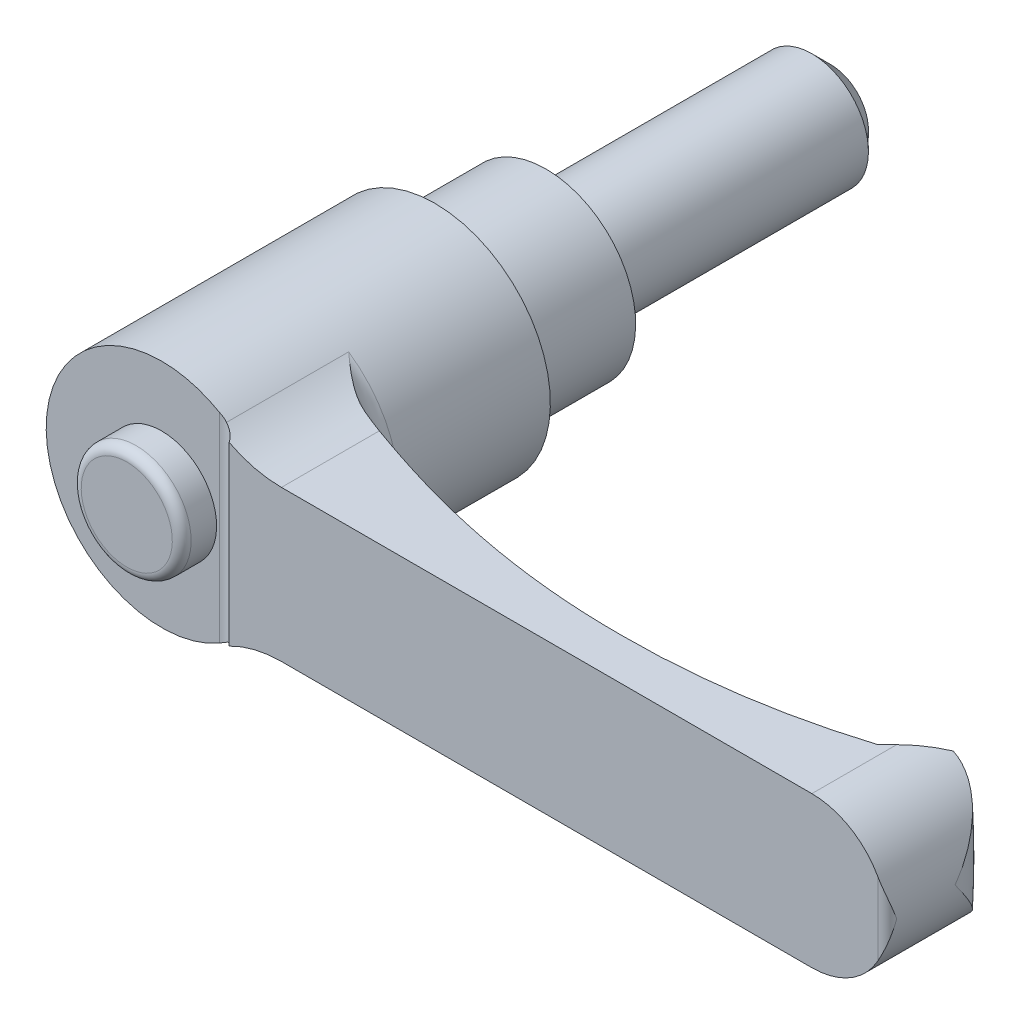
ISO-10303-21;
HEADER;
FILE_DESCRIPTION(('STEP AP214'),'2;1');
FILE_NAME('part.step','',(''),(''),'','','');
FILE_SCHEMA(('AUTOMOTIVE_DESIGN { 1 0 10303 214 1 1 1 1 }'));
ENDSEC;
DATA;
#1=APPLICATION_CONTEXT('core data for automotive mechanical design processes');
#2=APPLICATION_PROTOCOL_DEFINITION('international standard','automotive_design',2000,#1);
#3=PRODUCT_CONTEXT('',#1,'mechanical');
#4=PRODUCT('Part','Part','',(#3));
#5=PRODUCT_RELATED_PRODUCT_CATEGORY('part','',(#4));
#6=PRODUCT_DEFINITION_FORMATION('','',#4);
#7=PRODUCT_DEFINITION_CONTEXT('part definition',#1,'design');
#8=PRODUCT_DEFINITION('design','',#6,#7);
#9=PRODUCT_DEFINITION_SHAPE('','',#8);
#10=(LENGTH_UNIT() NAMED_UNIT(*) SI_UNIT(.MILLI.,.METRE.));
#11=(NAMED_UNIT(*) PLANE_ANGLE_UNIT() SI_UNIT($,.RADIAN.));
#12=(NAMED_UNIT(*) SI_UNIT($,.STERADIAN.) SOLID_ANGLE_UNIT());
#13=UNCERTAINTY_MEASURE_WITH_UNIT(LENGTH_MEASURE(1.E-05),#10,'distance_accuracy_value','');
#14=(GEOMETRIC_REPRESENTATION_CONTEXT(3) GLOBAL_UNCERTAINTY_ASSIGNED_CONTEXT((#13)) GLOBAL_UNIT_ASSIGNED_CONTEXT((#10,
#11,#12)) REPRESENTATION_CONTEXT('',''));
#15=CARTESIAN_POINT('',(0.,0.,0.));
#16=DIRECTION('',(0.,0.,1.));
#17=DIRECTION('',(1.,0.,0.));
#18=AXIS2_PLACEMENT_3D('',#15,#16,#17);
#19=CARTESIAN_POINT('',(7.6,0.,0.));
#20=DIRECTION('',(0.,0.,1.));
#21=DIRECTION('',(0.,-1.,0.));
#22=AXIS2_PLACEMENT_3D('',#19,#20,#21);
#23=PLANE('',#22);
#24=CARTESIAN_POINT('',(0.,0.,0.));
#25=DIRECTION('',(0.,0.,-1.));
#26=DIRECTION('',(0.,1.,0.));
#27=AXIS2_PLACEMENT_3D('',#24,#25,#26);
#28=CIRCLE('',#27,6.);
#29=CARTESIAN_POINT('',(0.,6.,0.));
#30=VERTEX_POINT('',#29);
#31=EDGE_CURVE('E422',#30,#30,#28,.T.);
#32=ORIENTED_EDGE('',*,*,#31,.F.);
#33=EDGE_LOOP('',(#32));
#34=FACE_BOUND('',#33,.T.);
#35=CARTESIAN_POINT('',(0.,0.,0.));
#36=DIRECTION('',(0.,0.,-1.));
#37=DIRECTION('',(0.,1.,0.));
#38=AXIS2_PLACEMENT_3D('',#35,#36,#37);
#39=CIRCLE('',#38,7.6);
#40=CARTESIAN_POINT('',(0.,7.6,0.));
#41=VERTEX_POINT('',#40);
#42=EDGE_CURVE('E347',#41,#41,#39,.T.);
#43=ORIENTED_EDGE('',*,*,#42,.T.);
#44=EDGE_LOOP('',(#43));
#45=FACE_BOUND('',#44,.T.);
#46=ADVANCED_FACE('F14',(#34,#45),#23,.F.);
#47=CARTESIAN_POINT('',(0.,0.,41.));
#48=DIRECTION('',(0.,0.,-1.));
#49=DIRECTION('',(0.,1.,0.));
#50=AXIS2_PLACEMENT_3D('',#47,#48,#49);
#51=PLANE('',#50);
#52=DIRECTION('',(0.,1.,0.));
#53=VECTOR('',#52,1.);
#54=CARTESIAN_POINT('',(6.125,-16.,41.));
#55=LINE('',#54,#53);
#56=CARTESIAN_POINT('',(6.125,-10.6088111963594,41.));
#57=VERTEX_POINT('',#56);
#58=CARTESIAN_POINT('',(6.125,10.6088111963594,41.));
#59=VERTEX_POINT('',#58);
#60=EDGE_CURVE('E385',#57,#59,#55,.T.);
#61=ORIENTED_EDGE('',*,*,#60,.T.);
#62=CARTESIAN_POINT('',(0.,0.,41.));
#63=DIRECTION('',(0.,0.,-1.));
#64=DIRECTION('',(0.,1.,0.));
#65=AXIS2_PLACEMENT_3D('',#62,#63,#64);
#66=CIRCLE('',#65,12.25);
#67=EDGE_CURVE('E332',#57,#59,#66,.T.);
#68=ORIENTED_EDGE('',*,*,#67,.F.);
#69=EDGE_LOOP('',(#61,#68));
#70=FACE_BOUND('',#69,.T.);
#71=CARTESIAN_POINT('',(0.,0.,41.));
#72=DIRECTION('',(0.,0.,-1.));
#73=DIRECTION('',(0.,1.,0.));
#74=AXIS2_PLACEMENT_3D('',#71,#72,#73);
#75=CIRCLE('',#74,5.83333333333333);
#76=CARTESIAN_POINT('',(0.,5.83333333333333,41.));
#77=VERTEX_POINT('',#76);
#78=EDGE_CURVE('E193',#77,#77,#75,.F.);
#79=ORIENTED_EDGE('',*,*,#78,.F.);
#80=EDGE_LOOP('',(#79));
#81=FACE_BOUND('',#80,.T.);
#82=ADVANCED_FACE('F163',(#70,#81),#51,.F.);
#83=CARTESIAN_POINT('',(70.,0.,0.));
#84=DIRECTION('',(0.,0.,1.));
#85=DIRECTION('',(0.,-1.,0.));
#86=AXIS2_PLACEMENT_3D('',#83,#84,#85);
#87=CYLINDRICAL_SURFACE('',#86,8.);
#88=CARTESIAN_POINT('',(78.,0.,34.8));
#89=CARTESIAN_POINT('',(78.0000000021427,-0.00507455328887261,34.7962762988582));
#90=CARTESIAN_POINT('',(77.9999951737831,-0.0101492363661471,34.7925524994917));
#91=CARTESIAN_POINT('',(77.9989416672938,-0.563628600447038,34.3864095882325));
#92=CARTESIAN_POINT('',(77.9414802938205,-1.11346566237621,33.9829298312));
#93=CARTESIAN_POINT('',(77.7692220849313,-1.92787753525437,33.38939297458));
#94=CARTESIAN_POINT('',(77.697249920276,-2.19810314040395,33.1931504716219));
#95=CARTESIAN_POINT('',(77.5237934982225,-2.73341157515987,32.8066637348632));
#96=CARTESIAN_POINT('',(77.4223242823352,-2.99849695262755,32.6164164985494));
#97=CARTESIAN_POINT('',(77.2199237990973,-3.45210642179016,32.2938177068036));
#98=CARTESIAN_POINT('',(77.1259458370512,-3.64233939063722,32.1594598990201));
#99=CARTESIAN_POINT('',(76.9211711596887,-4.01785016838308,31.8966888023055));
#100=CARTESIAN_POINT('',(76.8103745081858,-4.20312799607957,31.7682754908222));
#101=CARTESIAN_POINT('',(76.5717542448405,-4.56719869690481,31.5191542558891));
#102=CARTESIAN_POINT('',(76.4439640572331,-4.74600344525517,31.3984318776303));
#103=CARTESIAN_POINT('',(76.1708976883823,-5.09601175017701,31.1663364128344));
#104=CARTESIAN_POINT('',(76.0256268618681,-5.26721761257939,31.0549604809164));
#105=CARTESIAN_POINT('',(75.6441829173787,-5.67932922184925,30.7937387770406));
#106=CARTESIAN_POINT('',(75.3974573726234,-5.9150123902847,30.6505327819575));
#107=CARTESIAN_POINT('',(74.9987611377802,-6.24839682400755,30.4615945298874));
#108=CARTESIAN_POINT('',(74.8611020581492,-6.35616332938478,30.4029292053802));
#109=CARTESIAN_POINT('',(74.5764070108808,-6.56410843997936,30.2956150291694));
#110=CARTESIAN_POINT('',(74.429373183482,-6.66428876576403,30.2469639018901));
#111=CARTESIAN_POINT('',(74.1592544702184,-6.83522850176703,30.1705684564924));
#112=CARTESIAN_POINT('',(74.0378615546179,-6.90766708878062,30.1405781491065));
#113=CARTESIAN_POINT('',(73.7901015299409,-7.04665102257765,30.0886005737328));
#114=CARTESIAN_POINT('',(73.6637356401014,-7.11319780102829,30.0666113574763));
#115=CARTESIAN_POINT('',(73.4066843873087,-7.23982141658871,30.0315221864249));
#116=CARTESIAN_POINT('',(73.2760017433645,-7.2999022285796,30.0184167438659));
#117=CARTESIAN_POINT('',(73.0110423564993,-7.41312181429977,30.0019547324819));
#118=CARTESIAN_POINT('',(72.8767656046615,-7.46626057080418,29.9985981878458));
#119=CARTESIAN_POINT('',(72.6044130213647,-7.56559501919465,30.0024862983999));
#120=CARTESIAN_POINT('',(72.4663137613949,-7.6117232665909,30.009827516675));
#121=CARTESIAN_POINT('',(72.1887878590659,-7.69611880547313,30.0360283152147));
#122=CARTESIAN_POINT('',(72.0493611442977,-7.73438566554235,30.0548885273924));
#123=CARTESIAN_POINT('',(71.770740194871,-7.80288648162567,30.1046814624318));
#124=CARTESIAN_POINT('',(71.6315458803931,-7.83312431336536,30.1356083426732));
#125=CARTESIAN_POINT('',(71.3550409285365,-7.885663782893,30.2098119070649));
#126=CARTESIAN_POINT('',(71.217729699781,-7.90796796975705,30.2530846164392));
#127=CARTESIAN_POINT('',(70.8920238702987,-7.95241951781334,30.3719934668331));
#128=CARTESIAN_POINT('',(70.7052564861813,-7.97090772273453,30.4536477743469));
#129=CARTESIAN_POINT('',(70.433708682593,-7.98875485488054,30.5937624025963));
#130=CARTESIAN_POINT('',(70.3445710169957,-7.99305594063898,30.6434445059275));
#131=CARTESIAN_POINT('',(70.1696001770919,-7.99868029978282,30.7485120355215));
#132=CARTESIAN_POINT('',(70.0837676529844,-8.00000299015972,30.8038985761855));
#133=CARTESIAN_POINT('',(69.9998,-7.9999999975,30.8620428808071));
#134=B_SPLINE_CURVE_WITH_KNOTS('',3,(#88,#89,#90,#91,#92,#93,#94,#95,#96,#97,#98,#99,#100,#101,
#102,#103,#104,#105,#106,#107,#108,#109,#110,#111,#112,#113,#114,#115,#116,#117,#118,#119,#120,
#121,#122,#123,#124,#125,#126,#127,#128,#129,#130,#131,#132,#133),.UNSPECIFIED.,.F.,.F.,(4,2,2,
2,2,2,2,2,2,2,2,2,2,2,2,2,2,2,2,2,2,2,4),(0.,0.0188831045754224,2.05946970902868,
3.08347088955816,4.10695081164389,4.85978230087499,5.6126109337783,6.36398015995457,
7.11511980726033,8.22062566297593,8.77332293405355,9.32589447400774,9.75904172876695,
10.1920834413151,10.624857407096,11.0576324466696,11.4943381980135,11.9310679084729,
12.3675864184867,12.8039645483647,13.4155655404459,13.721767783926,14.0280299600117),.UNSPECIFIED.);
#135=CARTESIAN_POINT('',(72.9968893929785,-7.41745603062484,30.0031106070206));
#136=VERTEX_POINT('',#135);
#137=CARTESIAN_POINT('',(78.,0.,34.8));
#138=VERTEX_POINT('',#137);
#139=EDGE_CURVE('E126',#136,#138,#134,.F.);
#140=ORIENTED_EDGE('',*,*,#139,.T.);
#141=CARTESIAN_POINT('',(78.,0.,34.8));
#142=CARTESIAN_POINT('',(78.0000000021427,0.00507455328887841,34.7962762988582));
#143=CARTESIAN_POINT('',(77.9999951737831,0.0101492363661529,34.7925524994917));
#144=CARTESIAN_POINT('',(77.9989416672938,0.563628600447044,34.3864095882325));
#145=CARTESIAN_POINT('',(77.9414802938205,1.11346566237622,33.9829298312));
#146=CARTESIAN_POINT('',(77.7692220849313,1.92787753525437,33.38939297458));
#147=CARTESIAN_POINT('',(77.697249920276,2.19810314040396,33.1931504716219));
#148=CARTESIAN_POINT('',(77.5237934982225,2.73341157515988,32.8066637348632));
#149=CARTESIAN_POINT('',(77.4223242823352,2.99849695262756,32.6164164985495));
#150=CARTESIAN_POINT('',(77.2199237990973,3.45210642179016,32.2938177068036));
#151=CARTESIAN_POINT('',(77.1259458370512,3.64233939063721,32.1594598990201));
#152=CARTESIAN_POINT('',(76.9211711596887,4.01785016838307,31.8966888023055));
#153=CARTESIAN_POINT('',(76.8103745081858,4.20312799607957,31.7682754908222));
#154=CARTESIAN_POINT('',(76.5717542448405,4.56719869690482,31.5191542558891));
#155=CARTESIAN_POINT('',(76.4439640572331,4.74600344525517,31.3984318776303));
#156=CARTESIAN_POINT('',(76.1708976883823,5.09601175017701,31.1663364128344));
#157=CARTESIAN_POINT('',(76.0256268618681,5.26721761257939,31.0549604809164));
#158=CARTESIAN_POINT('',(75.6441829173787,5.67932922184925,30.7937387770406));
#159=CARTESIAN_POINT('',(75.3974573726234,5.91501239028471,30.6505327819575));
#160=CARTESIAN_POINT('',(74.9987611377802,6.24839682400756,30.4615945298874));
#161=CARTESIAN_POINT('',(74.8611020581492,6.35616332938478,30.4029292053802));
#162=CARTESIAN_POINT('',(74.5764070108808,6.56410843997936,30.2956150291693));
#163=CARTESIAN_POINT('',(74.429373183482,6.66428876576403,30.2469639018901));
#164=CARTESIAN_POINT('',(74.1592544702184,6.83522850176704,30.1705684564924));
#165=CARTESIAN_POINT('',(74.0378615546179,6.90766708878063,30.1405781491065));
#166=CARTESIAN_POINT('',(73.7901015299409,7.04665102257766,30.0886005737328));
#167=CARTESIAN_POINT('',(73.6637356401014,7.11319780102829,30.0666113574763));
#168=CARTESIAN_POINT('',(73.4066843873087,7.23982141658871,30.0315221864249));
#169=CARTESIAN_POINT('',(73.2760017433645,7.2999022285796,30.0184167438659));
#170=CARTESIAN_POINT('',(73.0110423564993,7.41312181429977,30.0019547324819));
#171=CARTESIAN_POINT('',(72.8767656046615,7.46626057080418,29.9985981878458));
#172=CARTESIAN_POINT('',(72.6044130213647,7.56559501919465,30.0024862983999));
#173=CARTESIAN_POINT('',(72.4663137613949,7.61172326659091,30.009827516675));
#174=CARTESIAN_POINT('',(72.1887878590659,7.69611880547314,30.0360283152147));
#175=CARTESIAN_POINT('',(72.0493611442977,7.73438566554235,30.0548885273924));
#176=CARTESIAN_POINT('',(71.770740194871,7.80288648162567,30.1046814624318));
#177=CARTESIAN_POINT('',(71.6315458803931,7.83312431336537,30.1356083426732));
#178=CARTESIAN_POINT('',(71.3550409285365,7.885663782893,30.2098119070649));
#179=CARTESIAN_POINT('',(71.217729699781,7.90796796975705,30.2530846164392));
#180=CARTESIAN_POINT('',(70.8920238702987,7.95241951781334,30.3719934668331));
#181=CARTESIAN_POINT('',(70.7052564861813,7.97090772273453,30.4536477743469));
#182=CARTESIAN_POINT('',(70.433708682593,7.98875485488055,30.5937624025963));
#183=CARTESIAN_POINT('',(70.3445710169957,7.99305594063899,30.6434445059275));
#184=CARTESIAN_POINT('',(70.1696001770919,7.99868029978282,30.7485120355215));
#185=CARTESIAN_POINT('',(70.0837676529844,8.00000299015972,30.8038985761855));
#186=CARTESIAN_POINT('',(69.9998,7.9999999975,30.8620428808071));
#187=B_SPLINE_CURVE_WITH_KNOTS('',3,(#141,#142,#143,#144,#145,#146,#147,#148,#149,#150,#151,
#152,#153,#154,#155,#156,#157,#158,#159,#160,#161,#162,#163,#164,#165,#166,#167,#168,#169,#170,
#171,#172,#173,#174,#175,#176,#177,#178,#179,#180,#181,#182,#183,#184,#185,#186),.UNSPECIFIED.,
.F.,.F.,(4,2,2,2,2,2,2,2,2,2,2,2,2,2,2,2,2,2,2,2,2,2,4),(0.,0.0188831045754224,2.05946970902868,
3.08347088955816,4.10695081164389,4.85978230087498,5.61261093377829,6.36398015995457,
7.11511980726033,8.22062566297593,8.77332293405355,9.32589447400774,9.75904172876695,
10.1920834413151,10.6248574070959,11.0576324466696,11.4943381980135,11.9310679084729,
12.3675864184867,12.8039645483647,13.4155655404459,13.721767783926,14.0280299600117),.UNSPECIFIED.);
#188=CARTESIAN_POINT('',(72.9968893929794,7.41745603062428,30.0031106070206));
#189=VERTEX_POINT('',#188);
#190=EDGE_CURVE('E123',#138,#189,#187,.T.);
#191=ORIENTED_EDGE('',*,*,#190,.T.);
#192=CARTESIAN_POINT('',(70.,0.,33.));
#193=DIRECTION('',(-0.707106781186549,0.,-0.707106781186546));
#194=DIRECTION('',(-0.707106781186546,0.,0.707106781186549));
#195=AXIS2_PLACEMENT_3D('',#192,#193,#194);
#196=ELLIPSE('',#195,11.3137084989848,8.);
#197=CARTESIAN_POINT('',(70.,8.,33.));
#198=VERTEX_POINT('',#197);
#199=EDGE_CURVE('E378',#189,#198,#196,.F.);
#200=ORIENTED_EDGE('',*,*,#199,.T.);
#201=DIRECTION('',(0.,0.,1.));
#202=VECTOR('',#201,1.);
#203=CARTESIAN_POINT('',(70.,8.,0.));
#204=LINE('',#203,#202);
#205=CARTESIAN_POINT('',(70.,8.,42.));
#206=VERTEX_POINT('',#205);
#207=EDGE_CURVE('E354',#198,#206,#204,.T.);
#208=ORIENTED_EDGE('',*,*,#207,.T.);
#209=CARTESIAN_POINT('',(70.,0.,42.));
#210=DIRECTION('',(0.,0.,1.));
#211=DIRECTION('',(0.,-1.,0.));
#212=AXIS2_PLACEMENT_3D('',#209,#210,#211);
#213=CIRCLE('',#212,8.);
#214=CARTESIAN_POINT('',(77.,3.87298334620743,42.));
#215=VERTEX_POINT('',#214);
#216=EDGE_CURVE('E327',#215,#206,#213,.T.);
#217=ORIENTED_EDGE('',*,*,#216,.F.);
#218=CARTESIAN_POINT('',(77.,3.87298334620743,42.));
#219=CARTESIAN_POINT('',(77.0320487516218,3.8150611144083,41.9999909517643));
#220=CARTESIAN_POINT('',(77.0633658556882,3.75675902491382,41.9984605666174));
#221=CARTESIAN_POINT('',(77.1244803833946,3.63952511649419,41.99269833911));
#222=CARTESIAN_POINT('',(77.1542784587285,3.58059358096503,41.9884676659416));
#223=CARTESIAN_POINT('',(77.241218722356,3.40324230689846,41.9722589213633));
#224=CARTESIAN_POINT('',(77.2960525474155,3.28400247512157,41.9567609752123));
#225=CARTESIAN_POINT('',(77.3991566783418,3.04456972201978,41.9185214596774));
#226=CARTESIAN_POINT('',(77.4474555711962,2.9243835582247,41.8958129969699));
#227=CARTESIAN_POINT('',(77.5378429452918,2.68282861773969,41.8446429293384));
#228=CARTESIAN_POINT('',(77.5799268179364,2.56145903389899,41.8161770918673));
#229=CARTESIAN_POINT('',(77.6827368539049,2.24038507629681,41.7351721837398));
#230=CARTESIAN_POINT('',(77.7382927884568,2.03996193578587,41.6788382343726));
#231=CARTESIAN_POINT('',(77.8332865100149,1.63779800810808,41.55814944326));
#232=CARTESIAN_POINT('',(77.8727175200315,1.43605670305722,41.4937912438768));
#233=CARTESIAN_POINT('',(77.967421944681,0.829293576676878,41.2932012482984));
#234=CARTESIAN_POINT('',(77.999127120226,0.42266785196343,41.1494356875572));
#235=CARTESIAN_POINT('',(77.9999940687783,0.0112434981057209,41.0039751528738));
#236=CARTESIAN_POINT('',(77.9999999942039,0.00562166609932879,41.0019875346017));
#237=CARTESIAN_POINT('',(78.,0.,41.));
#238=B_SPLINE_CURVE_WITH_KNOTS('',3,(#218,#219,#220,#221,#222,#223,#224,#225,#226,#227,#228,
#229,#230,#231,#232,#233,#234,#235,#236,#237),.UNSPECIFIED.,.F.,.F.,(4,2,2,2,2,2,2,2,2,4),(0.,
0.198535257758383,0.396984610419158,0.792983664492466,1.18719018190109,1.5816875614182,
2.22713013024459,2.8728436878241,4.16406208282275,4.18195063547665),.UNSPECIFIED.);
#239=CARTESIAN_POINT('',(78.,0.,41.));
#240=VERTEX_POINT('',#239);
#241=EDGE_CURVE('E179',#240,#215,#238,.F.);
#242=ORIENTED_EDGE('',*,*,#241,.F.);
#243=CARTESIAN_POINT('',(77.,-3.87298334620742,42.));
#244=CARTESIAN_POINT('',(77.0320487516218,-3.81506111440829,41.9999909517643));
#245=CARTESIAN_POINT('',(77.0633658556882,-3.75675902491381,41.9984605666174));
#246=CARTESIAN_POINT('',(77.1244803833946,-3.63952511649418,41.99269833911));
#247=CARTESIAN_POINT('',(77.1542784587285,-3.58059358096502,41.9884676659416));
#248=CARTESIAN_POINT('',(77.241218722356,-3.40324230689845,41.9722589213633));
#249=CARTESIAN_POINT('',(77.2960525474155,-3.28400247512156,41.9567609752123));
#250=CARTESIAN_POINT('',(77.3991566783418,-3.04456972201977,41.9185214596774));
#251=CARTESIAN_POINT('',(77.4474555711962,-2.92438355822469,41.8958129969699));
#252=CARTESIAN_POINT('',(77.5378429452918,-2.68282861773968,41.8446429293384));
#253=CARTESIAN_POINT('',(77.5799268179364,-2.56145903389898,41.8161770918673));
#254=CARTESIAN_POINT('',(77.6827368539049,-2.2403850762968,41.7351721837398));
#255=CARTESIAN_POINT('',(77.7382927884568,-2.03996193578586,41.6788382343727));
#256=CARTESIAN_POINT('',(77.8332865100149,-1.63779800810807,41.55814944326));
#257=CARTESIAN_POINT('',(77.8727175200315,-1.43605670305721,41.4937912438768));
#258=CARTESIAN_POINT('',(77.967421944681,-0.829293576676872,41.2932012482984));
#259=CARTESIAN_POINT('',(77.999127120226,-0.422667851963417,41.1494356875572));
#260=CARTESIAN_POINT('',(77.9999940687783,-0.0112434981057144,41.0039751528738));
#261=CARTESIAN_POINT('',(77.9999999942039,-0.00562166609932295,41.0019875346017));
#262=CARTESIAN_POINT('',(78.,0.,41.));
#263=B_SPLINE_CURVE_WITH_KNOTS('',3,(#243,#244,#245,#246,#247,#248,#249,#250,#251,#252,#253,
#254,#255,#256,#257,#258,#259,#260,#261,#262),.UNSPECIFIED.,.F.,.F.,(4,2,2,2,2,2,2,2,2,4),(0.,
0.19853525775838,0.396984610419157,0.792983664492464,1.18719018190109,1.5816875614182,
2.2271301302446,2.8728436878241,4.16406208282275,4.18195063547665),.UNSPECIFIED.);
#264=CARTESIAN_POINT('',(77.,-3.87298334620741,42.));
#265=VERTEX_POINT('',#264);
#266=EDGE_CURVE('E187',#265,#240,#263,.T.);
#267=ORIENTED_EDGE('',*,*,#266,.F.);
#268=CARTESIAN_POINT('',(70.,-8.,42.));
#269=VERTEX_POINT('',#268);
#270=EDGE_CURVE('E322',#269,#265,#213,.T.);
#271=ORIENTED_EDGE('',*,*,#270,.F.);
#272=DIRECTION('',(0.,0.,1.));
#273=VECTOR('',#272,1.);
#274=CARTESIAN_POINT('',(70.,-8.,0.));
#275=LINE('',#274,#273);
#276=CARTESIAN_POINT('',(70.,-8.,33.));
#277=VERTEX_POINT('',#276);
#278=EDGE_CURVE('E357',#277,#269,#275,.T.);
#279=ORIENTED_EDGE('',*,*,#278,.F.);
#280=EDGE_CURVE('E137',#277,#136,#196,.F.);
#281=ORIENTED_EDGE('',*,*,#280,.T.);
#282=EDGE_LOOP('',(#140,#191,#200,#208,#217,#242,#267,#271,#279,#281));
#283=FACE_BOUND('',#282,.T.);
#284=ADVANCED_FACE('F135',(#283),#87,.T.);
#285=CARTESIAN_POINT('',(73.,-16.,30.));
#286=DIRECTION('',(-0.707106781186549,0.,-0.707106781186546));
#287=DIRECTION('',(0.707106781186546,0.,-0.707106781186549));
#288=AXIS2_PLACEMENT_3D('',#285,#286,#287);
#289=PLANE('',#288);
#290=DIRECTION('',(0.,1.,0.));
#291=VECTOR('',#290,1.);
#292=CARTESIAN_POINT('',(73.,-16.,30.));
#293=LINE('',#292,#291);
#294=CARTESIAN_POINT('',(73.,-5.40740233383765,30.));
#295=VERTEX_POINT('',#294);
#296=CARTESIAN_POINT('',(73.,5.40740233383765,30.));
#297=VERTEX_POINT('',#296);
#298=EDGE_CURVE('E397',#295,#297,#293,.T.);
#299=ORIENTED_EDGE('',*,*,#298,.F.);
#300=CARTESIAN_POINT('',(72.9944134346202,8.0002,30.0055865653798));
#301=CARTESIAN_POINT('',(72.9964174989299,7.60019527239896,30.0035825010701));
#302=CARTESIAN_POINT('',(72.9977626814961,7.20018596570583,30.0022373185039));
#303=CARTESIAN_POINT('',(72.9994970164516,6.40016550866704,30.0005029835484));
#304=CARTESIAN_POINT('',(72.9998861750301,6.00015435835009,30.0001138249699));
#305=CARTESIAN_POINT('',(73.0000702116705,5.20013335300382,29.9999297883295));
#306=CARTESIAN_POINT('',(72.9998650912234,4.80012349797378,30.0001349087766));
#307=CARTESIAN_POINT('',(72.9991717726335,4.00010369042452,30.0008282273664));
#308=CARTESIAN_POINT('',(72.998683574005,3.60009373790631,30.001316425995));
#309=CARTESIAN_POINT('',(72.9972116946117,2.40006658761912,30.0027883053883));
#310=CARTESIAN_POINT('',(72.9962207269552,1.60004928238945,30.0037792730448));
#311=CARTESIAN_POINT('',(72.9954610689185,1.3601944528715E-05,30.0045389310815));
#312=CARTESIAN_POINT('',(72.9956923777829,-0.800004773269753,30.004307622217));
#313=CARTESIAN_POINT('',(72.9968584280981,-2.13336982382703,30.0031415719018));
#314=CARTESIAN_POINT('',(72.9975329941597,-2.66671710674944,30.0024670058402));
#315=CARTESIAN_POINT('',(72.9988528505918,-3.73341119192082,30.0011471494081));
#316=CARTESIAN_POINT('',(72.999498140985,-4.26675799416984,30.000501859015));
#317=CARTESIAN_POINT('',(73.000124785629,-5.33345534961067,29.999875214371));
#318=CARTESIAN_POINT('',(73.0001061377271,-5.86680590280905,29.9998938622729));
#319=CARTESIAN_POINT('',(72.9985813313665,-6.93350631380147,30.0014186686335));
#320=CARTESIAN_POINT('',(72.997075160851,-7.46685617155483,30.002924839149));
#321=CARTESIAN_POINT('',(72.9944134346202,-8.0002,30.0055865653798));
#322=B_SPLINE_CURVE_WITH_KNOTS('',3,(#300,#301,#302,#303,#304,#305,#306,#307,#308,#309,#310,
#311,#312,#313,#314,#315,#316,#317,#318,#319,#320,#321),.UNSPECIFIED.,.F.,.F.,(4,2,2,2,2,2,2,2,
2,2,4),(0.,1.20004037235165,2.40007297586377,3.60010256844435,4.80013422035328,7.20018907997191,
9.60024245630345,11.2002867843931,12.8003298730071,14.4003781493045,16.0004393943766),.UNSPECIFIED.);
#323=EDGE_CURVE('E138',#295,#136,#322,.T.);
#324=ORIENTED_EDGE('',*,*,#323,.T.);
#325=ORIENTED_EDGE('',*,*,#280,.F.);
#326=DIRECTION('',(-0.707106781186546,0.,0.707106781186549));
#327=VECTOR('',#326,1.);
#328=CARTESIAN_POINT('',(86.5,-8.,16.5));
#329=LINE('',#328,#327);
#330=CARTESIAN_POINT('',(69.,-8.,34.));
#331=VERTEX_POINT('',#330);
#332=EDGE_CURVE('E321',#277,#331,#329,.T.);
#333=ORIENTED_EDGE('',*,*,#332,.T.);
#334=DIRECTION('',(0.,1.,0.));
#335=VECTOR('',#334,1.);
#336=CARTESIAN_POINT('',(69.,-16.,34.));
#337=LINE('',#336,#335);
#338=CARTESIAN_POINT('',(69.,8.,34.));
#339=VERTEX_POINT('',#338);
#340=EDGE_CURVE('E319',#331,#339,#337,.T.);
#341=ORIENTED_EDGE('',*,*,#340,.T.);
#342=DIRECTION('',(0.707106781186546,0.,-0.707106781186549));
#343=VECTOR('',#342,1.);
#344=CARTESIAN_POINT('',(58.3567940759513,8.,44.6432059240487));
#345=LINE('',#344,#343);
#346=EDGE_CURVE('E375',#339,#198,#345,.T.);
#347=ORIENTED_EDGE('',*,*,#346,.T.);
#348=ORIENTED_EDGE('',*,*,#199,.F.);
#349=EDGE_CURVE('E129',#189,#297,#322,.T.);
#350=ORIENTED_EDGE('',*,*,#349,.T.);
#351=EDGE_LOOP('',(#299,#324,#325,#333,#341,#347,#348,#350));
#352=FACE_BOUND('',#351,.T.);
#353=ADVANCED_FACE('F162',(#352),#289,.T.);
#354=CARTESIAN_POINT('',(73.2,-16.,30.));
#355=DIRECTION('',(0.,0.,-1.));
#356=DIRECTION('',(0.,1.,0.));
#357=AXIS2_PLACEMENT_3D('',#354,#355,#356);
#358=PLANE('',#357);
#359=ORIENTED_EDGE('',*,*,#298,.T.);
#360=CARTESIAN_POINT('',(0.,0.,30.));
#361=DIRECTION('',(0.,0.,-1.));
#362=DIRECTION('',(0.,1.,0.));
#363=AXIS2_PLACEMENT_3D('',#360,#361,#362);
#364=CIRCLE('',#363,73.2);
#365=EDGE_CURVE('E36',#297,#295,#364,.T.);
#366=ORIENTED_EDGE('',*,*,#365,.T.);
#367=EDGE_LOOP('',(#359,#366));
#368=FACE_BOUND('',#367,.T.);
#369=ADVANCED_FACE('F201',(#368),#358,.T.);
#370=CARTESIAN_POINT('',(0.,0.,42.));
#371=DIRECTION('',(0.,0.,1.));
#372=DIRECTION('',(0.,-1.,0.));
#373=AXIS2_PLACEMENT_3D('',#370,#371,#372);
#374=PLANE('',#373);
#375=CARTESIAN_POINT('',(13.7135881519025,20.,42.));
#376=DIRECTION('',(0.,0.,1.));
#377=DIRECTION('',(1.,0.,0.));
#378=AXIS2_PLACEMENT_3D('',#375,#376,#377);
#379=CIRCLE('',#378,12.);
#380=CARTESIAN_POINT('',(8.16666666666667,9.35896330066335,42.));
#381=VERTEX_POINT('',#380);
#382=CARTESIAN_POINT('',(13.7135881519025,8.,42.));
#383=VERTEX_POINT('',#382);
#384=EDGE_CURVE('E372',#381,#383,#379,.T.);
#385=ORIENTED_EDGE('',*,*,#384,.F.);
#386=DIRECTION('',(0.,1.,0.));
#387=VECTOR('',#386,1.);
#388=CARTESIAN_POINT('',(8.16666666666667,-16.,42.));
#389=LINE('',#388,#387);
#390=CARTESIAN_POINT('',(8.16666666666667,-9.35896330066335,42.));
#391=VERTEX_POINT('',#390);
#392=EDGE_CURVE('E392',#391,#381,#389,.T.);
#393=ORIENTED_EDGE('',*,*,#392,.F.);
#394=CARTESIAN_POINT('',(13.7135881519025,-20.,42.));
#395=DIRECTION('',(0.,0.,1.));
#396=DIRECTION('',(1.,0.,0.));
#397=AXIS2_PLACEMENT_3D('',#394,#395,#396);
#398=CIRCLE('',#397,12.);
#399=CARTESIAN_POINT('',(13.7135881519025,-8.,42.));
#400=VERTEX_POINT('',#399);
#401=EDGE_CURVE('E363',#400,#391,#398,.T.);
#402=ORIENTED_EDGE('',*,*,#401,.F.);
#403=DIRECTION('',(-1.,0.,0.));
#404=VECTOR('',#403,1.);
#405=CARTESIAN_POINT('',(70.,-8.,42.));
#406=LINE('',#405,#404);
#407=EDGE_CURVE('E366',#269,#400,#406,.T.);
#408=ORIENTED_EDGE('',*,*,#407,.F.);
#409=ORIENTED_EDGE('',*,*,#270,.T.);
#410=DIRECTION('',(0.,1.,0.));
#411=VECTOR('',#410,1.);
#412=CARTESIAN_POINT('',(77.,-16.,42.));
#413=LINE('',#412,#411);
#414=EDGE_CURVE('E393',#265,#215,#413,.T.);
#415=ORIENTED_EDGE('',*,*,#414,.T.);
#416=ORIENTED_EDGE('',*,*,#216,.T.);
#417=DIRECTION('',(1.,0.,0.));
#418=VECTOR('',#417,1.);
#419=CARTESIAN_POINT('',(13.7135881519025,8.,42.));
#420=LINE('',#419,#418);
#421=EDGE_CURVE('E369',#383,#206,#420,.T.);
#422=ORIENTED_EDGE('',*,*,#421,.F.);
#423=EDGE_LOOP('',(#385,#393,#402,#408,#409,#415,#416,#422));
#424=FACE_BOUND('',#423,.T.);
#425=ADVANCED_FACE('F248',(#424),#374,.T.);
#426=CARTESIAN_POINT('',(0.,0.,0.));
#427=DIRECTION('',(0.,0.,-1.));
#428=DIRECTION('',(0.,1.,0.));
#429=AXIS2_PLACEMENT_3D('',#426,#427,#428);
#430=CYLINDRICAL_SURFACE('',#429,12.25);
#431=CARTESIAN_POINT('',(0.,0.,28.0779919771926));
#432=DIRECTION('',(0.,0.,-1.));
#433=DIRECTION('',(0.,1.,0.));
#434=AXIS2_PLACEMENT_3D('',#431,#432,#433);
#435=CIRCLE('',#434,12.25);
#436=CARTESIAN_POINT('',(6.92748267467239,10.1030927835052,28.0779919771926));
#437=VERTEX_POINT('',#436);
#438=CARTESIAN_POINT('',(6.92748267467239,-10.1030927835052,28.0779919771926));
#439=VERTEX_POINT('',#438);
#440=EDGE_CURVE('E412',#437,#439,#435,.T.);
#441=ORIENTED_EDGE('',*,*,#440,.T.);
#442=DIRECTION('',(0.,0.,1.));
#443=VECTOR('',#442,1.);
#444=CARTESIAN_POINT('',(6.92748267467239,-10.1030927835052,0.));
#445=LINE('',#444,#443);
#446=CARTESIAN_POINT('',(6.92748267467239,-10.1030927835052,41.0427567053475));
#447=VERTEX_POINT('',#446);
#448=EDGE_CURVE('E361',#439,#447,#445,.T.);
#449=ORIENTED_EDGE('',*,*,#448,.T.);
#450=CARTESIAN_POINT('',(6.125,-10.6088111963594,41.));
#451=CARTESIAN_POINT('',(6.19832883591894,-10.5664875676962,40.9889897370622));
#452=CARTESIAN_POINT('',(6.27164451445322,-10.523132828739,40.9821479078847));
#453=CARTESIAN_POINT('',(6.41753908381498,-10.4347921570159,40.9764986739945));
#454=CARTESIAN_POINT('',(6.49011843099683,-10.3898073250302,40.9776859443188));
#455=CARTESIAN_POINT('',(6.63402897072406,-10.2985167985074,40.9877856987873));
#456=CARTESIAN_POINT('',(6.70535828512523,-10.2522093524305,40.996708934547));
#457=CARTESIAN_POINT('',(6.84611057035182,-10.1587605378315,41.0220012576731));
#458=CARTESIAN_POINT('',(6.91553331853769,-10.1116190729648,41.0383712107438));
#459=CARTESIAN_POINT('',(7.10641045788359,-9.97916014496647,41.094233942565));
#460=CARTESIAN_POINT('',(7.22525798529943,-9.89334730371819,41.1417583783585));
#461=CARTESIAN_POINT('',(7.45241295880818,-9.72337963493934,41.2589427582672));
#462=CARTESIAN_POINT('',(7.56074253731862,-9.63922163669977,41.3285548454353));
#463=CARTESIAN_POINT('',(7.71168483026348,-9.51821587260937,41.4479066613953));
#464=CARTESIAN_POINT('',(7.75936397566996,-9.47936365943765,41.4893658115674));
#465=CARTESIAN_POINT('',(7.85125896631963,-9.40339173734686,41.5773725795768));
#466=CARTESIAN_POINT('',(7.89547657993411,-9.36627114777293,41.6239175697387));
#467=CARTESIAN_POINT('',(7.98020904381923,-9.29418452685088,41.7223463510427));
#468=CARTESIAN_POINT('',(8.02070494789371,-9.25922978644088,41.7742548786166));
#469=CARTESIAN_POINT('',(8.09722101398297,-9.19239515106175,41.8832605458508));
#470=CARTESIAN_POINT('',(8.13323329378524,-9.16052069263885,41.9403665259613));
#471=CARTESIAN_POINT('',(8.16666666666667,-9.13061090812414,42.));
#472=B_SPLINE_CURVE_WITH_KNOTS('',3,(#450,#451,#452,#453,#454,#455,#456,#457,#458,#459,#460,
#461,#462,#463,#464,#465,#466,#467,#468,#469,#470,#471),.UNSPECIFIED.,.F.,.F.,(4,2,2,2,2,2,2,2,
2,2,4),(0.,0.255975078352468,0.511780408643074,0.767941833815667,1.02413304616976,
1.48441304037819,1.94370248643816,2.16599787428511,2.38817894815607,2.61143478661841,
2.83507772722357),.UNSPECIFIED.);
#473=EDGE_CURVE('E222',#57,#447,#472,.T.);
#474=ORIENTED_EDGE('',*,*,#473,.F.);
#475=ORIENTED_EDGE('',*,*,#67,.T.);
#476=CARTESIAN_POINT('',(8.16666666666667,9.13061090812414,42.));
#477=CARTESIAN_POINT('',(8.13602850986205,9.15801692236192,41.9453523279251));
#478=CARTESIAN_POINT('',(8.10323346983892,9.18706943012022,41.8928397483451));
#479=CARTESIAN_POINT('',(8.03382107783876,9.24782874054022,41.7921703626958));
#480=CARTESIAN_POINT('',(7.99720910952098,9.27953179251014,41.7440075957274));
#481=CARTESIAN_POINT('',(7.88274220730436,9.37735907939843,41.6065497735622));
#482=CARTESIAN_POINT('',(7.79984772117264,9.44657197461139,41.5235775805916));
#483=CARTESIAN_POINT('',(7.62397737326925,9.58906879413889,41.3751924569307));
#484=CARTESIAN_POINT('',(7.53106018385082,9.66232791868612,41.3096843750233));
#485=CARTESIAN_POINT('',(7.33643153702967,9.81092784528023,41.1955319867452));
#486=CARTESIAN_POINT('',(7.23469620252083,9.88627389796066,41.1469353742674));
#487=CARTESIAN_POINT('',(7.00601089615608,10.0499435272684,41.0604339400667));
#488=CARTESIAN_POINT('',(6.87776073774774,10.1382349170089,41.0258797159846));
#489=CARTESIAN_POINT('',(6.61511692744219,10.3115145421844,40.9827504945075));
#490=CARTESIAN_POINT('',(6.48074133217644,10.3965112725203,40.9741035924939));
#491=CARTESIAN_POINT('',(6.30869788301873,10.5006996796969,40.9806991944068));
#492=CARTESIAN_POINT('',(6.27199131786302,10.5226640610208,40.9831161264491));
#493=CARTESIAN_POINT('',(6.19852568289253,10.5661055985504,40.9900077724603));
#494=CARTESIAN_POINT('',(6.16176668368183,10.5875831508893,40.9944807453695));
#495=CARTESIAN_POINT('',(6.125,10.6088111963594,41.));
#496=B_SPLINE_CURVE_WITH_KNOTS('',3,(#476,#477,#478,#479,#480,#481,#482,#483,#484,#485,#486,
#487,#488,#489,#490,#491,#492,#493,#494,#495),.UNSPECIFIED.,.F.,.F.,(4,2,2,2,2,2,2,2,2,4),(0.,
0.204930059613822,0.409574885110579,0.816210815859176,1.22058373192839,1.62608799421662,
2.10242753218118,2.57744378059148,2.7059409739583,2.83432955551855),.UNSPECIFIED.);
#497=CARTESIAN_POINT('',(6.92748267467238,10.1030927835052,41.0427567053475));
#498=VERTEX_POINT('',#497);
#499=EDGE_CURVE('E236',#498,#59,#496,.T.);
#500=ORIENTED_EDGE('',*,*,#499,.F.);
#501=DIRECTION('',(0.,0.,1.));
#502=VECTOR('',#501,1.);
#503=CARTESIAN_POINT('',(6.92748267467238,10.1030927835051,0.));
#504=LINE('',#503,#502);
#505=EDGE_CURVE('E350',#437,#498,#504,.T.);
#506=ORIENTED_EDGE('',*,*,#505,.F.);
#507=EDGE_LOOP('',(#441,#449,#474,#475,#500,#506));
#508=FACE_BOUND('',#507,.T.);
#509=CARTESIAN_POINT('',(0.,0.,12.));
#510=DIRECTION('',(0.,0.,-1.));
#511=DIRECTION('',(0.,1.,0.));
#512=AXIS2_PLACEMENT_3D('',#509,#510,#511);
#513=CIRCLE('',#512,12.25);
#514=CARTESIAN_POINT('',(0.,12.25,12.));
#515=VERTEX_POINT('',#514);
#516=EDGE_CURVE('E335',#515,#515,#513,.T.);
#517=ORIENTED_EDGE('',*,*,#516,.F.);
#518=EDGE_LOOP('',(#517));
#519=FACE_BOUND('',#518,.T.);
#520=ADVANCED_FACE('F246',(#508,#519),#430,.T.);
#521=CARTESIAN_POINT('',(13.7135881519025,20.,0.));
#522=DIRECTION('',(0.,0.,1.));
#523=DIRECTION('',(0.,-1.,0.));
#524=AXIS2_PLACEMENT_3D('',#521,#522,#523);
#525=CYLINDRICAL_SURFACE('',#524,12.);
#526=DIRECTION('',(0.,0.,1.));
#527=VECTOR('',#526,1.);
#528=CARTESIAN_POINT('',(13.7135881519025,8.,0.));
#529=LINE('',#528,#527);
#530=CARTESIAN_POINT('',(13.7135881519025,8.,31.611749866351));
#531=VERTEX_POINT('',#530);
#532=EDGE_CURVE('E352',#531,#383,#529,.T.);
#533=ORIENTED_EDGE('',*,*,#532,.F.);
#534=CARTESIAN_POINT('',(16.5591435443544,8.34226374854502,32.6591102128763));
#535=CARTESIAN_POINT('',(16.3261928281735,8.28540329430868,32.5722424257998));
#536=CARTESIAN_POINT('',(16.0917373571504,8.23557224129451,32.4848250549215));
#537=CARTESIAN_POINT('',(15.6204190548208,8.15004770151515,32.3095064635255));
#538=CARTESIAN_POINT('',(15.3835560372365,8.11435531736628,32.2216052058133));
#539=CARTESIAN_POINT('',(14.9085098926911,8.05724969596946,32.0461136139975));
#540=CARTESIAN_POINT('',(14.6703300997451,8.03580964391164,31.9585230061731));
#541=CARTESIAN_POINT('',(14.1928153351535,8.00718735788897,31.7842679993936));
#542=CARTESIAN_POINT('',(13.9534804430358,8.00000415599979,31.697603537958));
#543=CARTESIAN_POINT('',(13.3222890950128,7.99999321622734,31.4717100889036));
#544=CARTESIAN_POINT('',(12.9298365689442,8.01913869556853,31.3339527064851));
#545=CARTESIAN_POINT('',(12.1446747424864,8.09645283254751,31.0677464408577));
#546=CARTESIAN_POINT('',(11.7519664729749,8.15469870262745,30.9393165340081));
#547=CARTESIAN_POINT('',(11.0678445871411,8.29148603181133,30.7286186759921));
#548=CARTESIAN_POINT('',(10.7757440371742,8.36126529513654,30.6428547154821));
#549=CARTESIAN_POINT('',(10.1944299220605,8.52365043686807,30.4833757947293));
#550=CARTESIAN_POINT('',(9.90521727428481,8.61626334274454,30.4096645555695));
#551=CARTESIAN_POINT('',(9.33232622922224,8.82426158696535,30.2779606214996));
#552=CARTESIAN_POINT('',(9.04863462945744,8.93958259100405,30.219924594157));
#553=CARTESIAN_POINT('',(8.48843633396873,9.19295718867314,30.1227055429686));
#554=CARTESIAN_POINT('',(8.21192433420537,9.33099341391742,30.0835082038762));
#555=CARTESIAN_POINT('',(7.70530850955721,9.60902203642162,30.0304308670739));
#556=CARTESIAN_POINT('',(7.47397220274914,9.74624410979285,30.0138509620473));
#557=CARTESIAN_POINT('',(7.13386740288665,9.96379307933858,30.0017184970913));
#558=CARTESIAN_POINT('',(7.0215618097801,10.0383265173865,29.9998008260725));
#559=CARTESIAN_POINT('',(6.79949902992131,10.1911494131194,30.0002323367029));
#560=CARTESIAN_POINT('',(6.68974254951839,10.2694398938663,30.0025826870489));
#561=CARTESIAN_POINT('',(6.5813815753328,10.3495269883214,30.007070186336));
#562=B_SPLINE_CURVE_WITH_KNOTS('',3,(#534,#535,#536,#537,#538,#539,#540,#541,#542,#543,#544,
#545,#546,#547,#548,#549,#550,#551,#552,#553,#554,#555,#556,#557,#558,#559,#560,#561),
.UNSPECIFIED.,.F.,.F.,(4,2,2,2,2,2,2,2,2,2,2,2,2,4),(0.,0.765007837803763,1.53007532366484,
2.29369928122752,3.05727139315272,4.30444442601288,5.55408755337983,6.49010923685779,
7.42641935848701,8.36011402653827,9.29309806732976,10.100354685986,10.5046318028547,
10.9090196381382),.UNSPECIFIED.);
#563=CARTESIAN_POINT('',(11.361472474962,8.23277637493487,30.8190510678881));
#564=VERTEX_POINT('',#563);
#565=EDGE_CURVE('E262',#531,#564,#562,.T.);
#566=ORIENTED_EDGE('',*,*,#565,.T.);
#567=CARTESIAN_POINT('',(14.1569924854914,8.00819477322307,30.9010555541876));
#568=CARTESIAN_POINT('',(14.0595029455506,8.00457612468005,30.9322196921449));
#569=CARTESIAN_POINT('',(13.9606253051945,8.00212380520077,30.9590151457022));
#570=CARTESIAN_POINT('',(13.7610637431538,7.99968329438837,31.004218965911));
#571=CARTESIAN_POINT('',(13.6603822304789,7.99969203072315,31.0226377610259));
#572=CARTESIAN_POINT('',(13.4585847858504,8.00228706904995,31.0514218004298));
#573=CARTESIAN_POINT('',(13.3574757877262,8.00485682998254,31.061837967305));
#574=CARTESIAN_POINT('',(13.1548462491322,8.01258614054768,31.0753001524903));
#575=CARTESIAN_POINT('',(13.053325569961,8.01774665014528,31.0783434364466));
#576=CARTESIAN_POINT('',(12.8251352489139,8.0322613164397,31.0774805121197));
#577=CARTESIAN_POINT('',(12.6985166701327,8.04234092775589,31.07164895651));
#578=CARTESIAN_POINT('',(12.446446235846,8.06641586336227,31.0503579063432));
#579=CARTESIAN_POINT('',(12.3209952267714,8.08041382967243,31.0348919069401));
#580=CARTESIAN_POINT('',(11.9473264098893,8.12804907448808,30.9756133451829));
#581=CARTESIAN_POINT('',(11.7017310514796,8.16733172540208,30.9189189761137));
#582=CARTESIAN_POINT('',(11.4284283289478,8.21954129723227,30.8393902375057));
#583=CARTESIAN_POINT('',(11.3952261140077,8.22603104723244,30.829444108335));
#584=CARTESIAN_POINT('',(11.1613640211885,8.27276596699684,30.7574361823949));
#585=CARTESIAN_POINT('',(10.9642103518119,8.31751135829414,30.6865405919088));
#586=CARTESIAN_POINT('',(10.5777285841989,8.41525886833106,30.5303701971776));
#587=CARTESIAN_POINT('',(10.3884095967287,8.46827027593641,30.4450792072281));
#588=CARTESIAN_POINT('',(10.0168146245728,8.5819543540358,30.262829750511));
#589=CARTESIAN_POINT('',(9.83457244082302,8.64265900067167,30.1658226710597));
#590=CARTESIAN_POINT('',(9.47767438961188,8.77088665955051,29.9630240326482));
#591=CARTESIAN_POINT('',(9.30301613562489,8.83840750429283,29.8572352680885));
#592=CARTESIAN_POINT('',(8.93248691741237,8.99147577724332,29.6209801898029));
#593=CARTESIAN_POINT('',(8.73785326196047,9.07816138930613,29.4893172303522));
#594=CARTESIAN_POINT('',(8.35703282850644,9.25980318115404,29.2196101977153));
#595=CARTESIAN_POINT('',(8.17084790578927,9.35476116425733,29.0815647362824));
#596=CARTESIAN_POINT('',(7.80639286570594,9.55261034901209,28.801722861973));
#597=CARTESIAN_POINT('',(7.62810747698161,9.65548508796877,28.6599346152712));
#598=CARTESIAN_POINT('',(7.27822148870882,9.8694475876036,28.3744148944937));
#599=CARTESIAN_POINT('',(7.10661929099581,9.98053336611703,28.2306838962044));
#600=CARTESIAN_POINT('',(6.93448645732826,10.0982931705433,28.0839649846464));
#601=CARTESIAN_POINT('',(6.93098392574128,10.1006920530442,28.0809784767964));
#602=CARTESIAN_POINT('',(6.92748267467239,10.1030927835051,28.0779919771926));
#603=B_SPLINE_CURVE_WITH_KNOTS('',3,(#567,#568,#569,#570,#571,#572,#573,#574,#575,#576,#577,
#578,#579,#580,#581,#582,#583,#584,#585,#586,#587,#588,#589,#590,#591,#592,#593,#594,#595,#596,
#597,#598,#599,#600,#601,#602),.UNSPECIFIED.,.F.,.F.,(4,2,2,2,2,2,2,2,2,2,2,2,2,2,2,2,2,4),(0.,
0.307060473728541,0.613737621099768,0.918446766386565,1.2232689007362,1.60421628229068,
1.98542114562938,2.74764704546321,2.85344139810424,3.49502286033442,4.13733056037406,
4.78240133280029,5.42726761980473,6.17822336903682,6.9293432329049,7.67894130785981,
8.42835901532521,8.44393060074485),.UNSPECIFIED.);
#604=EDGE_CURVE('E253',#564,#437,#603,.T.);
#605=ORIENTED_EDGE('',*,*,#604,.T.);
#606=ORIENTED_EDGE('',*,*,#505,.T.);
#607=CARTESIAN_POINT('',(8.16666666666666,9.35896330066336,42.));
#608=CARTESIAN_POINT('',(8.13901649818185,9.37337657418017,41.9506476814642));
#609=CARTESIAN_POINT('',(8.10940958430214,9.3889470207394,41.9027481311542));
#610=CARTESIAN_POINT('',(8.04670483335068,9.42230209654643,41.8101553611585));
#611=CARTESIAN_POINT('',(8.01360925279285,9.44008529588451,41.7654600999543));
#612=CARTESIAN_POINT('',(7.9445192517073,9.47767235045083,41.679768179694));
#613=CARTESIAN_POINT('',(7.90854324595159,9.49746355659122,41.6387511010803));
#614=CARTESIAN_POINT('',(7.83394241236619,9.53904426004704,41.5603078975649));
#615=CARTESIAN_POINT('',(7.79531727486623,9.56083399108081,41.522882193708));
#616=CARTESIAN_POINT('',(7.67627287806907,9.628928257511,41.4163832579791));
#617=CARTESIAN_POINT('',(7.59246475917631,9.67807605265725,41.3528199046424));
#618=CARTESIAN_POINT('',(7.41892619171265,9.78297864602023,41.2409217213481));
#619=CARTESIAN_POINT('',(7.32918731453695,9.83874294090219,41.1926091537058));
#620=CARTESIAN_POINT('',(7.1868076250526,9.93000297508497,41.1289842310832));
#621=CARTESIAN_POINT('',(7.13520490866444,9.96362930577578,41.1085023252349));
#622=CARTESIAN_POINT('',(7.03159838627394,10.0323084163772,41.072203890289));
#623=CARTESIAN_POINT('',(6.97959668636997,10.0673556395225,41.0563708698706));
#624=CARTESIAN_POINT('',(6.92748267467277,10.1030927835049,41.0427567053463));
#625=B_SPLINE_CURVE_WITH_KNOTS('',3,(#607,#608,#609,#610,#611,#612,#613,#614,#615,#616,#617,
#618,#619,#620,#621,#622,#623,#624),.UNSPECIFIED.,.F.,.F.,(4,2,2,2,2,2,2,2,4),(0.,
0.17504734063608,0.349982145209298,0.52387635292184,0.697790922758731,1.04453417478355,
1.39178126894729,1.58634089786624,1.78020177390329),.UNSPECIFIED.);
#626=EDGE_CURVE('E230',#381,#498,#625,.T.);
#627=ORIENTED_EDGE('',*,*,#626,.F.);
#628=ORIENTED_EDGE('',*,*,#384,.T.);
#629=EDGE_LOOP('',(#533,#566,#605,#606,#627,#628));
#630=FACE_BOUND('',#629,.T.);
#631=ADVANCED_FACE('F242',(#630),#525,.F.);
#632=CARTESIAN_POINT('',(13.7135881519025,8.,0.));
#633=DIRECTION('',(0.,-1.,0.));
#634=DIRECTION('',(1.,0.,0.));
#635=AXIS2_PLACEMENT_3D('',#632,#633,#634);
#636=PLANE('',#635);
#637=CARTESIAN_POINT('',(45.7315011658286,8.,-40.4484852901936));
#638=DIRECTION('',(0.,-1.,0.));
#639=DIRECTION('',(1.,0.,0.));
#640=AXIS2_PLACEMENT_3D('',#637,#638,#639);
#641=CIRCLE('',#640,78.);
#642=CARTESIAN_POINT('',(45.3816329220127,8.00000000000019,37.5507300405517));
#643=VERTEX_POINT('',#642);
#644=EDGE_CURVE('E379',#643,#339,#641,.F.);
#645=ORIENTED_EDGE('',*,*,#644,.F.);
#646=CARTESIAN_POINT('',(41.2013215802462,8.,37.4608030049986));
#647=CARTESIAN_POINT('',(39.9809181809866,8.,37.4029725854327));
#648=CARTESIAN_POINT('',(38.761796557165,8.,37.3175877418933));
#649=CARTESIAN_POINT('',(36.3285638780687,8.,37.0925358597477));
#650=CARTESIAN_POINT('',(35.1144529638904,8.,36.9528673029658));
#651=CARTESIAN_POINT('',(32.6938673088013,8.,36.620494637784));
#652=CARTESIAN_POINT('',(31.4873906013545,8.,36.4278048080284));
#653=CARTESIAN_POINT('',(29.0837615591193,8.,35.9910366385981));
#654=CARTESIAN_POINT('',(27.8866092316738,8.,35.7469582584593));
#655=CARTESIAN_POINT('',(26.0963309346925,8.,35.3434938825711));
#656=CARTESIAN_POINT('',(25.4990195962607,8.,35.2023884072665));
#657=CARTESIAN_POINT('',(24.307345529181,8.,34.9082411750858));
#658=CARTESIAN_POINT('',(23.7129827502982,8.,34.7551996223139));
#659=CARTESIAN_POINT('',(22.5273511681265,8.,34.4376835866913));
#660=CARTESIAN_POINT('',(21.9360822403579,8.,34.2732095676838));
#661=CARTESIAN_POINT('',(20.7566633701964,8.,33.9334464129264));
#662=CARTESIAN_POINT('',(20.168513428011,8.,33.7581572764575));
#663=CARTESIAN_POINT('',(18.9953081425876,8.,33.3975573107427));
#664=CARTESIAN_POINT('',(18.410252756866,8.,33.2122466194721));
#665=CARTESIAN_POINT('',(17.2430689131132,8.,32.8326229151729));
#666=CARTESIAN_POINT('',(16.6609404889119,8.,32.6383097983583));
#667=CARTESIAN_POINT('',(15.4992827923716,8.,32.2420388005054));
#668=CARTESIAN_POINT('',(14.9197535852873,8.,32.0400807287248));
#669=CARTESIAN_POINT('',(13.7627551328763,8.,31.6303639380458));
#670=CARTESIAN_POINT('',(13.1852858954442,8.,31.4226051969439));
#671=CARTESIAN_POINT('',(12.2105601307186,8.,31.068884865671));
#672=CARTESIAN_POINT('',(11.8129994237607,8.,30.9237570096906));
#673=CARTESIAN_POINT('',(11.01801083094,8.,30.6331667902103));
#674=CARTESIAN_POINT('',(10.6205829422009,8.,30.4877044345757));
#675=CARTESIAN_POINT('',(9.82504247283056,8.,30.1978593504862));
#676=CARTESIAN_POINT('',(9.42692961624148,8.,30.0534773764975));
#677=CARTESIAN_POINT('',(8.62956030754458,8.,29.7678970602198));
#678=CARTESIAN_POINT('',(8.23030386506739,8.,29.6266986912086));
#679=CARTESIAN_POINT('',(7.434658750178,8.,29.3518607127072));
#680=CARTESIAN_POINT('',(7.03829494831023,8.,29.2181496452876));
#681=CARTESIAN_POINT('',(6.24250909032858,8.,28.9598804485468));
#682=CARTESIAN_POINT('',(5.84308667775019,8.,28.8353234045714));
#683=CARTESIAN_POINT('',(5.04058284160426,8.,28.6000350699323));
#684=CARTESIAN_POINT('',(4.63750557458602,8.,28.4892897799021));
#685=CARTESIAN_POINT('',(3.82651409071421,8.,28.287230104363));
#686=CARTESIAN_POINT('',(3.41860155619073,8.,28.1959091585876));
#687=CARTESIAN_POINT('',(2.77898962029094,8.,28.0738229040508));
#688=CARTESIAN_POINT('',(2.54899380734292,8.,28.0341217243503));
#689=CARTESIAN_POINT('',(2.08758367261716,8.,27.9639460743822));
#690=CARTESIAN_POINT('',(1.85616936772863,8.,27.9334714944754));
#691=CARTESIAN_POINT('',(1.39234110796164,8.,27.8827533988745));
#692=CARTESIAN_POINT('',(1.15992777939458,8.,27.8625042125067));
#693=CARTESIAN_POINT('',(0.694402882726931,8.,27.832938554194));
#694=CARTESIAN_POINT('',(0.461291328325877,8.,27.8236218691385));
#695=CARTESIAN_POINT('',(-0.00577358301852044,8.,27.81626587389));
#696=CARTESIAN_POINT('',(-0.239727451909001,8.,27.8182586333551));
#697=CARTESIAN_POINT('',(-0.707274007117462,8.,27.8335186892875));
#698=CARTESIAN_POINT('',(-0.940866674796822,8.,27.8467865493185));
#699=CARTESIAN_POINT('',(-1.40721975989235,8.,27.8841006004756));
#700=CARTESIAN_POINT('',(-1.63998003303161,8.,27.9081485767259));
#701=CARTESIAN_POINT('',(-2.10419851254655,8.,27.9661729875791));
#702=CARTESIAN_POINT('',(-2.33565694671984,8.,28.0001476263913));
#703=CARTESIAN_POINT('',(-2.97420169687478,8.,28.1064680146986));
#704=CARTESIAN_POINT('',(-3.37972262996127,8.,28.1882492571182));
#705=CARTESIAN_POINT('',(-4.18592396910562,8.,28.3731628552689));
#706=CARTESIAN_POINT('',(-4.58660185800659,8.,28.4763058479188));
#707=CARTESIAN_POINT('',(-5.38438882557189,8.,28.6981904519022));
#708=CARTESIAN_POINT('',(-5.78148949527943,8.,28.8169618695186));
#709=CARTESIAN_POINT('',(-6.57226220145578,8.,29.0650744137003));
#710=CARTESIAN_POINT('',(-6.96593476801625,8.,29.1944138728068));
#711=CARTESIAN_POINT('',(-7.75322419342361,8.,29.4607078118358));
#712=CARTESIAN_POINT('',(-8.14682745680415,8.,29.597702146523));
#713=CARTESIAN_POINT('',(-8.93259934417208,8.,29.8757469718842));
#714=CARTESIAN_POINT('',(-9.32476793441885,8.,30.0167975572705));
#715=CARTESIAN_POINT('',(-10.108000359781,8.,30.300645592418));
#716=CARTESIAN_POINT('',(-10.4990649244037,8.,30.4434410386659));
#717=CARTESIAN_POINT('',(-11.2810912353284,8.,30.7292982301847));
#718=CARTESIAN_POINT('',(-11.6720529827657,8.,30.8723599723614));
#719=CARTESIAN_POINT('',(-12.4604268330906,8.,31.1597298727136));
#720=CARTESIAN_POINT('',(-12.857844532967,8.,31.3040227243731));
#721=CARTESIAN_POINT('',(-13.6534067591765,8.,31.5905970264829));
#722=CARTESIAN_POINT('',(-14.051551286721,8.,31.7328784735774));
#723=CARTESIAN_POINT('',(-14.8489307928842,8.,32.0146765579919));
#724=CARTESIAN_POINT('',(-15.2481660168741,8.,32.1541925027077));
#725=CARTESIAN_POINT('',(-16.0478157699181,8.,32.4298018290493));
#726=CARTESIAN_POINT('',(-16.4482302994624,8.,32.5658952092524));
#727=CARTESIAN_POINT('',(-17.6492782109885,8.,32.967534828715));
#728=CARTESIAN_POINT('',(-18.4518884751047,8.,33.2272148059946));
#729=CARTESIAN_POINT('',(-20.062907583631,8.,33.7279015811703));
#730=CARTESIAN_POINT('',(-20.871316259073,8.,33.9689089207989));
#731=CARTESIAN_POINT('',(-22.2651511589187,8.,34.3651668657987));
#732=CARTESIAN_POINT('',(-22.8491532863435,8.,34.5254312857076));
#733=CARTESIAN_POINT('',(-24.0201231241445,8.,34.8347340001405));
#734=CARTESIAN_POINT('',(-24.6070908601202,8.,34.9837721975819));
#735=CARTESIAN_POINT('',(-26.3723282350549,8.,35.4133385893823));
#736=CARTESIAN_POINT('',(-27.5549313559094,8.,35.6763183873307));
#737=CARTESIAN_POINT('',(-29.9310593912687,8.,36.1528528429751));
#738=CARTESIAN_POINT('',(-31.1245924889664,8.,36.3663666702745));
#739=CARTESIAN_POINT('',(-33.5197648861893,8.,36.7417992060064));
#740=CARTESIAN_POINT('',(-34.7214041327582,8.,36.9037182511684));
#741=CARTESIAN_POINT('',(-37.1345480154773,8.,37.1750363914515));
#742=CARTESIAN_POINT('',(-38.3460719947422,8.,37.2842637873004));
#743=CARTESIAN_POINT('',(-40.7728077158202,8.,37.4484491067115));
#744=CARTESIAN_POINT('',(-41.9880194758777,8.,37.5034067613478));
#745=CARTESIAN_POINT('',(-44.4195958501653,8.,37.558389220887));
#746=CARTESIAN_POINT('',(-45.6359603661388,8.,37.5584183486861));
#747=CARTESIAN_POINT('',(-48.0674333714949,8.,37.5031457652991));
#748=CARTESIAN_POINT('',(-49.2825418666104,8.,37.4478443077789));
#749=CARTESIAN_POINT('',(-51.6852618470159,8.,37.283339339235));
#750=CARTESIAN_POINT('',(-52.8729469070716,8.,37.1752095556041));
#751=CARTESIAN_POINT('',(-55.2423682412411,8.,36.9055520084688));
#752=CARTESIAN_POINT('',(-56.4241038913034,8.,36.7440187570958));
#753=CARTESIAN_POINT('',(-58.7789436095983,8.,36.3677286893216));
#754=CARTESIAN_POINT('',(-59.9520485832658,8.,36.152977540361));
#755=CARTESIAN_POINT('',(-62.2874481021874,8.,35.670516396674));
#756=CARTESIAN_POINT('',(-63.4497415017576,8.,35.4028008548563));
#757=CARTESIAN_POINT('',(-65.7567345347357,8.,34.8159414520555));
#758=CARTESIAN_POINT('',(-66.9014830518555,8.,34.4969897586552));
#759=CARTESIAN_POINT('',(-69.1753518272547,8.,33.8075267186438));
#760=CARTESIAN_POINT('',(-70.3044720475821,8.,33.4370152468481));
#761=CARTESIAN_POINT('',(-72.544681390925,8.,32.6451401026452));
#762=CARTESIAN_POINT('',(-73.6557712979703,8.,32.2237786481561));
#763=CARTESIAN_POINT('',(-75.857653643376,8.,31.3309987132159));
#764=CARTESIAN_POINT('',(-76.9484462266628,8.,30.85958059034));
#765=CARTESIAN_POINT('',(-79.034727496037,8.,29.9010302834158));
#766=CARTESIAN_POINT('',(-80.0316867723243,8.,29.4170952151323));
#767=CARTESIAN_POINT('',(-82.0042428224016,8.,28.4072861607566));
#768=CARTESIAN_POINT('',(-82.9798378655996,8.,27.8814087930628));
#769=CARTESIAN_POINT('',(-84.9076630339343,8.,26.7887492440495));
#770=CARTESIAN_POINT('',(-85.8598964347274,8.,26.2219728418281));
#771=CARTESIAN_POINT('',(-87.7394957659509,8.,25.0483937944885));
#772=CARTESIAN_POINT('',(-88.6668593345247,8.,24.4415873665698));
#773=CARTESIAN_POINT('',(-90.4960328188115,8.,23.1883197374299));
#774=CARTESIAN_POINT('',(-91.3978106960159,8.,22.5418117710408));
#775=CARTESIAN_POINT('',(-93.1730809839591,8.,21.2108978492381));
#776=CARTESIAN_POINT('',(-94.0465706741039,8.,20.5264882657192));
#777=CARTESIAN_POINT('',(-95.7635177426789,8.,19.1210970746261));
#778=CARTESIAN_POINT('',(-96.6069776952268,8.,18.4001186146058));
#779=CARTESIAN_POINT('',(-98.2624140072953,8.,16.922839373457));
#780=CARTESIAN_POINT('',(-99.0743874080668,8.,16.1665352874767));
#781=CARTESIAN_POINT('',(-101.445256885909,8.,13.8617444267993));
#782=CARTESIAN_POINT('',(-102.956221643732,8.,12.2633517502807));
#783=CARTESIAN_POINT('',(-105.837524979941,8.,8.94488909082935));
#784=CARTESIAN_POINT('',(-107.20786508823,8.,7.22482043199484));
#785=CARTESIAN_POINT('',(-109.797743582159,8.,3.67584521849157));
#786=CARTESIAN_POINT('',(-111.017354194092,8.,1.84699141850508));
#787=CARTESIAN_POINT('',(-113.297700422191,8.,-1.90719990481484));
#788=CARTESIAN_POINT('',(-114.358435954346,8.,-3.83253747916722));
#789=CARTESIAN_POINT('',(-116.311018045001,8.,-7.76112230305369));
#790=CARTESIAN_POINT('',(-117.203273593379,8.,-9.76416627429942));
#791=CARTESIAN_POINT('',(-118.815729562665,8.,-13.8383453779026));
#792=CARTESIAN_POINT('',(-119.53593033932,8.,-15.9094803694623));
#793=CARTESIAN_POINT('',(-120.79920531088,8.,-20.1053701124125));
#794=CARTESIAN_POINT('',(-121.342256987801,8.,-22.2301316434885));
#795=CARTESIAN_POINT('',(-122.247220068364,8.,-26.5178865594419));
#796=CARTESIAN_POINT('',(-122.609131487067,8.,-28.6808799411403));
#797=CARTESIAN_POINT('',(-123.148944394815,8.,-33.0274417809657));
#798=CARTESIAN_POINT('',(-123.327035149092,8.,-35.210986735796));
#799=CARTESIAN_POINT('',(-123.498591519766,8.,-39.585316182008));
#800=CARTESIAN_POINT('',(-123.492057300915,8.,-41.7761006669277));
#801=CARTESIAN_POINT('',(-123.294410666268,8.,-46.1493274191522));
#802=CARTESIAN_POINT('',(-123.103298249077,8.,-48.3317696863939));
#803=CARTESIAN_POINT('',(-122.537860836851,8.,-52.6727901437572));
#804=CARTESIAN_POINT('',(-122.163535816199,8.,-54.8313683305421));
#805=CARTESIAN_POINT('',(-121.234422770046,8.,-59.1089663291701));
#806=CARTESIAN_POINT('',(-120.679663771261,8.,-61.227992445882));
#807=CARTESIAN_POINT('',(-119.393628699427,8.,-65.4117847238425));
#808=CARTESIAN_POINT('',(-118.662352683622,8.,-67.4765509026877));
#809=CARTESIAN_POINT('',(-117.028617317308,8.,-71.5368832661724));
#810=CARTESIAN_POINT('',(-116.126181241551,8.,-73.5324588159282));
#811=CARTESIAN_POINT('',(-114.156503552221,8.,-77.4405467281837));
#812=CARTESIAN_POINT('',(-113.089261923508,8.,-79.3530590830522));
#813=CARTESIAN_POINT('',(-110.797386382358,8.,-83.0817975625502));
#814=CARTESIAN_POINT('',(-109.572724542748,8.,-84.8980065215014));
#815=CARTESIAN_POINT('',(-106.974898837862,8.,-88.4209142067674));
#816=CARTESIAN_POINT('',(-105.601734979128,8.,-90.1276129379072));
#817=CARTESIAN_POINT('',(-102.716043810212,8.,-93.4201933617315));
#818=CARTESIAN_POINT('',(-101.203453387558,8.,-95.0060197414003));
#819=CARTESIAN_POINT('',(-98.0502415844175,8.,-98.0448134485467));
#820=CARTESIAN_POINT('',(-96.4096199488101,8.,-99.4977805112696));
#821=CARTESIAN_POINT('',(-93.0094106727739,8.,-102.262787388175));
#822=CARTESIAN_POINT('',(-91.2496439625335,8.,-103.574607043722));
#823=CARTESIAN_POINT('',(-87.6260782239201,8.,-106.045531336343));
#824=CARTESIAN_POINT('',(-85.7622793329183,8.,-107.204636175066));
#825=CARTESIAN_POINT('',(-81.9459395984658,8.,-109.360920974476));
#826=CARTESIAN_POINT('',(-79.9935099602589,8.,-110.358297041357));
#827=CARTESIAN_POINT('',(-77.0078484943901,8.,-111.728844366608));
#828=CARTESIAN_POINT('',(-76.002987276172,8.,-112.164823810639));
#829=CARTESIAN_POINT('',(-73.9759079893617,8.,-112.99429499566));
#830=CARTESIAN_POINT('',(-72.9536915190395,8.,-113.387790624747));
#831=CARTESIAN_POINT('',(-70.890916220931,8.,-114.132655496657));
#832=CARTESIAN_POINT('',(-69.850315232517,8.,-114.483907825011));
#833=CARTESIAN_POINT('',(-67.7553990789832,8.,-115.14246646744));
#834=CARTESIAN_POINT('',(-66.7010851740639,8.,-115.449776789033));
#835=CARTESIAN_POINT('',(-64.5804277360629,8.,-116.020041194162));
#836=CARTESIAN_POINT('',(-63.5140831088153,8.,-116.282991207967));
#837=CARTESIAN_POINT('',(-61.3714401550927,8.,-116.764102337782));
#838=CARTESIAN_POINT('',(-60.29514274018,8.,-116.982267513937));
#839=CARTESIAN_POINT('',(-58.1319341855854,8.,-117.374004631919));
#840=CARTESIAN_POINT('',(-57.0450044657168,8.,-117.54747395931));
#841=CARTESIAN_POINT('',(-54.8649626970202,8.,-117.848977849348));
#842=CARTESIAN_POINT('',(-53.7718512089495,8.,-117.97701646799));
#843=CARTESIAN_POINT('',(-51.58119396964,8.,-118.187619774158));
#844=CARTESIAN_POINT('',(-50.4836479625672,8.,-118.270181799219));
#845=CARTESIAN_POINT('',(-48.2861804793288,8.,-118.389867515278));
#846=CARTESIAN_POINT('',(-47.1862592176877,8.,-118.426995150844));
#847=CARTESIAN_POINT('',(-44.9763990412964,8.,-118.456132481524));
#848=CARTESIAN_POINT('',(-43.8664550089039,8.,-118.447753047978));
#849=CARTESIAN_POINT('',(-41.6479509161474,8.,-118.385316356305));
#850=CARTESIAN_POINT('',(-40.539390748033,8.,-118.331262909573));
#851=CARTESIAN_POINT('',(-38.3251645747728,8.,-118.177984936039));
#852=CARTESIAN_POINT('',(-37.2194992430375,8.,-118.078750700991));
#853=CARTESIAN_POINT('',(-35.0130734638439,8.,-117.835843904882));
#854=CARTESIAN_POINT('',(-33.9123130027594,8.,-117.692171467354));
#855=CARTESIAN_POINT('',(-31.7163075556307,8.,-117.361240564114));
#856=CARTESIAN_POINT('',(-30.6210687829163,8.,-117.173940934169));
#857=CARTESIAN_POINT('',(-28.4386526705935,8.,-116.757220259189));
#858=CARTESIAN_POINT('',(-27.351475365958,8.,-116.527799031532));
#859=CARTESIAN_POINT('',(-25.1876132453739,8.,-116.029015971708));
#860=CARTESIAN_POINT('',(-24.110917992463,8.,-115.759699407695));
#861=CARTESIAN_POINT('',(-22.5034932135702,8.,-115.327727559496));
#862=CARTESIAN_POINT('',(-21.9689549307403,8.,-115.179070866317));
#863=CARTESIAN_POINT('',(-20.9024220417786,8.,-114.872896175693));
#864=CARTESIAN_POINT('',(-20.3704274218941,8.,-114.715378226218));
#865=CARTESIAN_POINT('',(-19.082843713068,8.,-114.323156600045));
#866=CARTESIAN_POINT('',(-18.3285614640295,8.,-114.084160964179));
#867=CARTESIAN_POINT('',(-16.8248131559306,8.,-113.591440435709));
#868=CARTESIAN_POINT('',(-16.0753472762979,8.,-113.33771499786));
#869=CARTESIAN_POINT('',(-14.9527535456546,8.,-112.94801302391));
#870=CARTESIAN_POINT('',(-14.5781218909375,8.,-112.816337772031));
#871=CARTESIAN_POINT('',(-13.8296867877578,8.,-112.55065306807));
#872=CARTESIAN_POINT('',(-13.4558833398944,8.,-112.416643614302));
#873=CARTESIAN_POINT('',(-12.7089638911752,8.,-112.14699816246));
#874=CARTESIAN_POINT('',(-12.335847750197,8.,-112.011362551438));
#875=CARTESIAN_POINT('',(-11.5899077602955,8.,-111.739292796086));
#876=CARTESIAN_POINT('',(-11.2170839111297,8.,-111.60285865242));
#877=CARTESIAN_POINT('',(-10.479422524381,8.,-111.333246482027));
#878=CARTESIAN_POINT('',(-10.1145873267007,8.,-111.200062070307));
#879=CARTESIAN_POINT('',(-9.3843276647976,8.,-110.93529913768));
#880=CARTESIAN_POINT('',(-9.01890319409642,8.,-110.803720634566));
#881=CARTESIAN_POINT('',(-8.28647129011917,8.,-110.543745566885));
#882=CARTESIAN_POINT('',(-7.91946256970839,8.,-110.415352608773));
#883=CARTESIAN_POINT('',(-7.18353265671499,8.,-110.164145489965));
#884=CARTESIAN_POINT('',(-6.81461149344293,8.,-110.041331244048));
#885=CARTESIAN_POINT('',(-6.07673532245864,8.,-109.805079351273));
#886=CARTESIAN_POINT('',(-5.7078004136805,8.,-109.691579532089));
#887=CARTESIAN_POINT('',(-4.96633657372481,8.,-109.476629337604));
#888=CARTESIAN_POINT('',(-4.5938071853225,8.,-109.375180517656));
#889=CARTESIAN_POINT('',(-3.84531639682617,8.,-109.189083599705));
#890=CARTESIAN_POINT('',(-3.46936355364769,8.,-109.104401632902));
#891=CARTESIAN_POINT('',(-2.71327053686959,8.,-108.956783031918));
#892=CARTESIAN_POINT('',(-2.3331324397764,8.,-108.893836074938));
#893=CARTESIAN_POINT('',(-1.69248874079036,8.,-108.810602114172));
#894=CARTESIAN_POINT('',(-1.43291810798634,8.,-108.783104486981));
#895=CARTESIAN_POINT('',(-0.912633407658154,8.,-108.741521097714));
#896=CARTESIAN_POINT('',(-0.651919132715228,8.,-108.727437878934));
#897=CARTESIAN_POINT('',(-0.130028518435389,8.,-108.713360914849));
#898=CARTESIAN_POINT('',(0.131147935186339,8.,-108.713371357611));
#899=CARTESIAN_POINT('',(0.653102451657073,8.,-108.727489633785));
#900=CARTESIAN_POINT('',(0.913880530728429,8.,-108.741596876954));
#901=CARTESIAN_POINT('',(1.43451233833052,8.,-108.7832559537));
#902=CARTESIAN_POINT('',(1.69436538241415,8.,-108.810816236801));
#903=CARTESIAN_POINT('',(2.21245838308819,8.,-108.878187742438));
#904=CARTESIAN_POINT('',(2.47069827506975,8.,-108.91799945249));
#905=CARTESIAN_POINT('',(3.24290181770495,8.,-109.053603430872));
#906=CARTESIAN_POINT('',(3.75405102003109,8.,-109.165537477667));
#907=CARTESIAN_POINT('',(4.50831767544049,8.,-109.354397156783));
#908=CARTESIAN_POINT('',(4.75449112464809,8.,-109.419847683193));
#909=CARTESIAN_POINT('',(5.24522594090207,8.,-109.556586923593));
#910=CARTESIAN_POINT('',(5.48978731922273,8.,-109.627875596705));
#911=CARTESIAN_POINT('',(5.97738356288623,8.,-109.775075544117));
#912=CARTESIAN_POINT('',(6.22041904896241,8.,-109.850984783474));
#913=CARTESIAN_POINT('',(6.70532362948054,8.,-110.006446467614));
#914=CARTESIAN_POINT('',(6.94719270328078,8.,-110.085998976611));
#915=CARTESIAN_POINT('',(7.43069602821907,8.,-110.248123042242));
#916=CARTESIAN_POINT('',(7.67232754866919,8.,-110.330702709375));
#917=CARTESIAN_POINT('',(8.15486960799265,8.,-110.497933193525));
#918=CARTESIAN_POINT('',(8.39578015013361,8.,-110.582584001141));
#919=CARTESIAN_POINT('',(8.87712037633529,8.,-110.753358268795));
#920=CARTESIAN_POINT('',(9.11754997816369,8.,-110.839481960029));
#921=CARTESIAN_POINT('',(9.59806807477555,8.,-111.012679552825));
#922=CARTESIAN_POINT('',(9.83815656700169,8.,-111.099753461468));
#923=CARTESIAN_POINT('',(10.5593952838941,8.,-111.362187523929));
#924=CARTESIAN_POINT('',(11.0402671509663,8.,-111.538310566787));
#925=CARTESIAN_POINT('',(12.0022665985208,8.,-111.889861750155));
#926=CARTESIAN_POINT('',(12.4833941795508,8.,-112.065289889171));
#927=CARTESIAN_POINT('',(13.4465990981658,8.,-112.413507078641));
#928=CARTESIAN_POINT('',(13.928676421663,8.,-112.586296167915));
#929=CARTESIAN_POINT('',(14.89427793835,8.,-112.927791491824));
#930=CARTESIAN_POINT('',(15.3778021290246,8.,-113.096497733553));
#931=CARTESIAN_POINT('',(16.3464764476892,8.,-113.428685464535));
#932=CARTESIAN_POINT('',(16.8316260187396,8.,-113.592168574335));
#933=CARTESIAN_POINT('',(17.8039116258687,8.,-113.91312515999));
#934=CARTESIAN_POINT('',(18.2910476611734,8.,-114.070598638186));
#935=CARTESIAN_POINT('',(19.2674414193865,8.,-114.378879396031));
#936=CARTESIAN_POINT('',(19.7566991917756,8.,-114.529686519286));
#937=CARTESIAN_POINT('',(20.7373751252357,8.,-114.82410664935));
#938=CARTESIAN_POINT('',(21.2287933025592,8.,-114.967719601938));
#939=CARTESIAN_POINT('',(22.7037837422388,8.,-115.386389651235));
#940=CARTESIAN_POINT('',(23.6906178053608,8.,-115.650080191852));
#941=CARTESIAN_POINT('',(25.6725098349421,8.,-116.144501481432));
#942=CARTESIAN_POINT('',(26.6675677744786,8.,-116.37523233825));
#943=CARTESIAN_POINT('',(28.6655686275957,8.,-116.802054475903));
#944=CARTESIAN_POINT('',(29.6685148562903,8.,-116.998130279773));
#945=CARTESIAN_POINT('',(31.6807921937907,8.,-117.354196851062));
#946=CARTESIAN_POINT('',(32.6901232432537,8.,-117.514187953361));
#947=CARTESIAN_POINT('',(34.7240591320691,8.,-117.798519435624));
#948=CARTESIAN_POINT('',(35.7487159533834,8.,-117.922488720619));
#949=CARTESIAN_POINT('',(37.8019678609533,8.,-118.131868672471));
#950=CARTESIAN_POINT('',(38.830562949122,8.,-118.217279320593));
#951=CARTESIAN_POINT('',(40.8900801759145,8.,-118.348970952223));
#952=CARTESIAN_POINT('',(41.9210018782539,8.,-118.39525874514));
#953=CARTESIAN_POINT('',(43.9839387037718,8.,-118.448329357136));
#954=CARTESIAN_POINT('',(45.0159538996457,8.,-118.455109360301));
#955=CARTESIAN_POINT('',(47.0819889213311,8.,-118.428854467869));
#956=CARTESIAN_POINT('',(48.1160075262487,8.,-118.395722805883));
#957=CARTESIAN_POINT('',(50.1820560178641,8.,-118.289321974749));
#958=CARTESIAN_POINT('',(51.2140857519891,8.,-118.216049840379));
#959=CARTESIAN_POINT('',(53.2745889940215,8.,-118.029304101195));
#960=CARTESIAN_POINT('',(54.3030622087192,8.,-117.915827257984));
#961=CARTESIAN_POINT('',(56.3547866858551,8.,-117.648713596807));
#962=CARTESIAN_POINT('',(57.3780378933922,8.,-117.495076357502));
#963=CARTESIAN_POINT('',(59.5167730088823,8.,-117.130902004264));
#964=CARTESIAN_POINT('',(60.6315652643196,8.,-116.916288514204));
#965=CARTESIAN_POINT('',(62.8508702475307,8.,-116.439151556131));
#966=CARTESIAN_POINT('',(63.9553827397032,8.,-116.176626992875));
#967=CARTESIAN_POINT('',(66.1520234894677,8.,-115.604066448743));
#968=CARTESIAN_POINT('',(67.2441517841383,8.,-115.294030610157));
#969=CARTESIAN_POINT('',(69.4140568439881,8.,-114.626919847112));
#970=CARTESIAN_POINT('',(70.4918322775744,8.,-114.269840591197));
#971=CARTESIAN_POINT('',(72.630172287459,8.,-113.509524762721));
#972=CARTESIAN_POINT('',(73.690747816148,8.,-113.106318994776));
#973=CARTESIAN_POINT('',(75.7935088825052,8.,-112.254222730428));
#974=CARTESIAN_POINT('',(76.8356925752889,8.,-111.805327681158));
#975=CARTESIAN_POINT('',(78.8994462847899,8.,-110.862747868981));
#976=CARTESIAN_POINT('',(79.9210189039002,8.,-110.369068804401));
#977=CARTESIAN_POINT('',(81.9418308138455,8.,-109.337722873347));
#978=CARTESIAN_POINT('',(82.9410679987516,8.,-108.800051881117));
#979=CARTESIAN_POINT('',(84.8889399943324,8.,-107.696620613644));
#980=CARTESIAN_POINT('',(85.8382137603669,8.,-107.131988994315));
#981=CARTESIAN_POINT('',(87.7120125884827,8.,-105.963004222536));
#982=CARTESIAN_POINT('',(88.6365353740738,8.,-105.358647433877));
#983=CARTESIAN_POINT('',(91.3702257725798,8.,-103.48766923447));
#984=CARTESIAN_POINT('',(93.1400680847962,8.,-102.162826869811));
#985=CARTESIAN_POINT('',(96.5609798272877,8.,-99.3678713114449));
#986=CARTESIAN_POINT('',(98.2120365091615,8.,-97.8977425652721));
#987=CARTESIAN_POINT('',(101.383515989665,8.,-94.8226316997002));
#988=CARTESIAN_POINT('',(102.903938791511,8.,-93.2176495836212));
#989=CARTESIAN_POINT('',(105.793833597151,8.,-89.8949654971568));
#990=CARTESIAN_POINT('',(107.164199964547,8.,-88.178041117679));
#991=CARTESIAN_POINT('',(109.755139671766,8.,-84.6346636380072));
#992=CARTESIAN_POINT('',(110.975713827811,8.,-82.8082111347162));
#993=CARTESIAN_POINT('',(113.258239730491,8.,-79.0588898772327));
#994=CARTESIAN_POINT('',(114.3202006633,8.,-77.13602671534));
#995=CARTESIAN_POINT('',(116.277963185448,8.,-73.2074926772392));
#996=CARTESIAN_POINT('',(117.17376479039,8.,-71.2018218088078));
#997=CARTESIAN_POINT('',(118.79113586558,8.,-67.1261200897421));
#998=CARTESIAN_POINT('',(119.513054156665,8.,-65.0562276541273));
#999=CARTESIAN_POINT('',(120.779831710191,8.,-60.8629554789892));
#1000=CARTESIAN_POINT('',(121.324691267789,8.,-58.7395758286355));
#1001=CARTESIAN_POINT('',(122.233458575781,8.,-54.4544205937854));
#1002=CARTESIAN_POINT('',(122.5973646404,8.,-52.2926446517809));
#1003=CARTESIAN_POINT('',(123.141613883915,8.,-47.9461074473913));
#1004=CARTESIAN_POINT('',(123.321957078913,8.,-45.7613461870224));
#1005=CARTESIAN_POINT('',(123.497724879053,8.,-41.3860293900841));
#1006=CARTESIAN_POINT('',(123.493287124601,8.,-39.1954793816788));
#1007=CARTESIAN_POINT('',(123.299865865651,8.,-34.8225431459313));
#1008=CARTESIAN_POINT('',(123.110882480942,8.,-32.6401569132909));
#1009=CARTESIAN_POINT('',(122.549721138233,8.,-28.2990732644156));
#1010=CARTESIAN_POINT('',(122.177543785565,8.,-26.1403757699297));
#1011=CARTESIAN_POINT('',(121.25265353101,8.,-21.8620087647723));
#1012=CARTESIAN_POINT('',(120.699940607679,8.,-19.7423392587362));
#1013=CARTESIAN_POINT('',(119.417982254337,8.,-15.5572714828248));
#1014=CARTESIAN_POINT('',(118.688751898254,8.,-13.4918685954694));
#1015=CARTESIAN_POINT('',(117.058941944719,8.,-9.42981438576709));
#1016=CARTESIAN_POINT('',(116.158362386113,8.,-7.43316304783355));
#1017=CARTESIAN_POINT('',(114.192287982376,8.,-3.5227877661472));
#1018=CARTESIAN_POINT('',(113.126793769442,8.,-1.60906350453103));
#1019=CARTESIAN_POINT('',(110.83849357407,8.,2.1219004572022));
#1020=CARTESIAN_POINT('',(109.615687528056,8.,3.9391401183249));
#1021=CARTESIAN_POINT('',(107.020842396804,8.,7.46515196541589));
#1022=CARTESIAN_POINT('',(105.648729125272,8.,9.17386955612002));
#1023=CARTESIAN_POINT('',(102.765567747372,8.,12.4697651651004));
#1024=CARTESIAN_POINT('',(101.254519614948,8.,14.0569431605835));
#1025=CARTESIAN_POINT('',(98.1042751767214,8.,17.0985678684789));
#1026=CARTESIAN_POINT('',(96.4650789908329,8.,18.5530147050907));
#1027=CARTESIAN_POINT('',(93.0702310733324,8.,21.3189662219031));
#1028=CARTESIAN_POINT('',(91.3145793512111,8.,22.6304709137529));
#1029=CARTESIAN_POINT('',(87.6967200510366,8.,25.1031717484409));
#1030=CARTESIAN_POINT('',(85.8343624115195,8.,26.264148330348));
#1031=CARTESIAN_POINT('',(82.018689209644,8.,28.4255291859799));
#1032=CARTESIAN_POINT('',(80.0653731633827,8.,29.4259326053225));
#1033=CARTESIAN_POINT('',(76.0815840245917,8.,31.2593919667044));
#1034=CARTESIAN_POINT('',(74.0511065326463,8.,32.0924383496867));
#1035=CARTESIAN_POINT('',(69.927622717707,8.,33.585569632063));
#1036=CARTESIAN_POINT('',(67.8346177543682,8.,34.2456582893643));
#1037=CARTESIAN_POINT('',(63.7242907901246,8.,35.3554073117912));
#1038=CARTESIAN_POINT('',(61.7096853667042,8.,35.8151039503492));
#1039=CARTESIAN_POINT('',(58.6659520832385,8.,36.3851809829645));
#1040=CARTESIAN_POINT('',(57.6476753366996,8.,36.5553019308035));
#1041=CARTESIAN_POINT('',(55.6052722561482,8.,36.8556088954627));
#1042=CARTESIAN_POINT('',(54.5811463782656,8.,36.9857979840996));
#1043=CARTESIAN_POINT('',(52.5299047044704,8.,37.2060222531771));
#1044=CARTESIAN_POINT('',(51.5027942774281,8.,37.296107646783));
#1045=CARTESIAN_POINT('',(49.445931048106,8.,37.4363764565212));
#1046=CARTESIAN_POINT('',(48.4161784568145,8.,37.4865629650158));
#1047=CARTESIAN_POINT('',(46.3552052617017,8.,37.5471627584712));
#1048=CARTESIAN_POINT('',(45.3239843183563,8.,37.5575644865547));
#1049=CARTESIAN_POINT('',(43.2619785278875,8.,37.5387843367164));
#1050=CARTESIAN_POINT('',(42.2311936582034,8.,37.5096048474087));
#1051=CARTESIAN_POINT('',(41.2013215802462,8.,37.4608030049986));
#1052=B_SPLINE_CURVE_WITH_KNOTS('',3,(#646,#647,#648,#649,#650,#651,#652,#653,#654,#655,#656,
#657,#658,#659,#660,#661,#662,#663,#664,#665,#666,#667,#668,#669,#670,#671,#672,#673,#674,#675,
#676,#677,#678,#679,#680,#681,#682,#683,#684,#685,#686,#687,#688,#689,#690,#691,#692,#693,#694,
#695,#696,#697,#698,#699,#700,#701,#702,#703,#704,#705,#706,#707,#708,#709,#710,#711,#712,#713,
#714,#715,#716,#717,#718,#719,#720,#721,#722,#723,#724,#725,#726,#727,#728,#729,#730,#731,#732,
#733,#734,#735,#736,#737,#738,#739,#740,#741,#742,#743,#744,#745,#746,#747,#748,#749,#750,#751,
#752,#753,#754,#755,#756,#757,#758,#759,#760,#761,#762,#763,#764,#765,#766,#767,#768,#769,#770,
#771,#772,#773,#774,#775,#776,#777,#778,#779,#780,#781,#782,#783,#784,#785,#786,#787,#788,#789,
#790,#791,#792,#793,#794,#795,#796,#797,#798,#799,#800,#801,#802,#803,#804,#805,#806,#807,#808,
#809,#810,#811,#812,#813,#814,#815,#816,#817,#818,#819,#820,#821,#822,#823,#824,#825,#826,#827,
#828,#829,#830,#831,#832,#833,#834,#835,#836,#837,#838,#839,#840,#841,#842,#843,#844,#845,#846,
#847,#848,#849,#850,#851,#852,#853,#854,#855,#856,#857,#858,#859,#860,#861,#862,#863,#864,#865,
#866,#867,#868,#869,#870,#871,#872,#873,#874,#875,#876,#877,#878,#879,#880,#881,#882,#883,#884,
#885,#886,#887,#888,#889,#890,#891,#892,#893,#894,#895,#896,#897,#898,#899,#900,#901,#902,#903,
#904,#905,#906,#907,#908,#909,#910,#911,#912,#913,#914,#915,#916,#917,#918,#919,#920,#921,#922,
#923,#924,#925,#926,#927,#928,#929,#930,#931,#932,#933,#934,#935,#936,#937,#938,#939,#940,#941,
#942,#943,#944,#945,#946,#947,#948,#949,#950,#951,#952,#953,#954,#955,#956,#957,#958,#959,#960,
#961,#962,#963,#964,#965,#966,#967,#968,#969,#970,#971,#972,#973,#974,#975,#976,#977,#978,#979,
#980,#981,#982,#983,#984,#985,#986,#987,#988,#989,#990,#991,#992,#993,#994,#995,#996,#997,#998,
#999,#1000,#1001,#1002,#1003,#1004,#1005,#1006,#1007,#1008,#1009,#1010,#1011,#1012,#1013,#1014,
#1015,#1016,#1017,#1018,#1019,#1020,#1021,#1022,#1023,#1024,#1025,#1026,#1027,#1028,#1029,#1030,
#1031,#1032,#1033,#1034,#1035,#1036,#1037,#1038,#1039,#1040,#1041,#1042,#1043,#1044,#1045,#1046,
#1047,#1048,#1049,#1050,#1051),.UNSPECIFIED.,.T.,.F.,(4,2,2,2,2,2,2,2,2,2,2,2,2,2,2,2,2,2,2,2,2,
2,2,2,2,2,2,2,2,2,2,2,2,2,2,2,2,2,2,2,2,2,2,2,2,2,2,2,2,2,2,2,2,2,2,2,2,2,2,2,2,2,2,2,2,2,2,2,2,
2,2,2,2,2,2,2,2,2,2,2,2,2,2,2,2,2,2,2,2,2,2,2,2,2,2,2,2,2,2,2,2,2,2,2,2,2,2,2,2,2,2,2,2,2,2,2,2,
2,2,2,2,2,2,2,2,2,2,2,2,2,2,2,2,2,2,2,2,2,2,2,2,2,2,2,2,2,2,2,2,2,2,2,2,2,2,2,2,2,2,2,2,2,2,2,2,
2,2,2,2,2,2,2,2,2,2,2,2,2,2,2,2,2,2,2,2,2,2,2,2,2,2,2,2,2,2,2,2,2,2,2,2,2,4),(0.,
3.66505770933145,7.33021792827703,10.9943920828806,14.6585691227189,16.4997240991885,
18.3408475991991,20.1818964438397,22.0229454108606,23.8639690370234,25.7050138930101,
27.5461047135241,29.3872025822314,30.6568675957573,31.9265030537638,33.1969550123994,
34.4673963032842,35.7222586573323,36.9772695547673,38.2309978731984,39.4843020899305,
40.1843375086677,40.884364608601,41.584003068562,42.2836278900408,42.9852375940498,
43.6868823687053,44.3886433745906,45.0902775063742,46.3304851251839,47.5713117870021,
48.8145401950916,50.05757282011,51.3078228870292,52.5581021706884,53.8070602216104,
55.0560038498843,56.3244057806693,57.5928098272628,58.8615276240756,60.1302459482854,
62.6607644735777,65.1912095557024,67.0078817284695,68.8245696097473,72.4579475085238,
76.0943138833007,79.7306565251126,83.3787697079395,87.0269009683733,90.6747451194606,
94.3225725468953,97.8991626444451,101.476120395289,105.052697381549,108.629649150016,
112.193485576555,115.757330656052,119.321020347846,122.884684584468,126.208317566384,
129.532218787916,132.855651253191,136.17939823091,139.507138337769,142.835197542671,
146.162970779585,149.491055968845,156.081044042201,162.67096041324,169.257706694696,
175.844456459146,182.415005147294,188.985540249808,195.556910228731,202.128279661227,
208.692876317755,215.257467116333,221.822057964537,228.386649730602,234.95018596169,
241.5137200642,248.076362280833,254.639005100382,261.202813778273,267.766622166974,
274.333416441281,280.900223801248,287.477129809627,294.054027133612,300.622888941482,
303.908196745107,307.1932036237,310.487102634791,313.780701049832,317.074601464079,
320.368203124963,323.669300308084,326.970102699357,330.271098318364,333.571807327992,
336.900784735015,340.229484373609,343.558899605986,346.888305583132,350.220865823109,
353.553440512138,356.8822623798,358.546671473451,360.211071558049,362.58460627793,
364.958228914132,366.149518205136,367.340808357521,368.531820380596,369.72283141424,
370.887985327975,372.053152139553,373.21958287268,374.385995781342,375.543852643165,
376.701858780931,377.857501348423,379.012594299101,379.795356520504,380.578267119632,
381.361410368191,382.144520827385,382.928123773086,383.711757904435,385.279921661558,
386.044072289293,386.808217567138,387.572028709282,388.335853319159,389.101900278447,
389.86794376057,390.634108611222,391.400279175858,392.936609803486,394.472943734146,
396.009255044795,397.545563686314,399.081390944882,400.617217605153,402.153080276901,
403.688954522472,406.752755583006,409.816546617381,412.88170250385,415.946829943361,
419.042497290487,422.138166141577,425.233296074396,428.328646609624,431.431516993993,
434.534616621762,437.637966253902,440.741348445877,444.146063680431,447.550856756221,
450.95563963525,454.360736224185,457.763571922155,461.166747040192,464.569489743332,
467.972551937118,471.285029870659,474.597811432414,481.22147509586,487.845848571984,
494.470221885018,501.052674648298,507.635091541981,514.21712706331,520.799161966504,
527.367880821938,533.93658872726,540.505357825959,547.07412634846,553.638001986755,
560.201873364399,566.765723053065,573.329573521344,579.892863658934,586.456152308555,
593.019415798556,599.582681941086,606.149224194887,612.715767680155,619.282305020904,
625.848841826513,632.424851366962,639.00089589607,645.577315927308,652.153593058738,
658.34588795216,661.442405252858,664.538684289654,667.631075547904,670.723227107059,
673.816276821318,676.909139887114),.UNSPECIFIED.);
#1053=EDGE_CURVE('E271',#643,#531,#1052,.T.);
#1054=ORIENTED_EDGE('',*,*,#1053,.T.);
#1055=ORIENTED_EDGE('',*,*,#532,.T.);
#1056=ORIENTED_EDGE('',*,*,#421,.T.);
#1057=ORIENTED_EDGE('',*,*,#207,.F.);
#1058=ORIENTED_EDGE('',*,*,#346,.F.);
#1059=EDGE_LOOP('',(#645,#1054,#1055,#1056,#1057,#1058));
#1060=FACE_BOUND('',#1059,.T.);
#1061=ADVANCED_FACE('F167',(#1060),#636,.F.);
#1062=CARTESIAN_POINT('',(70.,-8.,0.));
#1063=DIRECTION('',(0.,1.,0.));
#1064=DIRECTION('',(-1.,0.,0.));
#1065=AXIS2_PLACEMENT_3D('',#1062,#1063,#1064);
#1066=PLANE('',#1065);
#1067=DIRECTION('',(0.,0.,1.));
#1068=VECTOR('',#1067,1.);
#1069=CARTESIAN_POINT('',(13.7135881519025,-8.,0.));
#1070=LINE('',#1069,#1068);
#1071=CARTESIAN_POINT('',(13.7135881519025,-8.,31.611749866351));
#1072=VERTEX_POINT('',#1071);
#1073=EDGE_CURVE('E359',#1072,#400,#1070,.T.);
#1074=ORIENTED_EDGE('',*,*,#1073,.F.);
#1075=CARTESIAN_POINT('',(41.2013215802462,-8.,37.4608030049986));
#1076=CARTESIAN_POINT('',(42.3214581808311,-8.,37.5138799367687));
#1077=CARTESIAN_POINT('',(43.4427238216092,-8.,37.5437481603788));
#1078=CARTESIAN_POINT('',(45.6855653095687,-8.,37.5566272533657));
#1079=CARTESIAN_POINT('',(46.8071411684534,-8.,37.5396360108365));
#1080=CARTESIAN_POINT('',(49.0488564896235,-8.,37.4585223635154));
#1081=CARTESIAN_POINT('',(50.1689955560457,-8.,37.3943889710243));
#1082=CARTESIAN_POINT('',(52.4058261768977,-8.,37.2188440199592));
#1083=CARTESIAN_POINT('',(53.5225168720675,-8.,37.107421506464));
#1084=CARTESIAN_POINT('',(55.7481692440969,-8.,36.8375597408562));
#1085=CARTESIAN_POINT('',(56.8571412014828,-8.,36.6792053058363));
#1086=CARTESIAN_POINT('',(59.067490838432,-8.,36.315527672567));
#1087=CARTESIAN_POINT('',(60.1688676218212,-8.,36.1101990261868));
#1088=CARTESIAN_POINT('',(62.3618803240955,-8.,35.6528399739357));
#1089=CARTESIAN_POINT('',(63.4535162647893,-8.,35.4008096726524));
#1090=CARTESIAN_POINT('',(65.6249165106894,-8.,34.8504436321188));
#1091=CARTESIAN_POINT('',(66.7046822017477,-8.,34.5521133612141));
#1092=CARTESIAN_POINT('',(68.8488199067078,-8.,33.9100908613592));
#1093=CARTESIAN_POINT('',(69.9132131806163,-8.,33.5664696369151));
#1094=CARTESIAN_POINT('',(72.0260775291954,-8.,32.8341672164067));
#1095=CARTESIAN_POINT('',(73.0745526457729,-8.,32.4454976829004));
#1096=CARTESIAN_POINT('',(75.1540513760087,-8.,31.6236356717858));
#1097=CARTESIAN_POINT('',(76.1850728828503,-8.,31.1904378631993));
#1098=CARTESIAN_POINT('',(78.2276977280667,-8.,30.2802767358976));
#1099=CARTESIAN_POINT('',(79.2392997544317,-8.,29.8033104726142));
#1100=CARTESIAN_POINT('',(81.2419946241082,-8.,28.8060503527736));
#1101=CARTESIAN_POINT('',(82.2330692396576,-8.,28.2857198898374));
#1102=CARTESIAN_POINT('',(84.192073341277,-8.,27.2029575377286));
#1103=CARTESIAN_POINT('',(85.1600005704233,-8.,26.6405215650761));
#1104=CARTESIAN_POINT('',(87.0707046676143,-8.,25.4746679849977));
#1105=CARTESIAN_POINT('',(88.013484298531,-8.,24.8712549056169));
#1106=CARTESIAN_POINT('',(89.8723385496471,-8.,23.6244237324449));
#1107=CARTESIAN_POINT('',(90.7884106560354,-8.,22.9810018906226));
#1108=CARTESIAN_POINT('',(92.57741806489,-8.,21.6661300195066));
#1109=CARTESIAN_POINT('',(93.4508120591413,-8.,20.9953039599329));
#1110=CARTESIAN_POINT('',(95.1685190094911,-8.,19.6172382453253));
#1111=CARTESIAN_POINT('',(96.0128292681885,-8.,18.9099952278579));
#1112=CARTESIAN_POINT('',(97.6706730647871,-8.,17.4604828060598));
#1113=CARTESIAN_POINT('',(98.4842097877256,-8.,16.7182170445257));
#1114=CARTESIAN_POINT('',(100.079205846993,-8.,15.1998394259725));
#1115=CARTESIAN_POINT('',(100.860662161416,-8.,14.4237243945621));
#1116=CARTESIAN_POINT('',(102.389613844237,-8.,12.8395010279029));
#1117=CARTESIAN_POINT('',(103.137126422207,-8.,12.0314093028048));
#1118=CARTESIAN_POINT('',(104.597334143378,-8.,10.3842286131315));
#1119=CARTESIAN_POINT('',(105.310025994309,-8.,9.54513673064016));
#1120=CARTESIAN_POINT('',(106.699177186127,-8.,7.83758412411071));
#1121=CARTESIAN_POINT('',(107.37563993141,-8.,6.96912617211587));
#1122=CARTESIAN_POINT('',(108.691199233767,-8.,5.20432150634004));
#1123=CARTESIAN_POINT('',(109.330292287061,-8.,4.3079721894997));
#1124=CARTESIAN_POINT('',(111.184705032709,-8.,1.58683257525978));
#1125=CARTESIAN_POINT('',(112.343049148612,-8.,-0.277294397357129));
#1126=CARTESIAN_POINT('',(114.49821039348,-8.,-4.09635100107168));
#1127=CARTESIAN_POINT('',(115.495028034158,-8.,-6.05128034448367));
#1128=CARTESIAN_POINT('',(117.320336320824,-8.,-10.0385724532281));
#1129=CARTESIAN_POINT('',(118.148806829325,-8.,-12.07094444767));
#1130=CARTESIAN_POINT('',(119.63127034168,-8.,-16.1983360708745));
#1131=CARTESIAN_POINT('',(120.285263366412,-8.,-18.29335569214));
#1132=CARTESIAN_POINT('',(121.413259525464,-8.,-22.5279688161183));
#1133=CARTESIAN_POINT('',(121.887528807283,-8.,-24.6674914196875));
#1134=CARTESIAN_POINT('',(122.65405466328,-8.,-28.9788938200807));
#1135=CARTESIAN_POINT('',(122.946311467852,-8.,-31.1507735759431));
#1136=CARTESIAN_POINT('',(123.346714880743,-8.,-35.5113334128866));
#1137=CARTESIAN_POINT('',(123.454870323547,-8.,-37.700012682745));
#1138=CARTESIAN_POINT('',(123.486324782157,-8.,-42.0786993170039));
#1139=CARTESIAN_POINT('',(123.409623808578,-8.,-44.2687066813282));
#1140=CARTESIAN_POINT('',(123.071995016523,-8.,-48.6334173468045));
#1141=CARTESIAN_POINT('',(122.811155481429,-8.,-50.808127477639));
#1142=CARTESIAN_POINT('',(122.107208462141,-8.,-55.1278440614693));
#1143=CARTESIAN_POINT('',(121.664101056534,-8.,-57.2728505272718));
#1144=CARTESIAN_POINT('',(120.598759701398,-8.,-61.5180088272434));
#1145=CARTESIAN_POINT('',(119.976517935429,-8.,-63.6181586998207));
#1146=CARTESIAN_POINT('',(118.557359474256,-8.,-67.7585872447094));
#1147=CARTESIAN_POINT('',(117.760442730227,-8.,-69.7988659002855));
#1148=CARTESIAN_POINT('',(115.997505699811,-8.,-73.8053368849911));
#1149=CARTESIAN_POINT('',(115.031462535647,-8.,-75.7715191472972));
#1150=CARTESIAN_POINT('',(112.937246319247,-8.,-79.6155535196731));
#1151=CARTESIAN_POINT('',(111.809073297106,-8.,-81.4934056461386));
#1152=CARTESIAN_POINT('',(109.398781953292,-8.,-85.1472737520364));
#1153=CARTESIAN_POINT('',(108.116680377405,-8.,-86.9233007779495));
#1154=CARTESIAN_POINT('',(105.407590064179,-8.,-90.3611730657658));
#1155=CARTESIAN_POINT('',(103.98060126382,-8.,-92.0230182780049));
#1156=CARTESIAN_POINT('',(100.990855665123,-8.,-95.2219206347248));
#1157=CARTESIAN_POINT('',(99.4280054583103,-8.,-96.7588904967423));
#1158=CARTESIAN_POINT('',(96.1786331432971,-8.,-99.6958820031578));
#1159=CARTESIAN_POINT('',(94.492111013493,-8.,-101.095903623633));
#1160=CARTESIAN_POINT('',(91.0066795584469,-8.,-103.74969069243));
#1161=CARTESIAN_POINT('',(89.2077434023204,-8.,-105.003421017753));
#1162=CARTESIAN_POINT('',(86.4356162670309,-8.,-106.767121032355));
#1163=CARTESIAN_POINT('',(85.4991562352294,-8.,-107.335606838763));
#1164=CARTESIAN_POINT('',(83.6032070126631,-8.,-108.432727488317));
#1165=CARTESIAN_POINT('',(82.643719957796,-8.,-108.961366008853));
#1166=CARTESIAN_POINT('',(80.7013305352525,-8.,-109.978977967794));
#1167=CARTESIAN_POINT('',(79.7183822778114,-8.,-110.467863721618));
#1168=CARTESIAN_POINT('',(77.7328907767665,-8.,-111.403841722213));
#1169=CARTESIAN_POINT('',(76.7303493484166,-8.,-111.850937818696));
#1170=CARTESIAN_POINT('',(74.7072821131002,-8.,-112.702671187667));
#1171=CARTESIAN_POINT('',(73.6867546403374,-8.,-113.107304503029));
#1172=CARTESIAN_POINT('',(71.6297167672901,-8.,-113.873362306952));
#1173=CARTESIAN_POINT('',(70.5932078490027,-8.,-114.234790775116));
#1174=CARTESIAN_POINT('',(68.5061072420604,-8.,-114.913851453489));
#1175=CARTESIAN_POINT('',(67.4555175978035,-8.,-115.231489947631));
#1176=CARTESIAN_POINT('',(65.3420678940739,-8.,-115.822513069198));
#1177=CARTESIAN_POINT('',(64.2792089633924,-8.,-116.095901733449));
#1178=CARTESIAN_POINT('',(62.1429186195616,-8.,-116.598080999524));
#1179=CARTESIAN_POINT('',(61.0694863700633,-8.,-116.826868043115));
#1180=CARTESIAN_POINT('',(58.9141193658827,-8.,-117.239495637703));
#1181=CARTESIAN_POINT('',(57.8321853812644,-8.,-117.423340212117));
#1182=CARTESIAN_POINT('',(55.6538376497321,-8.,-117.747063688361));
#1183=CARTESIAN_POINT('',(54.557375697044,-8.,-117.886618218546));
#1184=CARTESIAN_POINT('',(52.3596783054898,-8.,-118.119851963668));
#1185=CARTESIAN_POINT('',(51.2584432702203,-8.,-118.21353498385));
#1186=CARTESIAN_POINT('',(49.0529305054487,-8.,-118.355073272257));
#1187=CARTESIAN_POINT('',(47.9486524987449,-8.,-118.402924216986));
#1188=CARTESIAN_POINT('',(45.7390710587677,-8.,-118.452936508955));
#1189=CARTESIAN_POINT('',(44.6337676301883,-8.,-118.455098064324));
#1190=CARTESIAN_POINT('',(42.4261057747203,-8.,-118.414070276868));
#1191=CARTESIAN_POINT('',(41.3237457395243,-8.,-118.370966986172));
#1192=CARTESIAN_POINT('',(39.1216903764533,-8.,-118.240008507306));
#1193=CARTESIAN_POINT('',(38.0219950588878,-8.,-118.152153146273));
#1194=CARTESIAN_POINT('',(35.8273032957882,-8.,-117.932380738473));
#1195=CARTESIAN_POINT('',(34.7323057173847,-8.,-117.800474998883));
#1196=CARTESIAN_POINT('',(32.5484680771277,-8.,-117.493535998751));
#1197=CARTESIAN_POINT('',(31.4596276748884,-8.,-117.318505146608));
#1198=CARTESIAN_POINT('',(29.0493640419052,-8.,-116.883144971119));
#1199=CARTESIAN_POINT('',(27.7297846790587,-8.,-116.612511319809));
#1200=CARTESIAN_POINT('',(25.7607206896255,-8.,-116.16216665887));
#1201=CARTESIAN_POINT('',(25.1060592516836,-8.,-116.004646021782));
#1202=CARTESIAN_POINT('',(23.8003054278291,-8.,-115.675371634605));
#1203=CARTESIAN_POINT('',(23.1492130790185,-8.,-115.503617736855));
#1204=CARTESIAN_POINT('',(21.8454383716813,-8.,-115.145117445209));
#1205=CARTESIAN_POINT('',(21.1927867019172,-8.,-114.958259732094));
#1206=CARTESIAN_POINT('',(19.8913003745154,-8.,-114.571718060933));
#1207=CARTESIAN_POINT('',(19.2424657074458,-8.,-114.372034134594));
#1208=CARTESIAN_POINT('',(17.9489623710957,-8.,-113.961206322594));
#1209=CARTESIAN_POINT('',(17.3042910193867,-8.,-113.750070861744));
#1210=CARTESIAN_POINT('',(16.0183084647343,-8.,-113.317843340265));
#1211=CARTESIAN_POINT('',(15.3769972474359,-8.,-113.096751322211));
#1212=CARTESIAN_POINT('',(14.1908758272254,-8.,-112.679871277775));
#1213=CARTESIAN_POINT('',(13.6456981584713,-8.,-112.48512391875));
#1214=CARTESIAN_POINT('',(12.5566294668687,-8.,-112.092047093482));
#1215=CARTESIAN_POINT('',(12.0127384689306,-8.,-111.893717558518));
#1216=CARTESIAN_POINT('',(10.9237663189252,-8.,-111.495705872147));
#1217=CARTESIAN_POINT('',(10.37868597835,-8.,-111.296021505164));
#1218=CARTESIAN_POINT('',(9.56017677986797,-8.,-110.998974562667));
#1219=CARTESIAN_POINT('',(9.28719870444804,-8.,-110.900374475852));
#1220=CARTESIAN_POINT('',(8.74069655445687,-8.,-110.70470151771));
#1221=CARTESIAN_POINT('',(8.46717248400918,-8.,-110.607628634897));
#1222=CARTESIAN_POINT('',(7.9266267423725,-8.,-110.418397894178));
#1223=CARTESIAN_POINT('',(7.6596268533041,-8.,-110.326178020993));
#1224=CARTESIAN_POINT('',(7.12455119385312,-8.,-110.144895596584));
#1225=CARTESIAN_POINT('',(6.85647541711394,-8.,-110.055833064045));
#1226=CARTESIAN_POINT('',(6.31881136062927,-8.,-109.881953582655));
#1227=CARTESIAN_POINT('',(6.04922245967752,-8.,-109.797138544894));
#1228=CARTESIAN_POINT('',(5.50832423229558,-8.,-109.633154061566));
#1229=CARTESIAN_POINT('',(5.23701491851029,-8.,-109.553984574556));
#1230=CARTESIAN_POINT('',(4.69365770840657,-8.,-109.403253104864));
#1231=CARTESIAN_POINT('',(4.4216193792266,-8.,-109.331656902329));
#1232=CARTESIAN_POINT('',(3.87529860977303,-8.,-109.197461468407));
#1233=CARTESIAN_POINT('',(3.60101607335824,-8.,-109.134862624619));
#1234=CARTESIAN_POINT('',(3.05040971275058,-8.,-109.020710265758));
#1235=CARTESIAN_POINT('',(2.77408809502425,-8.,-108.969146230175));
#1236=CARTESIAN_POINT('',(2.21936054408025,-8.,-108.879005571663));
#1237=CARTESIAN_POINT('',(1.94095504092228,-8.,-108.840426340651));
#1238=CARTESIAN_POINT('',(1.39470436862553,-8.,-108.779388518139));
#1239=CARTESIAN_POINT('',(1.12693069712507,-8.,-108.756297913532));
#1240=CARTESIAN_POINT('',(0.590501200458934,-8.,-108.724707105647));
#1241=CARTESIAN_POINT('',(0.321845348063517,-8.,-108.71620735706));
#1242=CARTESIAN_POINT('',(-0.215559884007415,-8.,-108.714233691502));
#1243=CARTESIAN_POINT('',(-0.484309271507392,-8.,-108.720761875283));
#1244=CARTESIAN_POINT('',(-1.02103876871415,-8.,-108.748513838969));
#1245=CARTESIAN_POINT('',(-1.28901886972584,-8.,-108.769737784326));
#1246=CARTESIAN_POINT('',(-1.82680174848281,-8.,-108.826199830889));
#1247=CARTESIAN_POINT('',(-2.09658656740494,-8.,-108.86160662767));
#1248=CARTESIAN_POINT('',(-2.63421331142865,-8.,-108.944863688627));
#1249=CARTESIAN_POINT('',(-2.90205515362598,-8.,-108.992714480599));
#1250=CARTESIAN_POINT('',(-3.43586624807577,-8.,-109.099108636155));
#1251=CARTESIAN_POINT('',(-3.70183335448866,-8.,-109.157662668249));
#1252=CARTESIAN_POINT('',(-4.09917219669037,-8.,-109.252118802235));
#1253=CARTESIAN_POINT('',(-4.23134580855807,-8.,-109.284707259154));
#1254=CARTESIAN_POINT('',(-4.49518318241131,-8.,-109.351879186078));
#1255=CARTESIAN_POINT('',(-4.62684695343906,-8.,-109.386462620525));
#1256=CARTESIAN_POINT('',(-5.01262783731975,-8.,-109.490603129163));
#1257=CARTESIAN_POINT('',(-5.26608325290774,-8.,-109.562614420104));
#1258=CARTESIAN_POINT('',(-5.77142302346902,-8.,-109.711972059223));
#1259=CARTESIAN_POINT('',(-6.02330726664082,-8.,-109.789318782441));
#1260=CARTESIAN_POINT('',(-6.52581751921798,-8.,-109.948194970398));
#1261=CARTESIAN_POINT('',(-6.77644319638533,-8.,-110.029725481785));
#1262=CARTESIAN_POINT('',(-7.27664139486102,-8.,-110.195962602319));
#1263=CARTESIAN_POINT('',(-7.5262138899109,-8.,-110.28066929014));
#1264=CARTESIAN_POINT('',(-8.02478753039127,-8.,-110.452507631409));
#1265=CARTESIAN_POINT('',(-8.27378789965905,-8.,-110.539641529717));
#1266=CARTESIAN_POINT('',(-8.77120328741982,-8.,-110.715566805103));
#1267=CARTESIAN_POINT('',(-9.01961830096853,-8.,-110.804358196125));
#1268=CARTESIAN_POINT('',(-9.76421698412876,-8.,-111.072295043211));
#1269=CARTESIAN_POINT('',(-10.2598272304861,-8.,-111.253028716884));
#1270=CARTESIAN_POINT('',(-11.2513968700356,-8.,-111.615364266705));
#1271=CARTESIAN_POINT('',(-11.7473559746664,-8.,-111.796966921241));
#1272=CARTESIAN_POINT('',(-12.7399656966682,-8.,-112.158326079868));
#1273=CARTESIAN_POINT('',(-13.2366163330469,-8.,-112.338082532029));
#1274=CARTESIAN_POINT('',(-14.2309761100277,-8.,-112.693819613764));
#1275=CARTESIAN_POINT('',(-14.7286845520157,-8.,-112.869802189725));
#1276=CARTESIAN_POINT('',(-15.725850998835,-8.,-113.216736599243));
#1277=CARTESIAN_POINT('',(-16.2253089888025,-8.,-113.387688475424));
#1278=CARTESIAN_POINT('',(-17.2244770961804,-8.,-113.722937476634));
#1279=CARTESIAN_POINT('',(-17.7241799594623,-8.,-113.887256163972));
#1280=CARTESIAN_POINT('',(-18.7257672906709,-8.,-114.209100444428));
#1281=CARTESIAN_POINT('',(-19.2276517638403,-8.,-114.366626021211));
#1282=CARTESIAN_POINT('',(-20.7368651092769,-8.,-114.828096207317));
#1283=CARTESIAN_POINT('',(-21.7476394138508,-8.,-115.120895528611));
#1284=CARTESIAN_POINT('',(-23.7783906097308,-8.,-115.673156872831));
#1285=CARTESIAN_POINT('',(-24.7983685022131,-8.,-115.932615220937));
#1286=CARTESIAN_POINT('',(-26.8467607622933,-8.,-116.415748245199));
#1287=CARTESIAN_POINT('',(-27.8751749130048,-8.,-116.639423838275));
#1288=CARTESIAN_POINT('',(-29.9511798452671,-8.,-117.051592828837));
#1289=CARTESIAN_POINT('',(-30.9988558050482,-8.,-117.23965815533));
#1290=CARTESIAN_POINT('',(-33.1005787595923,-8.,-117.576123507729));
#1291=CARTESIAN_POINT('',(-34.1546258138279,-8.,-117.724523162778));
#1292=CARTESIAN_POINT('',(-36.267442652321,-8.,-117.980664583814));
#1293=CARTESIAN_POINT('',(-37.3262114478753,-8.,-118.088414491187));
#1294=CARTESIAN_POINT('',(-39.4471454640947,-8.,-118.262585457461));
#1295=CARTESIAN_POINT('',(-40.5093106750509,-8.,-118.329006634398));
#1296=CARTESIAN_POINT('',(-42.6455738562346,-8.,-118.42043770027));
#1297=CARTESIAN_POINT('',(-43.7196890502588,-8.,-118.445046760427));
#1298=CARTESIAN_POINT('',(-45.8680453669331,-8.,-118.451252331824));
#1299=CARTESIAN_POINT('',(-46.9422864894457,-8.,-118.432848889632));
#1300=CARTESIAN_POINT('',(-49.0893227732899,-8.,-118.352799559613));
#1301=CARTESIAN_POINT('',(-50.1621176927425,-8.,-118.29114716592));
#1302=CARTESIAN_POINT('',(-52.3044305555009,-8.,-118.12448727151));
#1303=CARTESIAN_POINT('',(-53.373948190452,-8.,-118.019475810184));
#1304=CARTESIAN_POINT('',(-55.585539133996,-8.,-117.756883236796));
#1305=CARTESIAN_POINT('',(-56.7272256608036,-8.,-117.596031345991));
#1306=CARTESIAN_POINT('',(-59.0025961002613,-8.,-117.224571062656));
#1307=CARTESIAN_POINT('',(-60.1362791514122,-8.,-117.013957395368));
#1308=CARTESIAN_POINT('',(-62.3932195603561,-8.,-116.543283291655));
#1309=CARTESIAN_POINT('',(-63.5164779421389,-8.,-116.283227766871));
#1310=CARTESIAN_POINT('',(-65.7506074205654,-8.,-115.714026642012));
#1311=CARTESIAN_POINT('',(-66.8614772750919,-8.,-115.40487616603));
#1312=CARTESIAN_POINT('',(-69.0636487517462,-8.,-114.73949792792));
#1313=CARTESIAN_POINT('',(-70.1550153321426,-8.,-114.383485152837));
#1314=CARTESIAN_POINT('',(-72.3212003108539,-8.,-113.623910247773));
#1315=CARTESIAN_POINT('',(-73.3960170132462,-8.,-113.220343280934));
#1316=CARTESIAN_POINT('',(-75.526767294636,-8.,-112.366462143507));
#1317=CARTESIAN_POINT('',(-76.582703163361,-8.,-111.916153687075));
#1318=CARTESIAN_POINT('',(-78.6738646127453,-8.,-110.969529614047));
#1319=CARTESIAN_POINT('',(-79.7090882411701,-8.,-110.47320968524));
#1320=CARTESIAN_POINT('',(-81.7190181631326,-8.,-109.454612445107));
#1321=CARTESIAN_POINT('',(-82.6945492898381,-8.,-108.933963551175));
#1322=CARTESIAN_POINT('',(-84.6226913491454,-8.,-107.851773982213));
#1323=CARTESIAN_POINT('',(-85.5753001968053,-8.,-107.290229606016));
#1324=CARTESIAN_POINT('',(-88.3958876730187,-8.,-105.545814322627));
#1325=CARTESIAN_POINT('',(-90.2272160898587,-8.,-104.302862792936));
#1326=CARTESIAN_POINT('',(-93.7801316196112,-8.,-101.664297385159));
#1327=CARTESIAN_POINT('',(-95.5015553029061,-8.,-100.268464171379));
#1328=CARTESIAN_POINT('',(-98.8195470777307,-8.,-97.335411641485));
#1329=CARTESIAN_POINT('',(-100.416114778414,-8.,-95.7981918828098));
#1330=CARTESIAN_POINT('',(-103.460233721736,-8.,-92.6065009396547));
#1331=CARTESIAN_POINT('',(-104.908888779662,-8.,-90.9530821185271));
#1332=CARTESIAN_POINT('',(-107.661411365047,-8.,-87.5298322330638));
#1333=CARTESIAN_POINT('',(-108.965280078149,-8.,-85.760002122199));
#1334=CARTESIAN_POINT('',(-111.418274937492,-8.,-82.1174025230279));
#1335=CARTESIAN_POINT('',(-112.567474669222,-8.,-80.2446825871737));
#1336=CARTESIAN_POINT('',(-114.703614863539,-8.,-76.4088770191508));
#1337=CARTESIAN_POINT('',(-115.690555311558,-8.,-74.4457913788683));
#1338=CARTESIAN_POINT('',(-117.493127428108,-8.,-70.4476106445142));
#1339=CARTESIAN_POINT('',(-118.309125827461,-8.,-68.4126808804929));
#1340=CARTESIAN_POINT('',(-119.766667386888,-8.,-64.2812761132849));
#1341=CARTESIAN_POINT('',(-120.408210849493,-8.,-62.1848012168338));
#1342=CARTESIAN_POINT('',(-121.512316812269,-8.,-57.9449808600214));
#1343=CARTESIAN_POINT('',(-121.974858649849,-8.,-55.8016300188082));
#1344=CARTESIAN_POINT('',(-122.71754571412,-8.,-51.4835563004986));
#1345=CARTESIAN_POINT('',(-122.997690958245,-8.,-49.3088334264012));
#1346=CARTESIAN_POINT('',(-123.373406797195,-8.,-44.945518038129));
#1347=CARTESIAN_POINT('',(-123.469146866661,-8.,-42.7569401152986));
#1348=CARTESIAN_POINT('',(-123.475880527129,-8.,-38.379501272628));
#1349=CARTESIAN_POINT('',(-123.386874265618,-8.,-36.1906403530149));
#1350=CARTESIAN_POINT('',(-123.024750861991,-8.,-31.8281952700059));
#1351=CARTESIAN_POINT('',(-122.751633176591,-8.,-29.6546111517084));
#1352=CARTESIAN_POINT('',(-122.023237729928,-8.,-25.338182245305));
#1353=CARTESIAN_POINT('',(-121.567959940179,-8.,-23.1953374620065));
#1354=CARTESIAN_POINT('',(-120.478556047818,-8.,-18.955851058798));
#1355=CARTESIAN_POINT('',(-119.844449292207,-8.,-16.8592044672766));
#1356=CARTESIAN_POINT('',(-118.401896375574,-8.,-12.7267711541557));
#1357=CARTESIAN_POINT('',(-117.593450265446,-8.,-10.6909844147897));
#1358=CARTESIAN_POINT('',(-115.808095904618,-8.,-6.69495684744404));
#1359=CARTESIAN_POINT('',(-114.83120724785,-8.,-4.73470726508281));
#1360=CARTESIAN_POINT('',(-112.715876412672,-8.,-0.903405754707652));
#1361=CARTESIAN_POINT('',(-111.577434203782,-8.,0.967646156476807));
#1362=CARTESIAN_POINT('',(-109.146766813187,-8.,4.60782976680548));
#1363=CARTESIAN_POINT('',(-107.854496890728,-8.,6.37693159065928));
#1364=CARTESIAN_POINT('',(-105.125662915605,-8.,9.80010756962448));
#1365=CARTESIAN_POINT('',(-103.68909886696,-8.,11.45418172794));
#1366=CARTESIAN_POINT('',(-100.681411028,-8.,14.6361774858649));
#1367=CARTESIAN_POINT('',(-99.1102406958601,-8.,16.1640550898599));
#1368=CARTESIAN_POINT('',(-95.8449560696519,-8.,19.0822747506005));
#1369=CARTESIAN_POINT('',(-94.1508415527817,-8.,20.4726165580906));
#1370=CARTESIAN_POINT('',(-90.6492240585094,-8.,23.1079531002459));
#1371=CARTESIAN_POINT('',(-88.8415552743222,-8.,24.3527273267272));
#1372=CARTESIAN_POINT('',(-85.12769101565,-8.,26.6859922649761));
#1373=CARTESIAN_POINT('',(-83.221495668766,-8.,27.7744831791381));
#1374=CARTESIAN_POINT('',(-80.2999562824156,-8.,29.2836967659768));
#1375=CARTESIAN_POINT('',(-79.3159882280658,-8.,29.7660760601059));
#1376=CARTESIAN_POINT('',(-77.328705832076,-8.,30.6891185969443));
#1377=CARTESIAN_POINT('',(-76.3253932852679,-8.,31.1297856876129));
#1378=CARTESIAN_POINT('',(-74.3011009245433,-8.,31.9687047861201));
#1379=CARTESIAN_POINT('',(-73.2801194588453,-8.,32.3669528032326));
#1380=CARTESIAN_POINT('',(-71.2224652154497,-8.,33.1203122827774));
#1381=CARTESIAN_POINT('',(-70.1857938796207,-8.,33.4754276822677));
#1382=CARTESIAN_POINT('',(-68.0946055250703,-8.,34.1432400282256));
#1383=CARTESIAN_POINT('',(-67.0400362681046,-8.,34.4557733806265));
#1384=CARTESIAN_POINT('',(-64.9188227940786,-8.,35.0363390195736));
#1385=CARTESIAN_POINT('',(-63.8521796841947,-8.,35.3043753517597));
#1386=CARTESIAN_POINT('',(-61.70852011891,-8.,35.7956140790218));
#1387=CARTESIAN_POINT('',(-60.631502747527,-8.,36.0188124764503));
#1388=CARTESIAN_POINT('',(-58.4691889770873,-8.,36.420036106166));
#1389=CARTESIAN_POINT('',(-57.3838933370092,-8.,36.5980654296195));
#1390=CARTESIAN_POINT('',(-55.2062674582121,-8.,36.9088699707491));
#1391=CARTESIAN_POINT('',(-54.1139338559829,-8.,37.0416216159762));
#1392=CARTESIAN_POINT('',(-51.924796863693,-8.,37.2616543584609));
#1393=CARTESIAN_POINT('',(-50.827993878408,-8.,37.3489394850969));
#1394=CARTESIAN_POINT('',(-48.6316538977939,-8.,37.4781000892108));
#1395=CARTESIAN_POINT('',(-47.5321167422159,-8.,37.5199728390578));
#1396=CARTESIAN_POINT('',(-45.3323490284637,-8.,37.5584666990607));
#1397=CARTESIAN_POINT('',(-44.2321185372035,-8.,37.5550916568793));
#1398=CARTESIAN_POINT('',(-42.0236823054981,-8.,37.503200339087));
#1399=CARTESIAN_POINT('',(-40.9154852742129,-8.,37.4543135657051));
#1400=CARTESIAN_POINT('',(-38.7020238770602,-8.,37.3113679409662));
#1401=CARTESIAN_POINT('',(-37.5967595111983,-8.,37.217309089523));
#1402=CARTESIAN_POINT('',(-35.3907544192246,-8.,36.9847016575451));
#1403=CARTESIAN_POINT('',(-34.2900142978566,-8.,36.8461473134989));
#1404=CARTESIAN_POINT('',(-32.6437502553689,-8.,36.6057038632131));
#1405=CARTESIAN_POINT('',(-32.0957960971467,-8.,36.5201193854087));
#1406=CARTESIAN_POINT('',(-31.0016439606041,-8.,36.3382327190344));
#1407=CARTESIAN_POINT('',(-30.4554460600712,-8.,36.2419300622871));
#1408=CARTESIAN_POINT('',(-28.8128335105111,-8.,35.9359099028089));
#1409=CARTESIAN_POINT('',(-27.7193801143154,-8.,35.7101023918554));
#1410=CARTESIAN_POINT('',(-25.5417173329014,-8.,35.2176214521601));
#1411=CARTESIAN_POINT('',(-24.4575081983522,-8.,34.9509469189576));
#1412=CARTESIAN_POINT('',(-22.8394027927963,-8.,34.5224880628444));
#1413=CARTESIAN_POINT('',(-22.3016742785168,-8.,34.3750096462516));
#1414=CARTESIAN_POINT('',(-21.2287842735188,-8.,34.0709975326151));
#1415=CARTESIAN_POINT('',(-20.6936227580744,-8.,33.9144639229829));
#1416=CARTESIAN_POINT('',(-19.6258800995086,-8.,33.5928956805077));
#1417=CARTESIAN_POINT('',(-19.0932988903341,-8.,33.427861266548));
#1418=CARTESIAN_POINT('',(-18.0306171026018,-8.,33.0899842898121));
#1419=CARTESIAN_POINT('',(-17.5005165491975,-8.,32.9171416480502));
#1420=CARTESIAN_POINT('',(-16.3335512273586,-8.,32.5281783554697));
#1421=CARTESIAN_POINT('',(-15.6972120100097,-8.,32.3104831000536));
#1422=CARTESIAN_POINT('',(-14.427332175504,-8.,31.867101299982));
#1423=CARTESIAN_POINT('',(-13.7937915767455,-8.,31.6414147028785));
#1424=CARTESIAN_POINT('',(-12.8437863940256,-8.,31.2988027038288));
#1425=CARTESIAN_POINT('',(-12.52665074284,-8.,31.1837268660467));
#1426=CARTESIAN_POINT('',(-11.8926412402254,-8.,30.9528557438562));
#1427=CARTESIAN_POINT('',(-11.5757673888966,-8.,30.8370604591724));
#1428=CARTESIAN_POINT('',(-10.9420914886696,-8.,30.6053844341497));
#1429=CARTESIAN_POINT('',(-10.6252894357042,-8.,30.4895037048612));
#1430=CARTESIAN_POINT('',(-9.99143784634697,-8.,30.2584190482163));
#1431=CARTESIAN_POINT('',(-9.67438830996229,-8.,30.1432151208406));
#1432=CARTESIAN_POINT('',(-9.04954514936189,-8.,29.9180023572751));
#1433=CARTESIAN_POINT('',(-8.74176969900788,-8.,29.8079432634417));
#1434=CARTESIAN_POINT('',(-8.12527869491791,-8.,29.5904712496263));
#1435=CARTESIAN_POINT('',(-7.81656313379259,-8.,29.4830583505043));
#1436=CARTESIAN_POINT('',(-7.1975412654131,-8.,29.2721869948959));
#1437=CARTESIAN_POINT('',(-6.88723401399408,-8.,29.1687312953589));
#1438=CARTESIAN_POINT('',(-6.26474811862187,-8.,28.9675805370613));
#1439=CARTESIAN_POINT('',(-5.95256949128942,-8.,28.8698854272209));
#1440=CARTESIAN_POINT('',(-5.32764515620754,-8.,28.6829365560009));
#1441=CARTESIAN_POINT('',(-5.01491322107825,-8.,28.5936371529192));
#1442=CARTESIAN_POINT('',(-4.38662456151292,-8.,28.4253796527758));
#1443=CARTESIAN_POINT('',(-4.07106764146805,-8.,28.3464222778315));
#1444=CARTESIAN_POINT('',(-3.43731171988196,-8.,28.2018909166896));
#1445=CARTESIAN_POINT('',(-3.11911687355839,-8.,28.1362989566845));
#1446=CARTESIAN_POINT('',(-2.47982070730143,-8.,28.0215112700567));
#1447=CARTESIAN_POINT('',(-2.15872026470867,-8.,27.9723107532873));
#1448=CARTESIAN_POINT('',(-1.5544034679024,-8.,27.8981186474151));
#1449=CARTESIAN_POINT('',(-1.27146695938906,-8.,27.8708702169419));
#1450=CARTESIAN_POINT('',(-0.704455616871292,-8.,27.832543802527));
#1451=CARTESIAN_POINT('',(-0.420380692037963,-8.,27.8214671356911));
#1452=CARTESIAN_POINT('',(0.147915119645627,-8.,27.8161197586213));
#1453=CARTESIAN_POINT('',(0.432135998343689,-8.,27.8218481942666));
#1454=CARTESIAN_POINT('',(0.999754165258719,-8.,27.8497795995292));
#1455=CARTESIAN_POINT('',(1.28315144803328,-8.,27.8719826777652));
#1456=CARTESIAN_POINT('',(1.85172719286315,-8.,27.9320226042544));
#1457=CARTESIAN_POINT('',(2.13688571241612,-8.,27.97004537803));
#1458=CARTESIAN_POINT('',(2.70500437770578,-8.,28.0598685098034));
#1459=CARTESIAN_POINT('',(2.98796441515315,-8.,28.1116695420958));
#1460=CARTESIAN_POINT('',(3.55187753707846,-8.,28.2269846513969));
#1461=CARTESIAN_POINT('',(3.83282723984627,-8.,28.2905150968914));
#1462=CARTESIAN_POINT('',(4.2524685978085,-8.,28.3929498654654));
#1463=CARTESIAN_POINT('',(4.39204803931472,-8.,28.428283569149));
#1464=CARTESIAN_POINT('',(4.6706473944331,-8.,28.5010832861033));
#1465=CARTESIAN_POINT('',(4.80966731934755,-8.,28.5385492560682));
#1466=CARTESIAN_POINT('',(5.21639536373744,-8.,28.6511438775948));
#1467=CARTESIAN_POINT('',(5.4833888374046,-8.,28.7288559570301));
#1468=CARTESIAN_POINT('',(6.01571259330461,-8.,28.8898007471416));
#1469=CARTESIAN_POINT('',(6.28104275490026,-8.,28.9730338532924));
#1470=CARTESIAN_POINT('',(6.81041147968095,-8.,29.1437392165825));
#1471=CARTESIAN_POINT('',(7.07444966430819,-8.,29.2312126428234));
#1472=CARTESIAN_POINT('',(7.60145794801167,-8.,29.4092867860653));
#1473=CARTESIAN_POINT('',(7.86442807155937,-8.,29.4998874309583));
#1474=CARTESIAN_POINT('',(8.38983609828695,-8.,29.6834023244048));
#1475=CARTESIAN_POINT('',(8.65227326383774,-8.,29.776318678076));
#1476=CARTESIAN_POINT('',(9.17661581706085,-8.,29.9636420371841));
#1477=CARTESIAN_POINT('',(9.43852120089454,-8.,30.0580490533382));
#1478=CARTESIAN_POINT('',(10.2236939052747,-8.,30.3425223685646));
#1479=CARTESIAN_POINT('',(10.7464958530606,-8.,30.5338686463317));
#1480=CARTESIAN_POINT('',(11.7926271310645,-8.,30.9163505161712));
#1481=CARTESIAN_POINT('',(12.3159565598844,-8.,31.1074858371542));
#1482=CARTESIAN_POINT('',(13.363705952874,-8.,31.4868059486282));
#1483=CARTESIAN_POINT('',(13.8881259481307,-8.,31.6749906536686));
#1484=CARTESIAN_POINT('',(14.9384196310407,-8.,32.0464258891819));
#1485=CARTESIAN_POINT('',(15.4642924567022,-8.,32.2296788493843));
#1486=CARTESIAN_POINT('',(16.5181672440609,-8.,32.5899642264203));
#1487=CARTESIAN_POINT('',(17.046169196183,-8.,32.7669966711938));
#1488=CARTESIAN_POINT('',(18.1020317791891,-8.,33.1129683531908));
#1489=CARTESIAN_POINT('',(18.6298810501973,-8.,33.2819421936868));
#1490=CARTESIAN_POINT('',(19.6880676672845,-8.,33.6118963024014));
#1491=CARTESIAN_POINT('',(20.2184049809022,-8.,33.7728766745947));
#1492=CARTESIAN_POINT('',(21.281711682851,-8.,34.0862447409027));
#1493=CARTESIAN_POINT('',(21.8146814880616,-8.,34.238631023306));
#1494=CARTESIAN_POINT('',(22.8831461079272,-8.,34.5342829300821));
#1495=CARTESIAN_POINT('',(23.418640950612,-8.,34.6775484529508));
#1496=CARTESIAN_POINT('',(25.0288656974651,-8.,35.0930406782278));
#1497=CARTESIAN_POINT('',(26.1073328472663,-8.,35.3509621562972));
#1498=CARTESIAN_POINT('',(28.2731569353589,-8.,35.8261290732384));
#1499=CARTESIAN_POINT('',(29.3605135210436,-8.,36.0433761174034));
#1500=CARTESIAN_POINT('',(31.3373722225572,-8.,36.3985734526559));
#1501=CARTESIAN_POINT('',(32.2255797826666,-8.,36.5437524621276));
#1502=CARTESIAN_POINT('',(34.005926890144,-8.,36.8054584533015));
#1503=CARTESIAN_POINT('',(34.8980650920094,-8.,36.9219945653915));
#1504=CARTESIAN_POINT('',(36.6905872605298,-8.,37.1264933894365));
#1505=CARTESIAN_POINT('',(37.5909895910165,-8.,37.2142954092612));
#1506=CARTESIAN_POINT('',(39.3944563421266,-8.,37.360041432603));
#1507=CARTESIAN_POINT('',(40.2975214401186,-8.,37.4179770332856));
#1508=CARTESIAN_POINT('',(41.2013215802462,-8.,37.4608030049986));
#1509=B_SPLINE_CURVE_WITH_KNOTS('',3,(#1075,#1076,#1077,#1078,#1079,#1080,#1081,#1082,#1083,
#1084,#1085,#1086,#1087,#1088,#1089,#1090,#1091,#1092,#1093,#1094,#1095,#1096,#1097,#1098,#1099,
#1100,#1101,#1102,#1103,#1104,#1105,#1106,#1107,#1108,#1109,#1110,#1111,#1112,#1113,#1114,#1115,
#1116,#1117,#1118,#1119,#1120,#1121,#1122,#1123,#1124,#1125,#1126,#1127,#1128,#1129,#1130,#1131,
#1132,#1133,#1134,#1135,#1136,#1137,#1138,#1139,#1140,#1141,#1142,#1143,#1144,#1145,#1146,#1147,
#1148,#1149,#1150,#1151,#1152,#1153,#1154,#1155,#1156,#1157,#1158,#1159,#1160,#1161,#1162,#1163,
#1164,#1165,#1166,#1167,#1168,#1169,#1170,#1171,#1172,#1173,#1174,#1175,#1176,#1177,#1178,#1179,
#1180,#1181,#1182,#1183,#1184,#1185,#1186,#1187,#1188,#1189,#1190,#1191,#1192,#1193,#1194,#1195,
#1196,#1197,#1198,#1199,#1200,#1201,#1202,#1203,#1204,#1205,#1206,#1207,#1208,#1209,#1210,#1211,
#1212,#1213,#1214,#1215,#1216,#1217,#1218,#1219,#1220,#1221,#1222,#1223,#1224,#1225,#1226,#1227,
#1228,#1229,#1230,#1231,#1232,#1233,#1234,#1235,#1236,#1237,#1238,#1239,#1240,#1241,#1242,#1243,
#1244,#1245,#1246,#1247,#1248,#1249,#1250,#1251,#1252,#1253,#1254,#1255,#1256,#1257,#1258,#1259,
#1260,#1261,#1262,#1263,#1264,#1265,#1266,#1267,#1268,#1269,#1270,#1271,#1272,#1273,#1274,#1275,
#1276,#1277,#1278,#1279,#1280,#1281,#1282,#1283,#1284,#1285,#1286,#1287,#1288,#1289,#1290,#1291,
#1292,#1293,#1294,#1295,#1296,#1297,#1298,#1299,#1300,#1301,#1302,#1303,#1304,#1305,#1306,#1307,
#1308,#1309,#1310,#1311,#1312,#1313,#1314,#1315,#1316,#1317,#1318,#1319,#1320,#1321,#1322,#1323,
#1324,#1325,#1326,#1327,#1328,#1329,#1330,#1331,#1332,#1333,#1334,#1335,#1336,#1337,#1338,#1339,
#1340,#1341,#1342,#1343,#1344,#1345,#1346,#1347,#1348,#1349,#1350,#1351,#1352,#1353,#1354,#1355,
#1356,#1357,#1358,#1359,#1360,#1361,#1362,#1363,#1364,#1365,#1366,#1367,#1368,#1369,#1370,#1371,
#1372,#1373,#1374,#1375,#1376,#1377,#1378,#1379,#1380,#1381,#1382,#1383,#1384,#1385,#1386,#1387,
#1388,#1389,#1390,#1391,#1392,#1393,#1394,#1395,#1396,#1397,#1398,#1399,#1400,#1401,#1402,#1403,
#1404,#1405,#1406,#1407,#1408,#1409,#1410,#1411,#1412,#1413,#1414,#1415,#1416,#1417,#1418,#1419,
#1420,#1421,#1422,#1423,#1424,#1425,#1426,#1427,#1428,#1429,#1430,#1431,#1432,#1433,#1434,#1435,
#1436,#1437,#1438,#1439,#1440,#1441,#1442,#1443,#1444,#1445,#1446,#1447,#1448,#1449,#1450,#1451,
#1452,#1453,#1454,#1455,#1456,#1457,#1458,#1459,#1460,#1461,#1462,#1463,#1464,#1465,#1466,#1467,
#1468,#1469,#1470,#1471,#1472,#1473,#1474,#1475,#1476,#1477,#1478,#1479,#1480,#1481,#1482,#1483,
#1484,#1485,#1486,#1487,#1488,#1489,#1490,#1491,#1492,#1493,#1494,#1495,#1496,#1497,#1498,#1499,
#1500,#1501,#1502,#1503,#1504,#1505,#1506,#1507,#1508),.UNSPECIFIED.,.T.,.F.,(4,2,2,2,2,2,2,2,2,
2,2,2,2,2,2,2,2,2,2,2,2,2,2,2,2,2,2,2,2,2,2,2,2,2,2,2,2,2,2,2,2,2,2,2,2,2,2,2,2,2,2,2,2,2,2,2,2,
2,2,2,2,2,2,2,2,2,2,2,2,2,2,2,2,2,2,2,2,2,2,2,2,2,2,2,2,2,2,2,2,2,2,2,2,2,2,2,2,2,2,2,2,2,2,2,2,
2,2,2,2,2,2,2,2,2,2,2,2,2,2,2,2,2,2,2,2,2,2,2,2,2,2,2,2,2,2,2,2,2,2,2,2,2,2,2,2,2,2,2,2,2,2,2,2,
2,2,2,2,2,2,2,2,2,2,2,2,2,2,2,2,2,2,2,2,2,2,2,2,2,2,2,2,2,2,2,2,2,2,2,2,2,2,2,2,2,2,2,2,2,2,2,2,
2,2,2,2,2,2,2,2,2,2,2,2,2,2,2,4),(0.,3.36398544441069,6.72812250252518,10.0930439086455,
13.4587452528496,16.8184006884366,20.1784459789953,23.5384837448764,26.8981249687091,
30.2525604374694,33.6061294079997,36.9601003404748,40.3142970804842,43.6713545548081,
47.0287380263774,50.3857511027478,53.7430791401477,57.045946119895,60.3491186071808,
63.6519482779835,66.9550883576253,70.2565345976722,73.5582923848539,76.8597393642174,
80.1614953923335,86.7370841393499,93.312652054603,99.8890060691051,106.465359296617,
113.031935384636,119.598503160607,126.164755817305,132.73100809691,139.294114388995,
145.85721785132,152.420607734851,158.983999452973,165.548279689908,172.11255870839,
178.676124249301,185.239692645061,191.807809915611,198.375928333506,204.945620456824,
208.231347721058,211.516771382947,214.809255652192,218.101436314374,221.393923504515,
224.686107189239,227.97781794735,231.269228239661,234.560901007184,237.85227898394,
241.167234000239,244.481913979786,247.796906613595,251.111884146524,254.420571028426,
257.729270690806,261.037121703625,264.344788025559,268.384307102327,270.404217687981,
272.424149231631,274.460632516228,276.497110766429,278.532110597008,280.567101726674,
282.303834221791,284.040600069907,285.782114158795,286.652830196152,287.523539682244,
288.370957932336,289.218381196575,290.066182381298,290.913977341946,291.757761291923,
292.601581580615,293.444593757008,294.287436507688,295.09336664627,295.89932189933,
296.705389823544,297.511466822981,298.327430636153,299.143429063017,299.960245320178,
300.368628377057,300.777004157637,301.567382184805,302.357815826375,303.148448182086,
303.93910013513,304.730509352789,305.521925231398,307.104525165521,308.68901260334,
310.273544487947,311.857238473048,313.440919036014,315.018950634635,316.596986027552,
319.75341929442,322.910200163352,326.066900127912,329.259423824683,332.451977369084,
335.643891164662,338.835795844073,342.058130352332,345.28046137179,348.503277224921,
351.726387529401,355.184162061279,358.64230328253,362.100101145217,365.558242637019,
369.001039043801,372.444185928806,375.886912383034,379.329961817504,382.646249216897,
385.962837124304,392.594038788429,399.234881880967,405.875745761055,412.462735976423,
419.049672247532,425.633463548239,432.217255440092,438.786774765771,445.356282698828,
451.926548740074,458.49681415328,465.061038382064,471.625257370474,478.189495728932,
484.753735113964,491.317264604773,497.8807921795,504.443556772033,511.006322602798,
517.571001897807,524.135681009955,530.702639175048,537.269609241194,543.846401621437,
550.423185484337,553.709940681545,556.996392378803,560.283152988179,563.569613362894,
566.868363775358,570.166814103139,573.4655583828,576.764003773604,580.064163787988,
583.364031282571,586.664096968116,589.963882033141,593.290766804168,596.617651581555,
599.944967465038,601.608669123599,603.272443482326,606.621141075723,609.969929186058,
611.642619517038,613.315293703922,614.987924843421,616.660572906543,618.678140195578,
620.695720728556,621.707825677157,622.719931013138,623.731922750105,624.743914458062,
625.724493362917,626.705079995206,627.68633779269,628.667586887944,629.643148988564,
630.618779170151,631.593088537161,632.567112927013,633.419426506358,634.271809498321,
635.124149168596,635.976494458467,636.839153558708,637.701854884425,638.565769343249,
638.997702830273,639.429627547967,640.263761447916,641.097955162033,641.932380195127,
642.766786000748,643.601980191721,644.437180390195,646.10733225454,647.778754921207,
649.450225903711,651.120857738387,652.791482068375,654.454130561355,656.116757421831,
657.779656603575,659.44257428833,662.768418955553,666.094132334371,668.793672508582,
671.492351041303,674.20587350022,676.920158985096),.UNSPECIFIED.);
#1510=CARTESIAN_POINT('',(45.3816329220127,-8.00000000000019,37.5507300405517));
#1511=VERTEX_POINT('',#1510);
#1512=EDGE_CURVE('E301',#1072,#1511,#1509,.T.);
#1513=ORIENTED_EDGE('',*,*,#1512,.T.);
#1514=CARTESIAN_POINT('',(45.7315011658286,-8.,-40.4484852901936));
#1515=DIRECTION('',(0.,1.,0.));
#1516=DIRECTION('',(-1.,0.,0.));
#1517=AXIS2_PLACEMENT_3D('',#1514,#1515,#1516);
#1518=CIRCLE('',#1517,78.);
#1519=EDGE_CURVE('E318',#331,#1511,#1518,.F.);
#1520=ORIENTED_EDGE('',*,*,#1519,.F.);
#1521=ORIENTED_EDGE('',*,*,#332,.F.);
#1522=ORIENTED_EDGE('',*,*,#278,.T.);
#1523=ORIENTED_EDGE('',*,*,#407,.T.);
#1524=EDGE_LOOP('',(#1074,#1513,#1520,#1521,#1522,#1523));
#1525=FACE_BOUND('',#1524,.T.);
#1526=ADVANCED_FACE('F164',(#1525),#1066,.F.);
#1527=CARTESIAN_POINT('',(13.7135881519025,-20.,0.));
#1528=DIRECTION('',(0.,0.,1.));
#1529=DIRECTION('',(0.,-1.,0.));
#1530=AXIS2_PLACEMENT_3D('',#1527,#1528,#1529);
#1531=CYLINDRICAL_SURFACE('',#1530,12.);
#1532=CARTESIAN_POINT('',(6.92748267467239,-10.1030927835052,28.0779919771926));
#1533=CARTESIAN_POINT('',(6.93098392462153,-10.1006920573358,28.0809784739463));
#1534=CARTESIAN_POINT('',(6.93448645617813,-10.0982931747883,28.0839649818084));
#1535=CARTESIAN_POINT('',(7.15660553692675,-9.94633647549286,28.273290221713));
#1536=CARTESIAN_POINT('',(7.38022248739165,-9.80394890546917,28.4596375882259));
#1537=CARTESIAN_POINT('',(7.83914498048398,-9.53281312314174,28.8281358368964));
#1538=CARTESIAN_POINT('',(8.07445710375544,-9.40407272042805,29.0102842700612));
#1539=CARTESIAN_POINT('',(8.55846783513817,-9.1603461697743,29.3654912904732));
#1540=CARTESIAN_POINT('',(8.80715640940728,-9.04534991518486,29.538556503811));
#1541=CARTESIAN_POINT('',(9.31994808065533,-8.82980738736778,29.8699510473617));
#1542=CARTESIAN_POINT('',(9.58403617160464,-8.72924736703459,30.0282943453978));
#1543=CARTESIAN_POINT('',(10.0941563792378,-8.55611696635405,30.3039005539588));
#1544=CARTESIAN_POINT('',(10.338067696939,-8.48160721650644,30.4238279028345));
#1545=CARTESIAN_POINT('',(10.8398193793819,-8.34628920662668,30.6407971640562));
#1546=CARTESIAN_POINT('',(11.0976634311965,-8.28548459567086,30.7378329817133));
#1547=CARTESIAN_POINT('',(11.6002844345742,-8.18506241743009,30.8925734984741));
#1548=CARTESIAN_POINT('',(11.8438113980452,-8.14393932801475,30.9532296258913));
#1549=CARTESIAN_POINT('',(12.214605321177,-8.0933374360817,31.0194176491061));
#1550=CARTESIAN_POINT('',(12.338956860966,-8.07832949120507,31.0373404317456));
#1551=CARTESIAN_POINT('',(12.5890208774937,-8.05215005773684,31.0639471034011));
#1552=CARTESIAN_POINT('',(12.7147325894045,-8.04097651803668,31.0726359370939));
#1553=CARTESIAN_POINT('',(12.9510647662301,-8.02374011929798,31.0792841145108));
#1554=CARTESIAN_POINT('',(13.0616171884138,-8.01721441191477,31.0784437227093));
#1555=CARTESIAN_POINT('',(13.2824332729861,-8.00723891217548,31.0681854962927));
#1556=CARTESIAN_POINT('',(13.3926970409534,-8.00378776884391,31.0587714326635));
#1557=CARTESIAN_POINT('',(13.6132681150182,-7.99990873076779,31.0305779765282));
#1558=CARTESIAN_POINT('',(13.7235639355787,-7.99951266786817,31.0117021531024));
#1559=CARTESIAN_POINT('',(13.9421234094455,-8.00167250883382,30.9639908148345));
#1560=CARTESIAN_POINT('',(14.0503835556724,-8.00423310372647,30.9351395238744));
#1561=CARTESIAN_POINT('',(14.1569924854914,-8.00819477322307,30.9010555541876));
#1562=B_SPLINE_CURVE_WITH_KNOTS('',3,(#1532,#1533,#1534,#1535,#1536,#1537,#1538,#1539,#1540,
#1541,#1542,#1543,#1544,#1545,#1546,#1547,#1548,#1549,#1550,#1551,#1552,#1553,#1554,#1555,#1556,
#1557,#1558,#1559,#1560,#1561),.UNSPECIFIED.,.F.,.F.,(4,2,2,2,2,2,2,2,2,2,2,2,2,2,4),(0.,
0.01557158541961,0.98713684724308,1.95925511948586,2.93065409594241,3.90112181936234,
4.7453331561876,5.5897690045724,6.35023994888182,6.72949975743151,7.10855637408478,
7.44045928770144,7.77221628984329,8.10742536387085,8.44316701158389),.UNSPECIFIED.);
#1563=CARTESIAN_POINT('',(11.361472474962,-8.23277637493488,30.8190510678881));
#1564=VERTEX_POINT('',#1563);
#1565=EDGE_CURVE('E400',#439,#1564,#1562,.T.);
#1566=ORIENTED_EDGE('',*,*,#1565,.T.);
#1567=CARTESIAN_POINT('',(6.5813815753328,-10.3495269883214,30.007070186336));
#1568=CARTESIAN_POINT('',(6.69865489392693,-10.262848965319,30.0022066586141));
#1569=CARTESIAN_POINT('',(6.81758021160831,-10.1782690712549,29.9998564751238));
#1570=CARTESIAN_POINT('',(7.05842096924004,-10.0135090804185,30.0001562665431));
#1571=CARTESIAN_POINT('',(7.18033617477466,-9.93332864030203,30.0028058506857));
#1572=CARTESIAN_POINT('',(7.42672495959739,-9.77764360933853,30.0130722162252));
#1573=CARTESIAN_POINT('',(7.55119556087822,-9.70213394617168,30.0206835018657));
#1574=CARTESIAN_POINT('',(7.80249758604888,-9.55585543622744,30.0407301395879));
#1575=CARTESIAN_POINT('',(7.92932901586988,-9.48508660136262,30.0531655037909));
#1576=CARTESIAN_POINT('',(8.31040314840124,-9.28142056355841,30.0971377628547));
#1577=CARTESIAN_POINT('',(8.56770633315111,-9.15559994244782,30.1354515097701));
#1578=CARTESIAN_POINT('',(9.08813316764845,-8.92361136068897,30.2280543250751));
#1579=CARTESIAN_POINT('',(9.35125656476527,-8.81744254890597,30.2823427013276));
#1580=CARTESIAN_POINT('',(9.75989905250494,-8.66899478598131,30.3762406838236));
#1581=CARTESIAN_POINT('',(9.90401940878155,-8.61974298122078,30.4111662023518));
#1582=CARTESIAN_POINT('',(10.193185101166,-8.5269965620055,30.4844642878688));
#1583=CARTESIAN_POINT('',(10.3382301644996,-8.48350032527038,30.5228358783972));
#1584=CARTESIAN_POINT('',(10.774719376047,-8.36151326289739,30.6425544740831));
#1585=CARTESIAN_POINT('',(11.0673395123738,-8.29158849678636,30.7284634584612));
#1586=CARTESIAN_POINT('',(11.7514976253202,-8.15479048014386,30.9391716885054));
#1587=CARTESIAN_POINT('',(12.1437022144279,-8.09659634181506,31.067428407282));
#1588=CARTESIAN_POINT('',(12.9288533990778,-8.01918792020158,31.3336077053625));
#1589=CARTESIAN_POINT('',(13.3218002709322,-7.99999352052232,31.4715351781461));
#1590=CARTESIAN_POINT('',(13.9537730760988,-8.00000396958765,31.6977082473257));
#1591=CARTESIAN_POINT('',(14.1933985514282,-8.00720480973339,31.7844791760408));
#1592=CARTESIAN_POINT('',(14.6714969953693,-8.03589715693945,31.9589504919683));
#1593=CARTESIAN_POINT('',(14.9099698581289,-8.05738995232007,32.046650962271));
#1594=CARTESIAN_POINT('',(15.3850129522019,-8.11456594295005,32.2221454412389));
#1595=CARTESIAN_POINT('',(15.6215841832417,-8.1502411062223,32.3099393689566));
#1596=CARTESIAN_POINT('',(16.0923182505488,-8.23569573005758,32.4850415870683));
#1597=CARTESIAN_POINT('',(16.326481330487,-8.28547374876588,32.5723499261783));
#1598=CARTESIAN_POINT('',(16.5591435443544,-8.34226374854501,32.6591102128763));
#1599=B_SPLINE_CURVE_WITH_KNOTS('',3,(#1567,#1568,#1569,#1570,#1571,#1572,#1573,#1574,#1575,
#1576,#1577,#1578,#1579,#1580,#1581,#1582,#1583,#1584,#1585,#1586,#1587,#1588,#1589,#1590,#1591,
#1592,#1593,#1594,#1595,#1596,#1597,#1598),.UNSPECIFIED.,.F.,.F.,(4,2,2,2,2,2,2,2,2,2,2,2,2,2,2,
4),(0.,0.437680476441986,0.875326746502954,1.31248908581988,1.74965252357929,2.61521325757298,
3.48073649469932,3.94937592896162,4.41788298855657,5.35547686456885,6.60356692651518,
7.85229315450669,8.61679502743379,9.38136582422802,10.1455042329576,10.9095645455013),.UNSPECIFIED.);
#1600=EDGE_CURVE('E270',#1564,#1072,#1599,.T.);
#1601=ORIENTED_EDGE('',*,*,#1600,.T.);
#1602=ORIENTED_EDGE('',*,*,#1073,.T.);
#1603=ORIENTED_EDGE('',*,*,#401,.T.);
#1604=CARTESIAN_POINT('',(6.92748267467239,-10.1030927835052,41.0427567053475));
#1605=CARTESIAN_POINT('',(6.98158968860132,-10.0659893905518,41.0568930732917));
#1606=CARTESIAN_POINT('',(7.0355693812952,-10.0296331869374,41.0734170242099));
#1607=CARTESIAN_POINT('',(7.14293128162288,-9.95855545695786,41.1114085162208));
#1608=CARTESIAN_POINT('',(7.19631292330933,-9.92383539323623,41.1328803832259));
#1609=CARTESIAN_POINT('',(7.35575739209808,-9.82188987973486,41.2053158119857));
#1610=CARTESIAN_POINT('',(7.46023156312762,-9.75748523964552,41.2640761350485));
#1611=CARTESIAN_POINT('',(7.66093981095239,-9.63760652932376,41.4030328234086));
#1612=CARTESIAN_POINT('',(7.75712497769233,-9.58218396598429,41.4833462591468));
#1613=CARTESIAN_POINT('',(7.89042593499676,-9.50746009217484,41.6185125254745));
#1614=CARTESIAN_POINT('',(7.932945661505,-9.48399774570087,41.665892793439));
#1615=CARTESIAN_POINT('',(8.01381240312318,-9.43994956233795,41.7652957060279));
#1616=CARTESIAN_POINT('',(8.05216328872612,-9.41936105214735,41.8173139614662));
#1617=CARTESIAN_POINT('',(8.10192896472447,-9.39294916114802,41.8922519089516));
#1618=CARTESIAN_POINT('',(8.11539985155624,-9.38583457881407,41.9133851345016));
#1619=CARTESIAN_POINT('',(8.14159781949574,-9.3720584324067,41.956249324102));
#1620=CARTESIAN_POINT('',(8.15432495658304,-9.36539683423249,41.9779802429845));
#1621=CARTESIAN_POINT('',(8.16666666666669,-9.35896330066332,42.));
#1622=B_SPLINE_CURVE_WITH_KNOTS('',3,(#1604,#1605,#1606,#1607,#1608,#1609,#1610,#1611,#1612,
#1613,#1614,#1615,#1616,#1617,#1618,#1619,#1620,#1621),.UNSPECIFIED.,.F.,.F.,(4,2,2,2,2,2,2,2,
4),(0.,0.201254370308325,0.402685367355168,0.808803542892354,1.21717392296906,1.42043524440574,
1.62350620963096,1.70164501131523,1.77977792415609),.UNSPECIFIED.);
#1623=EDGE_CURVE('E212',#447,#391,#1622,.T.);
#1624=ORIENTED_EDGE('',*,*,#1623,.F.);
#1625=ORIENTED_EDGE('',*,*,#448,.F.);
#1626=EDGE_LOOP('',(#1566,#1601,#1602,#1603,#1624,#1625));
#1627=FACE_BOUND('',#1626,.T.);
#1628=ADVANCED_FACE('F207',(#1627),#1531,.F.);
#1629=CARTESIAN_POINT('',(12.25,0.,12.));
#1630=DIRECTION('',(0.,0.,1.));
#1631=DIRECTION('',(0.,-1.,0.));
#1632=AXIS2_PLACEMENT_3D('',#1629,#1630,#1631);
#1633=PLANE('',#1632);
#1634=CARTESIAN_POINT('',(0.,0.,12.));
#1635=DIRECTION('',(0.,0.,-1.));
#1636=DIRECTION('',(0.,1.,0.));
#1637=AXIS2_PLACEMENT_3D('',#1634,#1635,#1636);
#1638=CIRCLE('',#1637,9.5);
#1639=CARTESIAN_POINT('',(0.,9.5,12.));
#1640=VERTEX_POINT('',#1639);
#1641=EDGE_CURVE('E338',#1640,#1640,#1638,.T.);
#1642=ORIENTED_EDGE('',*,*,#1641,.F.);
#1643=EDGE_LOOP('',(#1642));
#1644=FACE_BOUND('',#1643,.T.);
#1645=ORIENTED_EDGE('',*,*,#516,.T.);
#1646=EDGE_LOOP('',(#1645));
#1647=FACE_BOUND('',#1646,.T.);
#1648=ADVANCED_FACE('F447',(#1644,#1647),#1633,.F.);
#1649=CARTESIAN_POINT('',(0.,0.,0.));
#1650=DIRECTION('',(0.,0.,-1.));
#1651=DIRECTION('',(0.,1.,0.));
#1652=AXIS2_PLACEMENT_3D('',#1649,#1650,#1651);
#1653=CYLINDRICAL_SURFACE('',#1652,9.5);
#1654=CARTESIAN_POINT('',(0.,0.,0.2));
#1655=DIRECTION('',(0.,0.,-1.));
#1656=DIRECTION('',(0.,1.,0.));
#1657=AXIS2_PLACEMENT_3D('',#1654,#1655,#1656);
#1658=CIRCLE('',#1657,9.5);
#1659=CARTESIAN_POINT('',(0.,9.5,0.2));
#1660=VERTEX_POINT('',#1659);
#1661=EDGE_CURVE('E341',#1660,#1660,#1658,.T.);
#1662=ORIENTED_EDGE('',*,*,#1661,.F.);
#1663=EDGE_LOOP('',(#1662));
#1664=FACE_BOUND('',#1663,.T.);
#1665=ORIENTED_EDGE('',*,*,#1641,.T.);
#1666=EDGE_LOOP('',(#1665));
#1667=FACE_BOUND('',#1666,.T.);
#1668=ADVANCED_FACE('F441',(#1664,#1667),#1653,.T.);
#1669=CARTESIAN_POINT('',(9.5,0.,0.2));
#1670=DIRECTION('',(0.,0.,1.));
#1671=DIRECTION('',(0.,-1.,0.));
#1672=AXIS2_PLACEMENT_3D('',#1669,#1670,#1671);
#1673=PLANE('',#1672);
#1674=CARTESIAN_POINT('',(0.,0.,0.200000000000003));
#1675=DIRECTION('',(0.,0.,-1.));
#1676=DIRECTION('',(0.,1.,0.));
#1677=AXIS2_PLACEMENT_3D('',#1674,#1675,#1676);
#1678=CIRCLE('',#1677,7.6);
#1679=CARTESIAN_POINT('',(0.,7.6,0.200000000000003));
#1680=VERTEX_POINT('',#1679);
#1681=EDGE_CURVE('E344',#1680,#1680,#1678,.T.);
#1682=ORIENTED_EDGE('',*,*,#1681,.F.);
#1683=EDGE_LOOP('',(#1682));
#1684=FACE_BOUND('',#1683,.T.);
#1685=ORIENTED_EDGE('',*,*,#1661,.T.);
#1686=EDGE_LOOP('',(#1685));
#1687=FACE_BOUND('',#1686,.T.);
#1688=ADVANCED_FACE('F435',(#1684,#1687),#1673,.F.);
#1689=CARTESIAN_POINT('',(0.,0.,0.));
#1690=DIRECTION('',(0.,0.,-1.));
#1691=DIRECTION('',(0.,1.,0.));
#1692=AXIS2_PLACEMENT_3D('',#1689,#1690,#1691);
#1693=CYLINDRICAL_SURFACE('',#1692,7.6);
#1694=ORIENTED_EDGE('',*,*,#42,.F.);
#1695=EDGE_LOOP('',(#1694));
#1696=FACE_BOUND('',#1695,.T.);
#1697=ORIENTED_EDGE('',*,*,#1681,.T.);
#1698=EDGE_LOOP('',(#1697));
#1699=FACE_BOUND('',#1698,.T.);
#1700=ADVANCED_FACE('F432',(#1696,#1699),#1693,.T.);
#1701=CARTESIAN_POINT('',(45.7315011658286,-16.,-40.4484852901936));
#1702=DIRECTION('',(0.,1.,0.));
#1703=DIRECTION('',(-1.,0.,0.));
#1704=AXIS2_PLACEMENT_3D('',#1701,#1702,#1703);
#1705=CYLINDRICAL_SURFACE('',#1704,78.);
#1706=ORIENTED_EDGE('',*,*,#644,.T.);
#1707=ORIENTED_EDGE('',*,*,#340,.F.);
#1708=ORIENTED_EDGE('',*,*,#1519,.T.);
#1709=CARTESIAN_POINT('',(45.7315011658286,0.,-118.448485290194));
#1710=CARTESIAN_POINT('',(45.7315011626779,-0.100809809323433,-118.448485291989));
#1711=CARTESIAN_POINT('',(45.7313344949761,-0.20161943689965,-118.448485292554));
#1712=CARTESIAN_POINT('',(45.7305219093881,-0.447370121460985,-118.448485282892));
#1713=CARTESIAN_POINT('',(45.7296981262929,-0.592310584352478,-118.448485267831));
#1714=CARTESIAN_POINT('',(45.7238564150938,-1.31702612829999,-118.448485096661));
#1715=CARTESIAN_POINT('',(45.7136702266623,-1.8967672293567,-118.448484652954));
#1716=CARTESIAN_POINT('',(45.6778817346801,-3.21856996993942,-118.448469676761));
#1717=CARTESIAN_POINT('',(45.6487560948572,-3.96053880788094,-118.448451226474));
#1718=CARTESIAN_POINT('',(45.5755334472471,-5.3848860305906,-118.448336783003));
#1719=CARTESIAN_POINT('',(45.5328025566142,-6.06733669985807,-118.448247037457));
#1720=CARTESIAN_POINT('',(45.3817365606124,-8.11442487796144,-118.447768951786));
#1721=CARTESIAN_POINT('',(45.2505666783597,-9.47747622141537,-118.447171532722));
#1722=CARTESIAN_POINT('',(45.0089469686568,-11.5167993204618,-118.445178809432));
#1723=CARTESIAN_POINT('',(44.9209082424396,-12.1958286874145,-118.444331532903));
#1724=CARTESIAN_POINT('',(44.7300374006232,-13.5518815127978,-118.442114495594));
#1725=CARTESIAN_POINT('',(44.6272037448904,-14.2289047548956,-118.440744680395));
#1726=CARTESIAN_POINT('',(44.29361542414,-16.2759443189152,-118.435552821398));
#1727=CARTESIAN_POINT('',(44.0400997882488,-17.6423139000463,-118.430657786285));
#1728=CARTESIAN_POINT('',(43.4748327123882,-20.363070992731,-118.416345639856));
#1729=CARTESIAN_POINT('',(43.1630723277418,-21.7174566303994,-118.406927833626));
#1730=CARTESIAN_POINT('',(42.4833863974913,-24.4127305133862,-118.381568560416));
#1731=CARTESIAN_POINT('',(42.1154328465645,-25.7536116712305,-118.365623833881));
#1732=CARTESIAN_POINT('',(41.3259710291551,-28.4194251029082,-118.324972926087));
#1733=CARTESIAN_POINT('',(40.9044573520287,-29.7443557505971,-118.300265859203));
#1734=CARTESIAN_POINT('',(39.5614068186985,-33.6990728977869,-118.209258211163));
#1735=CARTESIAN_POINT('',(38.5629051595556,-36.3027340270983,-118.12610670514));
#1736=CARTESIAN_POINT('',(36.384633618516,-41.4289552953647,-117.894167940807));
#1737=CARTESIAN_POINT('',(35.2048901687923,-43.9515271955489,-117.745390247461));
#1738=CARTESIAN_POINT('',(32.6952300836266,-48.895271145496,-117.361796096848));
#1739=CARTESIAN_POINT('',(31.3662315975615,-51.3169497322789,-117.127487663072));
#1740=CARTESIAN_POINT('',(28.5759527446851,-56.0699889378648,-116.55180530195));
#1741=CARTESIAN_POINT('',(27.1146680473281,-58.4013465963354,-116.210427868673));
#1742=CARTESIAN_POINT('',(24.8419765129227,-61.826702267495,-115.603279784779));
#1743=CARTESIAN_POINT('',(24.0710458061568,-62.9564140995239,-115.385080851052));
#1744=CARTESIAN_POINT('',(22.5050858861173,-65.1917494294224,-114.914596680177));
#1745=CARTESIAN_POINT('',(21.7100583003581,-66.2973745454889,-114.662313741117));
#1746=CARTESIAN_POINT('',(20.098842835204,-68.4841252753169,-114.121337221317));
#1747=CARTESIAN_POINT('',(19.2826536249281,-69.5652493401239,-113.832641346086));
#1748=CARTESIAN_POINT('',(17.6322483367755,-71.7023411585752,-113.216663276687));
#1749=CARTESIAN_POINT('',(16.7980335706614,-72.7583107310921,-112.889383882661));
#1750=CARTESIAN_POINT('',(15.1007762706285,-74.8617414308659,-112.188400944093));
#1751=CARTESIAN_POINT('',(14.2374852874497,-75.9087776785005,-111.814022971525));
#1752=CARTESIAN_POINT('',(12.4987944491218,-77.9755994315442,-111.02114325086));
#1753=CARTESIAN_POINT('',(11.6233955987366,-78.995387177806,-110.602645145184));
#1754=CARTESIAN_POINT('',(9.8636605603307,-81.0072393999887,-109.719455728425));
#1755=CARTESIAN_POINT('',(8.979322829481,-81.9992989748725,-109.254756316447));
#1756=CARTESIAN_POINT('',(7.20544576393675,-83.9545894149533,-108.277449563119));
#1757=CARTESIAN_POINT('',(6.31590693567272,-84.91782303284,-107.76484681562));
#1758=CARTESIAN_POINT('',(4.53572333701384,-86.8140390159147,-106.690375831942));
#1759=CARTESIAN_POINT('',(3.64507963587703,-87.7470403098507,-106.128539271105));
#1760=CARTESIAN_POINT('',(1.86591207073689,-89.5823588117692,-104.953883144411));
#1761=CARTESIAN_POINT('',(0.977388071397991,-90.4846780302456,-104.341066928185));
#1762=CARTESIAN_POINT('',(-0.793479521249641,-92.2573255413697,-103.063322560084));
#1763=CARTESIAN_POINT('',(-1.67582490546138,-93.1276634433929,-102.398410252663));
#1764=CARTESIAN_POINT('',(-3.43077325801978,-94.8355839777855,-101.015139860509));
#1765=CARTESIAN_POINT('',(-4.30337373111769,-95.6731583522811,-100.296768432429));
#1766=CARTESIAN_POINT('',(-6.54248567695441,-97.7955317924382,-98.3683867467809));
#1767=CARTESIAN_POINT('',(-7.8984315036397,-99.0544311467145,-97.11719391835));
#1768=CARTESIAN_POINT('',(-10.5574100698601,-101.479929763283,-94.4768757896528));
#1769=CARTESIAN_POINT('',(-11.8604538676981,-102.646548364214,-93.0877795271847));
#1770=CARTESIAN_POINT('',(-13.7616659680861,-104.322383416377,-90.9014044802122));
#1771=CARTESIAN_POINT('',(-14.3865999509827,-104.868721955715,-90.1553725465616));
#1772=CARTESIAN_POINT('',(-15.6163556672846,-105.935843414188,-88.6293963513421));
#1773=CARTESIAN_POINT('',(-16.2211808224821,-106.456630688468,-87.8494579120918));
#1774=CARTESIAN_POINT('',(-17.4084941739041,-107.471879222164,-86.2559998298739));
#1775=CARTESIAN_POINT('',(-17.9909800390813,-107.966337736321,-85.442476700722));
#1776=CARTESIAN_POINT('',(-19.1312182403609,-108.928000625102,-83.7825538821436));
#1777=CARTESIAN_POINT('',(-19.6889694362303,-109.395203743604,-82.9361526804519));
#1778=CARTESIAN_POINT('',(-20.7819876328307,-110.305283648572,-81.2040184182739));
#1779=CARTESIAN_POINT('',(-21.3170217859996,-110.747918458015,-80.3180110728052));
#1780=CARTESIAN_POINT('',(-22.3570635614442,-111.603548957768,-78.5146222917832));
#1781=CARTESIAN_POINT('',(-22.8620717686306,-112.016545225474,-77.5972414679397));
#1782=CARTESIAN_POINT('',(-23.839725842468,-112.811988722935,-75.7323740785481));
#1783=CARTESIAN_POINT('',(-24.3123696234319,-113.19443398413,-74.7848855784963));
#1784=CARTESIAN_POINT('',(-25.2229392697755,-113.927813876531,-72.8614387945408));
#1785=CARTESIAN_POINT('',(-25.6608651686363,-114.278748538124,-71.885480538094));
#1786=CARTESIAN_POINT('',(-26.4994728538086,-114.947968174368,-69.9075991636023));
#1787=CARTESIAN_POINT('',(-26.9001803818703,-115.266275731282,-68.9056946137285));
#1788=CARTESIAN_POINT('',(-27.6625820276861,-115.869657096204,-66.8773036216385));
#1789=CARTESIAN_POINT('',(-28.024275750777,-116.154730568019,-65.8508169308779));
#1790=CARTESIAN_POINT('',(-28.7066148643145,-116.69078367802,-63.7757144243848));
#1791=CARTESIAN_POINT('',(-29.0272665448,-116.941768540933,-62.7271020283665));
#1792=CARTESIAN_POINT('',(-29.6257706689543,-117.408940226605,-60.6101167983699));
#1793=CARTESIAN_POINT('',(-29.9036249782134,-117.625128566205,-59.541744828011));
#1794=CARTESIAN_POINT('',(-30.3783445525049,-117.993639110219,-57.5420818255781));
#1795=CARTESIAN_POINT('',(-30.5811095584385,-118.150673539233,-56.6130523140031));
#1796=CARTESIAN_POINT('',(-30.9531666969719,-118.438340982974,-54.7442653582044));
#1797=CARTESIAN_POINT('',(-31.122459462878,-118.568974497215,-53.804508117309));
#1798=CARTESIAN_POINT('',(-31.4268099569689,-118.803515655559,-51.9162444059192));
#1799=CARTESIAN_POINT('',(-31.5618708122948,-118.907425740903,-50.9677387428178));
#1800=CARTESIAN_POINT('',(-31.7971742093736,-119.088282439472,-49.0638510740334));
#1801=CARTESIAN_POINT('',(-31.8974165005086,-119.165228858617,-48.1084690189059));
#1802=CARTESIAN_POINT('',(-32.0625862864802,-119.291934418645,-46.1933320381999));
#1803=CARTESIAN_POINT('',(-32.1275310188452,-119.341706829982,-45.2335794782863));
#1804=CARTESIAN_POINT('',(-32.221883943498,-119.413996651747,-43.3113069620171));
#1805=CARTESIAN_POINT('',(-32.2512922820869,-119.436514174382,-42.3487870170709));
#1806=CARTESIAN_POINT('',(-32.2744379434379,-119.454237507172,-40.423100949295));
#1807=CARTESIAN_POINT('',(-32.2681764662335,-119.44944423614,-39.4599348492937));
#1808=CARTESIAN_POINT('',(-32.2200133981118,-119.412559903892,-37.5350294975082));
#1809=CARTESIAN_POINT('',(-32.1781124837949,-119.380469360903,-36.5732902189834));
#1810=CARTESIAN_POINT('',(-32.0641212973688,-119.293101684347,-34.7379296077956));
#1811=CARTESIAN_POINT('',(-31.9950166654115,-119.240116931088,-33.8640113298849));
#1812=CARTESIAN_POINT('',(-31.8275906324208,-119.111623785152,-32.1205670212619));
#1813=CARTESIAN_POINT('',(-31.7292669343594,-119.03611362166,-31.2510413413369));
#1814=CARTESIAN_POINT('',(-31.5037931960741,-118.86274153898,-29.5181310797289));
#1815=CARTESIAN_POINT('',(-31.3766480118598,-118.764883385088,-28.6547454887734));
#1816=CARTESIAN_POINT('',(-31.0939813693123,-118.546996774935,-26.9353677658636));
#1817=CARTESIAN_POINT('',(-30.9384572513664,-118.426966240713,-26.0793763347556));
#1818=CARTESIAN_POINT('',(-30.5996444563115,-118.165006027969,-24.3764680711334));
#1819=CARTESIAN_POINT('',(-30.4163612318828,-118.023080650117,-23.5295494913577));
#1820=CARTESIAN_POINT('',(-30.0226516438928,-117.717576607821,-21.8459096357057));
#1821=CARTESIAN_POINT('',(-29.8122227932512,-117.553995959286,-21.0091893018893));
#1822=CARTESIAN_POINT('',(-29.364995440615,-117.205513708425,-19.3473823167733));
#1823=CARTESIAN_POINT('',(-29.1281987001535,-117.020613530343,-18.5222948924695));
#1824=CARTESIAN_POINT('',(-28.6290260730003,-116.629808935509,-16.8848545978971));
#1825=CARTESIAN_POINT('',(-28.3666478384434,-116.423902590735,-16.0725029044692));
#1826=CARTESIAN_POINT('',(-27.8132448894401,-115.988338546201,-14.4501122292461));
#1827=CARTESIAN_POINT('',(-27.5218611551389,-115.758380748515,-13.6402761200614));
#1828=CARTESIAN_POINT('',(-26.9146931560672,-115.27764665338,-12.0360518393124));
#1829=CARTESIAN_POINT('',(-26.5989067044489,-115.026868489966,-11.2416650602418));
#1830=CARTESIAN_POINT('',(-25.6165537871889,-114.243981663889,-8.8834183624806));
#1831=CARTESIAN_POINT('',(-24.9148552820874,-113.681212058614,-7.34406800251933));
#1832=CARTESIAN_POINT('',(-23.4268964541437,-112.477692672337,-4.33852010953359));
#1833=CARTESIAN_POINT('',(-22.6406232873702,-111.836931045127,-2.87233373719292));
#1834=CARTESIAN_POINT('',(-20.9928831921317,-110.481150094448,-0.0186543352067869));
#1835=CARTESIAN_POINT('',(-20.1314124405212,-109.766126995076,1.36883468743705));
#1836=CARTESIAN_POINT('',(-18.2544570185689,-108.191382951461,4.19398886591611));
#1837=CARTESIAN_POINT('',(-17.2321660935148,-107.324345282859,5.6230520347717));
#1838=CARTESIAN_POINT('',(-15.1212231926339,-105.510040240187,8.3772964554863));
#1839=CARTESIAN_POINT('',(-14.0325686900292,-104.562769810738,9.70247374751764));
#1840=CARTESIAN_POINT('',(-11.8010606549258,-102.592264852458,12.2475303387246));
#1841=CARTESIAN_POINT('',(-10.6581841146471,-101.568997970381,13.4673643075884));
#1842=CARTESIAN_POINT('',(-8.3307221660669,-99.4510326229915,15.8008859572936));
#1843=CARTESIAN_POINT('',(-7.14613189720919,-98.3563258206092,16.9145612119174));
#1844=CARTESIAN_POINT('',(-5.09190814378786,-96.4239082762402,18.7316143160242));
#1845=CARTESIAN_POINT('',(-4.22954198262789,-95.602697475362,19.4609609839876));
#1846=CARTESIAN_POINT('',(-2.49368844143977,-93.9273279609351,20.8669161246));
#1847=CARTESIAN_POINT('',(-1.62020021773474,-93.0731667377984,21.5435205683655));
#1848=CARTESIAN_POINT('',(0.134026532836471,-91.3330229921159,22.8449855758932));
#1849=CARTESIAN_POINT('',(1.01476663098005,-90.4470334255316,23.4698345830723));
#1850=CARTESIAN_POINT('',(2.77958364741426,-88.6444306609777,24.6688776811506));
#1851=CARTESIAN_POINT('',(3.66366091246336,-87.7278141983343,25.2430663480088));
#1852=CARTESIAN_POINT('',(5.43258498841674,-85.8637850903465,26.3428579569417));
#1853=CARTESIAN_POINT('',(6.31743117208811,-84.916331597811,26.8683925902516));
#1854=CARTESIAN_POINT('',(8.08317073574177,-82.9926736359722,27.871602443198));
#1855=CARTESIAN_POINT('',(8.96406372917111,-82.0164664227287,28.3492730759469));
#1856=CARTESIAN_POINT('',(10.7181631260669,-80.0364290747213,29.2583420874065));
#1857=CARTESIAN_POINT('',(11.5913710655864,-79.0326046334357,29.6897499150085));
#1858=CARTESIAN_POINT('',(13.3269929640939,-76.997807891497,30.5083223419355));
#1859=CARTESIAN_POINT('',(14.1894059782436,-75.9668332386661,30.8954830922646));
#1860=CARTESIAN_POINT('',(15.9134546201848,-73.8621740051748,31.6332525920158));
#1861=CARTESIAN_POINT('',(16.7748674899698,-72.7880737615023,31.983195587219));
#1862=CARTESIAN_POINT('',(18.4798117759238,-70.6132091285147,32.6417374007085));
#1863=CARTESIAN_POINT('',(19.3233417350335,-69.5124425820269,32.950332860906));
#1864=CARTESIAN_POINT('',(20.9891857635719,-67.2848673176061,33.5285050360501));
#1865=CARTESIAN_POINT('',(21.8114993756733,-66.1580580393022,33.7980809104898));
#1866=CARTESIAN_POINT('',(23.4316584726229,-63.8789481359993,34.3006731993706));
#1867=CARTESIAN_POINT('',(24.2295022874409,-62.7266457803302,34.5336871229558));
#1868=CARTESIAN_POINT('',(26.5794505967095,-59.235291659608,35.1811096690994));
#1869=CARTESIAN_POINT('',(28.090335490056,-56.8586535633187,35.5446988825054));
#1870=CARTESIAN_POINT('',(30.9756616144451,-52.0105774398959,36.1572625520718));
#1871=CARTESIAN_POINT('',(32.3501409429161,-49.5391661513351,36.4062690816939));
#1872=CARTESIAN_POINT('',(34.394905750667,-45.5619711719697,36.7270291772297));
#1873=CARTESIAN_POINT('',(35.1187579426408,-44.0859310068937,36.8293228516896));
#1874=CARTESIAN_POINT('',(36.5071462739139,-41.1046917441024,37.0073148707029));
#1875=CARTESIAN_POINT('',(37.1716875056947,-39.5994951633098,37.0830155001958));
#1876=CARTESIAN_POINT('',(38.4361096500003,-36.5625601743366,37.2121930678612));
#1877=CARTESIAN_POINT('',(39.0360389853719,-35.0308426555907,37.2656867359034));
#1878=CARTESIAN_POINT('',(40.1669960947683,-31.9417909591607,37.3548439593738));
#1879=CARTESIAN_POINT('',(40.6980297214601,-30.384458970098,37.3905090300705));
#1880=CARTESIAN_POINT('',(41.7689623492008,-26.9851883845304,37.4529412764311));
#1881=CARTESIAN_POINT('',(42.2956314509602,-25.1390140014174,37.4772401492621));
#1882=CARTESIAN_POINT('',(43.2422714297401,-21.4196537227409,37.5132268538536));
#1883=CARTESIAN_POINT('',(43.66226503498,-19.5464736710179,37.5249173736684));
#1884=CARTESIAN_POINT('',(44.2527466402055,-16.4888237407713,37.537822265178));
#1885=CARTESIAN_POINT('',(44.4576080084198,-15.3109107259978,37.5413245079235));
#1886=CARTESIAN_POINT('',(44.8225932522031,-12.9482852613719,37.5464329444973));
#1887=CARTESIAN_POINT('',(44.9827220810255,-11.7635735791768,37.5480393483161));
#1888=CARTESIAN_POINT('',(45.2904941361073,-9.10189220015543,37.5504568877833));
#1889=CARTESIAN_POINT('',(45.4257738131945,-7.62346593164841,37.5509821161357));
#1890=CARTESIAN_POINT('',(45.5852327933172,-5.24928827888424,37.5513987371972));
#1891=CARTESIAN_POINT('',(45.6321962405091,-4.35500558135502,37.5514589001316));
#1892=CARTESIAN_POINT('',(45.6857591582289,-2.93919711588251,37.5515037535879));
#1893=CARTESIAN_POINT('',(45.7010247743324,-2.41799249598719,37.5515094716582));
#1894=CARTESIAN_POINT('',(45.7228538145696,-1.36533944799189,37.5515150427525));
#1895=CARTESIAN_POINT('',(45.7292437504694,-0.833887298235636,37.5515147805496));
#1896=CARTESIAN_POINT('',(45.7313345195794,-0.201619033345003,37.551514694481));
#1897=CARTESIAN_POINT('',(45.7315011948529,-0.10080931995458,37.5515146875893));
#1898=CARTESIAN_POINT('',(45.7315011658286,0.,37.5515147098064));
#1899=B_SPLINE_CURVE_WITH_KNOTS('',3,(#1709,#1710,#1711,#1712,#1713,#1714,#1715,#1716,#1717,
#1718,#1719,#1720,#1721,#1722,#1723,#1724,#1725,#1726,#1727,#1728,#1729,#1730,#1731,#1732,#1733,
#1734,#1735,#1736,#1737,#1738,#1739,#1740,#1741,#1742,#1743,#1744,#1745,#1746,#1747,#1748,#1749,
#1750,#1751,#1752,#1753,#1754,#1755,#1756,#1757,#1758,#1759,#1760,#1761,#1762,#1763,#1764,#1765,
#1766,#1767,#1768,#1769,#1770,#1771,#1772,#1773,#1774,#1775,#1776,#1777,#1778,#1779,#1780,#1781,
#1782,#1783,#1784,#1785,#1786,#1787,#1788,#1789,#1790,#1791,#1792,#1793,#1794,#1795,#1796,#1797,
#1798,#1799,#1800,#1801,#1802,#1803,#1804,#1805,#1806,#1807,#1808,#1809,#1810,#1811,#1812,#1813,
#1814,#1815,#1816,#1817,#1818,#1819,#1820,#1821,#1822,#1823,#1824,#1825,#1826,#1827,#1828,#1829,
#1830,#1831,#1832,#1833,#1834,#1835,#1836,#1837,#1838,#1839,#1840,#1841,#1842,#1843,#1844,#1845,
#1846,#1847,#1848,#1849,#1850,#1851,#1852,#1853,#1854,#1855,#1856,#1857,#1858,#1859,#1860,#1861,
#1862,#1863,#1864,#1865,#1866,#1867,#1868,#1869,#1870,#1871,#1872,#1873,#1874,#1875,#1876,#1877,
#1878,#1879,#1880,#1881,#1882,#1883,#1884,#1885,#1886,#1887,#1888,#1889,#1890,#1891,#1892,#1893,
#1894,#1895,#1896,#1897,#1898),.UNSPECIFIED.,.F.,.F.,(4,2,2,2,2,2,2,2,2,2,2,2,2,2,2,2,2,2,2,2,2,
2,2,2,2,2,2,2,2,2,2,2,2,2,2,2,2,2,2,2,2,2,2,2,2,2,2,2,2,2,2,2,2,2,2,2,2,2,2,2,2,2,2,2,2,2,2,2,2,
2,2,2,2,2,2,2,2,2,2,2,2,2,2,2,2,2,2,2,2,2,2,2,2,2,4),(0.,0.302428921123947,0.737256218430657,
2.47663907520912,4.70402063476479,6.75525631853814,10.8616930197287,12.915705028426,
14.9699310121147,19.1375936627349,23.305896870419,27.4762842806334,31.6470933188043,
40.007391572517,48.3664717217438,56.67668885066,64.9871781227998,69.1414613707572,
73.2954646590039,77.4497298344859,81.6036937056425,85.8259103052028,90.0477786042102,
94.2703884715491,98.4925938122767,102.712102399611,106.931333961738,111.149287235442,
115.368296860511,122.062435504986,128.755167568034,132.102528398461,135.449316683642,
138.796453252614,142.143743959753,145.519636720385,148.895463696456,152.27150801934,
155.647549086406,159.021237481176,162.394960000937,165.768164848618,169.141222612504,
172.03159384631,174.921910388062,177.811962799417,180.702036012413,183.590696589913,
186.479345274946,189.367896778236,192.256393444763,194.890356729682,197.524527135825,
200.158254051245,202.792227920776,205.425685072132,208.059383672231,210.692906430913,
213.32667112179,215.998476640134,218.670521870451,224.013293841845,229.356878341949,
234.700734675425,240.572933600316,246.44535624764,252.320293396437,258.195917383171,
262.383847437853,266.57209708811,270.761279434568,274.950909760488,279.146335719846,
283.342163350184,287.537132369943,291.732466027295,295.993361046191,300.254601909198,
304.515934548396,308.777557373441,317.288800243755,325.797659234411,330.737783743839,
335.677483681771,340.613455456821,345.549007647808,351.305874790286,357.06151434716,
360.647537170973,364.233162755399,368.685084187,371.371271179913,372.935486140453,
374.529865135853,374.832294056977),.UNSPECIFIED.);
#1900=CARTESIAN_POINT('',(45.7315011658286,0.,37.5515147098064));
#1901=VERTEX_POINT('',#1900);
#1902=EDGE_CURVE('E132',#1901,#1511,#1899,.F.);
#1903=ORIENTED_EDGE('',*,*,#1902,.F.);
#1904=CARTESIAN_POINT('',(45.7315011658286,0.,-118.448485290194));
#1905=CARTESIAN_POINT('',(45.7315011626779,0.100809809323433,-118.448485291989));
#1906=CARTESIAN_POINT('',(45.7313344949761,0.20161943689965,-118.448485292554));
#1907=CARTESIAN_POINT('',(45.7305219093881,0.447370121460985,-118.448485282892));
#1908=CARTESIAN_POINT('',(45.7296981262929,0.592310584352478,-118.448485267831));
#1909=CARTESIAN_POINT('',(45.7238564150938,1.31702612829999,-118.448485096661));
#1910=CARTESIAN_POINT('',(45.7136702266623,1.8967672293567,-118.448484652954));
#1911=CARTESIAN_POINT('',(45.6778817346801,3.21856996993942,-118.448469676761));
#1912=CARTESIAN_POINT('',(45.6487560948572,3.96053880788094,-118.448451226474));
#1913=CARTESIAN_POINT('',(45.5755334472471,5.3848860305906,-118.448336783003));
#1914=CARTESIAN_POINT('',(45.5328025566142,6.06733669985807,-118.448247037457));
#1915=CARTESIAN_POINT('',(45.3817365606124,8.11442487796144,-118.447768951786));
#1916=CARTESIAN_POINT('',(45.2505666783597,9.47747622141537,-118.447171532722));
#1917=CARTESIAN_POINT('',(45.0089469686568,11.5167993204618,-118.445178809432));
#1918=CARTESIAN_POINT('',(44.9209082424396,12.1958286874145,-118.444331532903));
#1919=CARTESIAN_POINT('',(44.7300374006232,13.5518815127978,-118.442114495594));
#1920=CARTESIAN_POINT('',(44.6272037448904,14.2289047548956,-118.440744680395));
#1921=CARTESIAN_POINT('',(44.29361542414,16.2759443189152,-118.435552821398));
#1922=CARTESIAN_POINT('',(44.0400997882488,17.6423139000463,-118.430657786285));
#1923=CARTESIAN_POINT('',(43.4748327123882,20.363070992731,-118.416345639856));
#1924=CARTESIAN_POINT('',(43.1630723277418,21.7174566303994,-118.406927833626));
#1925=CARTESIAN_POINT('',(42.4833863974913,24.4127305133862,-118.381568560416));
#1926=CARTESIAN_POINT('',(42.1154328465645,25.7536116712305,-118.365623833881));
#1927=CARTESIAN_POINT('',(41.3259710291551,28.4194251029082,-118.324972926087));
#1928=CARTESIAN_POINT('',(40.9044573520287,29.7443557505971,-118.300265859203));
#1929=CARTESIAN_POINT('',(39.5614068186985,33.6990728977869,-118.209258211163));
#1930=CARTESIAN_POINT('',(38.5629051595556,36.3027340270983,-118.12610670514));
#1931=CARTESIAN_POINT('',(36.384633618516,41.4289552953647,-117.894167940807));
#1932=CARTESIAN_POINT('',(35.2048901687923,43.9515271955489,-117.745390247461));
#1933=CARTESIAN_POINT('',(32.6952300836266,48.895271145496,-117.361796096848));
#1934=CARTESIAN_POINT('',(31.3662315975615,51.3169497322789,-117.127487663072));
#1935=CARTESIAN_POINT('',(28.5759527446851,56.0699889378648,-116.55180530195));
#1936=CARTESIAN_POINT('',(27.1146680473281,58.4013465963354,-116.210427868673));
#1937=CARTESIAN_POINT('',(24.8419765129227,61.826702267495,-115.603279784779));
#1938=CARTESIAN_POINT('',(24.0710458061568,62.9564140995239,-115.385080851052));
#1939=CARTESIAN_POINT('',(22.5050858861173,65.1917494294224,-114.914596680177));
#1940=CARTESIAN_POINT('',(21.7100583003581,66.2973745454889,-114.662313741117));
#1941=CARTESIAN_POINT('',(20.098842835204,68.4841252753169,-114.121337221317));
#1942=CARTESIAN_POINT('',(19.2826536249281,69.5652493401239,-113.832641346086));
#1943=CARTESIAN_POINT('',(17.6322483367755,71.7023411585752,-113.216663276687));
#1944=CARTESIAN_POINT('',(16.7980335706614,72.7583107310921,-112.889383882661));
#1945=CARTESIAN_POINT('',(15.1007762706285,74.8617414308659,-112.188400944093));
#1946=CARTESIAN_POINT('',(14.2374852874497,75.9087776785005,-111.814022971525));
#1947=CARTESIAN_POINT('',(12.4987944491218,77.9755994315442,-111.02114325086));
#1948=CARTESIAN_POINT('',(11.6233955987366,78.995387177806,-110.602645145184));
#1949=CARTESIAN_POINT('',(9.8636605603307,81.0072393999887,-109.719455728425));
#1950=CARTESIAN_POINT('',(8.979322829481,81.9992989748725,-109.254756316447));
#1951=CARTESIAN_POINT('',(7.20544576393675,83.9545894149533,-108.277449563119));
#1952=CARTESIAN_POINT('',(6.31590693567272,84.91782303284,-107.76484681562));
#1953=CARTESIAN_POINT('',(4.53572333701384,86.8140390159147,-106.690375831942));
#1954=CARTESIAN_POINT('',(3.64507963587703,87.7470403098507,-106.128539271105));
#1955=CARTESIAN_POINT('',(1.86591207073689,89.5823588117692,-104.953883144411));
#1956=CARTESIAN_POINT('',(0.977388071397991,90.4846780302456,-104.341066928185));
#1957=CARTESIAN_POINT('',(-0.793479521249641,92.2573255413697,-103.063322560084));
#1958=CARTESIAN_POINT('',(-1.67582490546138,93.1276634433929,-102.398410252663));
#1959=CARTESIAN_POINT('',(-3.43077325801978,94.8355839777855,-101.015139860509));
#1960=CARTESIAN_POINT('',(-4.30337373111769,95.6731583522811,-100.296768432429));
#1961=CARTESIAN_POINT('',(-6.54248567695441,97.7955317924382,-98.3683867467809));
#1962=CARTESIAN_POINT('',(-7.8984315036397,99.0544311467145,-97.11719391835));
#1963=CARTESIAN_POINT('',(-10.5574100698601,101.479929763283,-94.4768757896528));
#1964=CARTESIAN_POINT('',(-11.8604538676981,102.646548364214,-93.0877795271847));
#1965=CARTESIAN_POINT('',(-13.7616659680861,104.322383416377,-90.9014044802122));
#1966=CARTESIAN_POINT('',(-14.3865999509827,104.868721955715,-90.1553725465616));
#1967=CARTESIAN_POINT('',(-15.6163556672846,105.935843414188,-88.6293963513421));
#1968=CARTESIAN_POINT('',(-16.2211808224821,106.456630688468,-87.8494579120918));
#1969=CARTESIAN_POINT('',(-17.4084941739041,107.471879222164,-86.2559998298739));
#1970=CARTESIAN_POINT('',(-17.9909800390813,107.966337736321,-85.442476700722));
#1971=CARTESIAN_POINT('',(-19.1312182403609,108.928000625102,-83.7825538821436));
#1972=CARTESIAN_POINT('',(-19.6889694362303,109.395203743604,-82.9361526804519));
#1973=CARTESIAN_POINT('',(-20.7819876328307,110.305283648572,-81.2040184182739));
#1974=CARTESIAN_POINT('',(-21.3170217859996,110.747918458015,-80.3180110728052));
#1975=CARTESIAN_POINT('',(-22.3570635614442,111.603548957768,-78.5146222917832));
#1976=CARTESIAN_POINT('',(-22.8620717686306,112.016545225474,-77.5972414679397));
#1977=CARTESIAN_POINT('',(-23.839725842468,112.811988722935,-75.7323740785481));
#1978=CARTESIAN_POINT('',(-24.3123696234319,113.19443398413,-74.7848855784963));
#1979=CARTESIAN_POINT('',(-25.2229392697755,113.927813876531,-72.8614387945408));
#1980=CARTESIAN_POINT('',(-25.6608651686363,114.278748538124,-71.885480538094));
#1981=CARTESIAN_POINT('',(-26.4994728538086,114.947968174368,-69.9075991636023));
#1982=CARTESIAN_POINT('',(-26.9001803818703,115.266275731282,-68.9056946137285));
#1983=CARTESIAN_POINT('',(-27.6625820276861,115.869657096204,-66.8773036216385));
#1984=CARTESIAN_POINT('',(-28.024275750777,116.154730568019,-65.8508169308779));
#1985=CARTESIAN_POINT('',(-28.7066148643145,116.69078367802,-63.7757144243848));
#1986=CARTESIAN_POINT('',(-29.0272665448,116.941768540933,-62.7271020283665));
#1987=CARTESIAN_POINT('',(-29.6257706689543,117.408940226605,-60.6101167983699));
#1988=CARTESIAN_POINT('',(-29.9036249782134,117.625128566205,-59.541744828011));
#1989=CARTESIAN_POINT('',(-30.3783445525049,117.993639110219,-57.5420818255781));
#1990=CARTESIAN_POINT('',(-30.5811095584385,118.150673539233,-56.6130523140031));
#1991=CARTESIAN_POINT('',(-30.9531666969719,118.438340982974,-54.7442653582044));
#1992=CARTESIAN_POINT('',(-31.122459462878,118.568974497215,-53.804508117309));
#1993=CARTESIAN_POINT('',(-31.4268099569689,118.803515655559,-51.9162444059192));
#1994=CARTESIAN_POINT('',(-31.5618708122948,118.907425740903,-50.9677387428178));
#1995=CARTESIAN_POINT('',(-31.7971742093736,119.088282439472,-49.0638510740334));
#1996=CARTESIAN_POINT('',(-31.8974165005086,119.165228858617,-48.1084690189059));
#1997=CARTESIAN_POINT('',(-32.0625862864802,119.291934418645,-46.1933320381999));
#1998=CARTESIAN_POINT('',(-32.1275310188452,119.341706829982,-45.2335794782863));
#1999=CARTESIAN_POINT('',(-32.221883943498,119.413996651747,-43.3113069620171));
#2000=CARTESIAN_POINT('',(-32.2512922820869,119.436514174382,-42.3487870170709));
#2001=CARTESIAN_POINT('',(-32.2744379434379,119.454237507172,-40.423100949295));
#2002=CARTESIAN_POINT('',(-32.2681764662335,119.44944423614,-39.4599348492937));
#2003=CARTESIAN_POINT('',(-32.2200133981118,119.412559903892,-37.5350294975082));
#2004=CARTESIAN_POINT('',(-32.1781124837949,119.380469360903,-36.5732902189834));
#2005=CARTESIAN_POINT('',(-32.0641212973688,119.293101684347,-34.7379296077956));
#2006=CARTESIAN_POINT('',(-31.9950166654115,119.240116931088,-33.8640113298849));
#2007=CARTESIAN_POINT('',(-31.8275906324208,119.111623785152,-32.1205670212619));
#2008=CARTESIAN_POINT('',(-31.7292669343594,119.03611362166,-31.2510413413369));
#2009=CARTESIAN_POINT('',(-31.5037931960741,118.86274153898,-29.5181310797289));
#2010=CARTESIAN_POINT('',(-31.3766480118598,118.764883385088,-28.6547454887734));
#2011=CARTESIAN_POINT('',(-31.0939813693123,118.546996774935,-26.9353677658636));
#2012=CARTESIAN_POINT('',(-30.9384572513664,118.426966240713,-26.0793763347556));
#2013=CARTESIAN_POINT('',(-30.5996444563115,118.165006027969,-24.3764680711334));
#2014=CARTESIAN_POINT('',(-30.4163612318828,118.023080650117,-23.5295494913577));
#2015=CARTESIAN_POINT('',(-30.0226516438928,117.717576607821,-21.8459096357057));
#2016=CARTESIAN_POINT('',(-29.8122227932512,117.553995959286,-21.0091893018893));
#2017=CARTESIAN_POINT('',(-29.364995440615,117.205513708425,-19.3473823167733));
#2018=CARTESIAN_POINT('',(-29.1281987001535,117.020613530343,-18.5222948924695));
#2019=CARTESIAN_POINT('',(-28.6290260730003,116.629808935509,-16.8848545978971));
#2020=CARTESIAN_POINT('',(-28.3666478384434,116.423902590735,-16.0725029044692));
#2021=CARTESIAN_POINT('',(-27.8132448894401,115.988338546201,-14.4501122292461));
#2022=CARTESIAN_POINT('',(-27.5218611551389,115.758380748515,-13.6402761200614));
#2023=CARTESIAN_POINT('',(-26.9146931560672,115.27764665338,-12.0360518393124));
#2024=CARTESIAN_POINT('',(-26.5989067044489,115.026868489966,-11.2416650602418));
#2025=CARTESIAN_POINT('',(-25.6165537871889,114.243981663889,-8.8834183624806));
#2026=CARTESIAN_POINT('',(-24.9148552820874,113.681212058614,-7.34406800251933));
#2027=CARTESIAN_POINT('',(-23.4268964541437,112.477692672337,-4.33852010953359));
#2028=CARTESIAN_POINT('',(-22.6406232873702,111.836931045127,-2.87233373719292));
#2029=CARTESIAN_POINT('',(-20.9928831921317,110.481150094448,-0.0186543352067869));
#2030=CARTESIAN_POINT('',(-20.1314124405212,109.766126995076,1.36883468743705));
#2031=CARTESIAN_POINT('',(-18.2544570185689,108.191382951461,4.19398886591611));
#2032=CARTESIAN_POINT('',(-17.2321660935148,107.324345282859,5.6230520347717));
#2033=CARTESIAN_POINT('',(-15.1212231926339,105.510040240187,8.3772964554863));
#2034=CARTESIAN_POINT('',(-14.0325686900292,104.562769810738,9.70247374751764));
#2035=CARTESIAN_POINT('',(-11.8010606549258,102.592264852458,12.2475303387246));
#2036=CARTESIAN_POINT('',(-10.6581841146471,101.568997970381,13.4673643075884));
#2037=CARTESIAN_POINT('',(-8.3307221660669,99.4510326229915,15.8008859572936));
#2038=CARTESIAN_POINT('',(-7.14613189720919,98.3563258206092,16.9145612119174));
#2039=CARTESIAN_POINT('',(-5.09190814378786,96.4239082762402,18.7316143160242));
#2040=CARTESIAN_POINT('',(-4.22954198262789,95.602697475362,19.4609609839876));
#2041=CARTESIAN_POINT('',(-2.49368844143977,93.9273279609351,20.8669161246));
#2042=CARTESIAN_POINT('',(-1.62020021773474,93.0731667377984,21.5435205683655));
#2043=CARTESIAN_POINT('',(0.134026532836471,91.3330229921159,22.8449855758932));
#2044=CARTESIAN_POINT('',(1.01476663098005,90.4470334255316,23.4698345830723));
#2045=CARTESIAN_POINT('',(2.77958364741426,88.6444306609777,24.6688776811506));
#2046=CARTESIAN_POINT('',(3.66366091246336,87.7278141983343,25.2430663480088));
#2047=CARTESIAN_POINT('',(5.43258498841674,85.8637850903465,26.3428579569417));
#2048=CARTESIAN_POINT('',(6.31743117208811,84.916331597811,26.8683925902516));
#2049=CARTESIAN_POINT('',(8.08317073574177,82.9926736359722,27.871602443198));
#2050=CARTESIAN_POINT('',(8.96406372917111,82.0164664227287,28.3492730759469));
#2051=CARTESIAN_POINT('',(10.7181631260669,80.0364290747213,29.2583420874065));
#2052=CARTESIAN_POINT('',(11.5913710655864,79.0326046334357,29.6897499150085));
#2053=CARTESIAN_POINT('',(13.3269929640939,76.997807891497,30.5083223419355));
#2054=CARTESIAN_POINT('',(14.1894059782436,75.9668332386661,30.8954830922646));
#2055=CARTESIAN_POINT('',(15.9134546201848,73.8621740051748,31.6332525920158));
#2056=CARTESIAN_POINT('',(16.7748674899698,72.7880737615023,31.983195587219));
#2057=CARTESIAN_POINT('',(18.4798117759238,70.6132091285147,32.6417374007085));
#2058=CARTESIAN_POINT('',(19.3233417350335,69.5124425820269,32.950332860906));
#2059=CARTESIAN_POINT('',(20.9891857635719,67.2848673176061,33.5285050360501));
#2060=CARTESIAN_POINT('',(21.8114993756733,66.1580580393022,33.7980809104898));
#2061=CARTESIAN_POINT('',(23.4316584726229,63.8789481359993,34.3006731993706));
#2062=CARTESIAN_POINT('',(24.2295022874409,62.7266457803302,34.5336871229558));
#2063=CARTESIAN_POINT('',(26.5794505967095,59.235291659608,35.1811096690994));
#2064=CARTESIAN_POINT('',(28.090335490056,56.8586535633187,35.5446988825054));
#2065=CARTESIAN_POINT('',(30.9756616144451,52.0105774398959,36.1572625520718));
#2066=CARTESIAN_POINT('',(32.3501409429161,49.5391661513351,36.4062690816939));
#2067=CARTESIAN_POINT('',(34.394905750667,45.5619711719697,36.7270291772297));
#2068=CARTESIAN_POINT('',(35.1187579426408,44.0859310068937,36.8293228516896));
#2069=CARTESIAN_POINT('',(36.5071462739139,41.1046917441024,37.0073148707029));
#2070=CARTESIAN_POINT('',(37.1716875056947,39.5994951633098,37.0830155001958));
#2071=CARTESIAN_POINT('',(38.4361096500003,36.5625601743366,37.2121930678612));
#2072=CARTESIAN_POINT('',(39.0360389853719,35.0308426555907,37.2656867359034));
#2073=CARTESIAN_POINT('',(40.1669960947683,31.9417909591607,37.3548439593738));
#2074=CARTESIAN_POINT('',(40.6980297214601,30.384458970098,37.3905090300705));
#2075=CARTESIAN_POINT('',(41.7689623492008,26.9851883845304,37.4529412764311));
#2076=CARTESIAN_POINT('',(42.2956314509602,25.1390140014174,37.4772401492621));
#2077=CARTESIAN_POINT('',(43.2422714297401,21.4196537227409,37.5132268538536));
#2078=CARTESIAN_POINT('',(43.66226503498,19.5464736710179,37.5249173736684));
#2079=CARTESIAN_POINT('',(44.2527466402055,16.4888237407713,37.537822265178));
#2080=CARTESIAN_POINT('',(44.4576080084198,15.3109107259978,37.5413245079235));
#2081=CARTESIAN_POINT('',(44.8225932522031,12.9482852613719,37.5464329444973));
#2082=CARTESIAN_POINT('',(44.9827220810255,11.7635735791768,37.5480393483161));
#2083=CARTESIAN_POINT('',(45.2904941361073,9.10189220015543,37.5504568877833));
#2084=CARTESIAN_POINT('',(45.4257738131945,7.62346593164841,37.5509821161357));
#2085=CARTESIAN_POINT('',(45.5852327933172,5.24928827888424,37.5513987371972));
#2086=CARTESIAN_POINT('',(45.6321962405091,4.35500558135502,37.5514589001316));
#2087=CARTESIAN_POINT('',(45.6857591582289,2.93919711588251,37.5515037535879));
#2088=CARTESIAN_POINT('',(45.7010247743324,2.41799249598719,37.5515094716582));
#2089=CARTESIAN_POINT('',(45.7228538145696,1.36533944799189,37.5515150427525));
#2090=CARTESIAN_POINT('',(45.7292437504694,0.833887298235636,37.5515147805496));
#2091=CARTESIAN_POINT('',(45.7313345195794,0.201619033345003,37.551514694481));
#2092=CARTESIAN_POINT('',(45.7315011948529,0.10080931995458,37.5515146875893));
#2093=CARTESIAN_POINT('',(45.7315011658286,0.,37.5515147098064));
#2094=B_SPLINE_CURVE_WITH_KNOTS('',3,(#1904,#1905,#1906,#1907,#1908,#1909,#1910,#1911,#1912,
#1913,#1914,#1915,#1916,#1917,#1918,#1919,#1920,#1921,#1922,#1923,#1924,#1925,#1926,#1927,#1928,
#1929,#1930,#1931,#1932,#1933,#1934,#1935,#1936,#1937,#1938,#1939,#1940,#1941,#1942,#1943,#1944,
#1945,#1946,#1947,#1948,#1949,#1950,#1951,#1952,#1953,#1954,#1955,#1956,#1957,#1958,#1959,#1960,
#1961,#1962,#1963,#1964,#1965,#1966,#1967,#1968,#1969,#1970,#1971,#1972,#1973,#1974,#1975,#1976,
#1977,#1978,#1979,#1980,#1981,#1982,#1983,#1984,#1985,#1986,#1987,#1988,#1989,#1990,#1991,#1992,
#1993,#1994,#1995,#1996,#1997,#1998,#1999,#2000,#2001,#2002,#2003,#2004,#2005,#2006,#2007,#2008,
#2009,#2010,#2011,#2012,#2013,#2014,#2015,#2016,#2017,#2018,#2019,#2020,#2021,#2022,#2023,#2024,
#2025,#2026,#2027,#2028,#2029,#2030,#2031,#2032,#2033,#2034,#2035,#2036,#2037,#2038,#2039,#2040,
#2041,#2042,#2043,#2044,#2045,#2046,#2047,#2048,#2049,#2050,#2051,#2052,#2053,#2054,#2055,#2056,
#2057,#2058,#2059,#2060,#2061,#2062,#2063,#2064,#2065,#2066,#2067,#2068,#2069,#2070,#2071,#2072,
#2073,#2074,#2075,#2076,#2077,#2078,#2079,#2080,#2081,#2082,#2083,#2084,#2085,#2086,#2087,#2088,
#2089,#2090,#2091,#2092,#2093),.UNSPECIFIED.,.F.,.F.,(4,2,2,2,2,2,2,2,2,2,2,2,2,2,2,2,2,2,2,2,2,
2,2,2,2,2,2,2,2,2,2,2,2,2,2,2,2,2,2,2,2,2,2,2,2,2,2,2,2,2,2,2,2,2,2,2,2,2,2,2,2,2,2,2,2,2,2,2,2,
2,2,2,2,2,2,2,2,2,2,2,2,2,2,2,2,2,2,2,2,2,2,2,2,2,4),(0.,0.302428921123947,0.737256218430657,
2.47663907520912,4.70402063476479,6.75525631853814,10.8616930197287,12.915705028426,
14.9699310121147,19.1375936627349,23.305896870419,27.4762842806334,31.6470933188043,
40.007391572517,48.3664717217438,56.67668885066,64.9871781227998,69.1414613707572,
73.2954646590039,77.4497298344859,81.6036937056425,85.8259103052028,90.0477786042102,
94.2703884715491,98.4925938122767,102.712102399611,106.931333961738,111.149287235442,
115.368296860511,122.062435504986,128.755167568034,132.102528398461,135.449316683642,
138.796453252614,142.143743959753,145.519636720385,148.895463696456,152.27150801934,
155.647549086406,159.021237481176,162.394960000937,165.768164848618,169.141222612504,
172.03159384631,174.921910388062,177.811962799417,180.702036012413,183.590696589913,
186.479345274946,189.367896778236,192.256393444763,194.890356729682,197.524527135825,
200.158254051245,202.792227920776,205.425685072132,208.059383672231,210.692906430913,
213.32667112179,215.998476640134,218.670521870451,224.013293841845,229.356878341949,
234.700734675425,240.572933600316,246.44535624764,252.320293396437,258.195917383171,
262.383847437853,266.57209708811,270.761279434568,274.950909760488,279.146335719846,
283.342163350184,287.537132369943,291.732466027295,295.993361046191,300.254601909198,
304.515934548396,308.777557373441,317.288800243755,325.797659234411,330.737783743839,
335.677483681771,340.613455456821,345.549007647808,351.305874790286,357.06151434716,
360.647537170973,364.233162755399,368.685084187,371.371271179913,372.935486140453,
374.529865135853,374.832294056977),.UNSPECIFIED.);
#2095=EDGE_CURVE('E29',#643,#1901,#2094,.T.);
#2096=ORIENTED_EDGE('',*,*,#2095,.F.);
#2097=EDGE_LOOP('',(#1706,#1707,#1708,#1903,#2096));
#2098=FACE_BOUND('',#2097,.T.);
#2099=ADVANCED_FACE('F205',(#2098),#1705,.F.);
#2100=CARTESIAN_POINT('',(6.42200083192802,-16.,42.9778246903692));
#2101=DIRECTION('',(0.,1.,0.));
#2102=DIRECTION('',(-1.,0.,0.));
#2103=AXIS2_PLACEMENT_3D('',#2100,#2101,#2102);
#2104=CYLINDRICAL_SURFACE('',#2103,1.99999999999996);
#2105=ORIENTED_EDGE('',*,*,#499,.T.);
#2106=ORIENTED_EDGE('',*,*,#60,.F.);
#2107=ORIENTED_EDGE('',*,*,#473,.T.);
#2108=ORIENTED_EDGE('',*,*,#1623,.T.);
#2109=ORIENTED_EDGE('',*,*,#392,.T.);
#2110=ORIENTED_EDGE('',*,*,#626,.T.);
#2111=EDGE_LOOP('',(#2105,#2106,#2107,#2108,#2109,#2110));
#2112=FACE_BOUND('',#2111,.T.);
#2113=ADVANCED_FACE('F199',(#2112),#2104,.F.);
#2114=CARTESIAN_POINT('',(77.,-16.,41.));
#2115=DIRECTION('',(0.,1.,0.));
#2116=DIRECTION('',(-1.,0.,0.));
#2117=AXIS2_PLACEMENT_3D('',#2114,#2115,#2116);
#2118=CYLINDRICAL_SURFACE('',#2117,0.999999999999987);
#2119=ORIENTED_EDGE('',*,*,#266,.T.);
#2120=ORIENTED_EDGE('',*,*,#241,.T.);
#2121=ORIENTED_EDGE('',*,*,#414,.F.);
#2122=EDGE_LOOP('',(#2119,#2120,#2121));
#2123=FACE_BOUND('',#2122,.T.);
#2124=ADVANCED_FACE('F194',(#2123),#2118,.T.);
#2125=CARTESIAN_POINT('',(0.,0.,34.8));
#2126=DIRECTION('',(0.,0.,-1.));
#2127=DIRECTION('',(0.,1.,0.));
#2128=AXIS2_PLACEMENT_3D('',#2125,#2126,#2127);
#2129=TOROIDAL_SURFACE('',#2128,73.2,4.8);
#2130=ORIENTED_EDGE('',*,*,#190,.F.);
#2131=ORIENTED_EDGE('',*,*,#139,.F.);
#2132=ORIENTED_EDGE('',*,*,#323,.F.);
#2133=ORIENTED_EDGE('',*,*,#365,.F.);
#2134=ORIENTED_EDGE('',*,*,#349,.F.);
#2135=EDGE_LOOP('',(#2130,#2131,#2132,#2133,#2134));
#2136=FACE_BOUND('',#2135,.T.);
#2137=ADVANCED_FACE('F125',(#2136),#2129,.T.);
#2138=CARTESIAN_POINT('',(0.,0.,28.0779919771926));
#2139=DIRECTION('',(0.,0.,-1.));
#2140=DIRECTION('',(0.,1.,0.));
#2141=AXIS2_PLACEMENT_3D('',#2138,#2139,#2140);
#2142=TOROIDAL_SURFACE('',#2141,15.25,3.);
#2143=CARTESIAN_POINT('',(0.,0.,30.8190510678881));
#2144=DIRECTION('',(0.,0.,-1.));
#2145=DIRECTION('',(0.,1.,0.));
#2146=AXIS2_PLACEMENT_3D('',#2143,#2144,#2145);
#2147=CIRCLE('',#2146,14.0307399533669);
#2148=EDGE_CURVE('E141',#564,#1564,#2147,.T.);
#2149=ORIENTED_EDGE('',*,*,#2148,.T.);
#2150=ORIENTED_EDGE('',*,*,#1565,.F.);
#2151=ORIENTED_EDGE('',*,*,#440,.F.);
#2152=ORIENTED_EDGE('',*,*,#604,.F.);
#2153=EDGE_LOOP('',(#2149,#2150,#2151,#2152));
#2154=FACE_BOUND('',#2153,.T.);
#2155=ADVANCED_FACE('F284',(#2154),#2142,.F.);
#2156=CARTESIAN_POINT('',(0.,0.,-40.4484852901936));
#2157=DIRECTION('',(0.,0.,-1.));
#2158=DIRECTION('',(0.,1.,0.));
#2159=AXIS2_PLACEMENT_3D('',#2156,#2157,#2158);
#2160=DEGENERATE_TOROIDAL_SURFACE('',#2159,45.7315011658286,78.,.T.);
#2161=ORIENTED_EDGE('',*,*,#2148,.F.);
#2162=ORIENTED_EDGE('',*,*,#565,.F.);
#2163=ORIENTED_EDGE('',*,*,#1053,.F.);
#2164=ORIENTED_EDGE('',*,*,#2095,.T.);
#2165=ORIENTED_EDGE('',*,*,#1902,.T.);
#2166=ORIENTED_EDGE('',*,*,#1512,.F.);
#2167=ORIENTED_EDGE('',*,*,#1600,.F.);
#2168=EDGE_LOOP('',(#2161,#2162,#2163,#2164,#2165,#2166,#2167));
#2169=FACE_BOUND('',#2168,.T.);
#2170=ADVANCED_FACE('F280',(#2169),#2160,.F.);
#2171=CARTESIAN_POINT('',(0.,0.,44.7));
#2172=DIRECTION('',(0.,0.,-1.));
#2173=DIRECTION('',(0.,1.,0.));
#2174=AXIS2_PLACEMENT_3D('',#2171,#2172,#2173);
#2175=PLANE('',#2174);
#2176=CARTESIAN_POINT('',(0.,0.,44.7));
#2177=DIRECTION('',(0.,0.,-1.));
#2178=DIRECTION('',(0.,1.,0.));
#2179=AXIS2_PLACEMENT_3D('',#2176,#2177,#2178);
#2180=CIRCLE('',#2179,4.83333333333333);
#2181=CARTESIAN_POINT('',(0.,4.83333333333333,44.7));
#2182=VERTEX_POINT('',#2181);
#2183=EDGE_CURVE('E414',#2182,#2182,#2180,.T.);
#2184=ORIENTED_EDGE('',*,*,#2183,.F.);
#2185=EDGE_LOOP('',(#2184));
#2186=FACE_BOUND('',#2185,.T.);
#2187=ADVANCED_FACE('F283',(#2186),#2175,.F.);
#2188=CARTESIAN_POINT('',(0.,0.,43.7));
#2189=DIRECTION('',(0.,0.,-1.));
#2190=DIRECTION('',(0.,1.,0.));
#2191=AXIS2_PLACEMENT_3D('',#2188,#2189,#2190);
#2192=TOROIDAL_SURFACE('',#2191,4.83333333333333,1.);
#2193=ORIENTED_EDGE('',*,*,#2183,.T.);
#2194=EDGE_LOOP('',(#2193));
#2195=FACE_BOUND('',#2194,.T.);
#2196=CARTESIAN_POINT('',(0.,0.,43.7));
#2197=DIRECTION('',(0.,0.,-1.));
#2198=DIRECTION('',(0.,1.,0.));
#2199=AXIS2_PLACEMENT_3D('',#2196,#2197,#2198);
#2200=CIRCLE('',#2199,5.83333333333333);
#2201=CARTESIAN_POINT('',(0.,5.83333333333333,43.7));
#2202=VERTEX_POINT('',#2201);
#2203=EDGE_CURVE('E417',#2202,#2202,#2200,.T.);
#2204=ORIENTED_EDGE('',*,*,#2203,.F.);
#2205=EDGE_LOOP('',(#2204));
#2206=FACE_BOUND('',#2205,.T.);
#2207=ADVANCED_FACE('F581',(#2195,#2206),#2192,.T.);
#2208=CARTESIAN_POINT('',(0.,0.,41.));
#2209=DIRECTION('',(0.,0.,-1.));
#2210=DIRECTION('',(0.,1.,0.));
#2211=AXIS2_PLACEMENT_3D('',#2208,#2209,#2210);
#2212=CYLINDRICAL_SURFACE('',#2211,5.83333333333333);
#2213=ORIENTED_EDGE('',*,*,#78,.T.);
#2214=EDGE_LOOP('',(#2213));
#2215=FACE_BOUND('',#2214,.T.);
#2216=ORIENTED_EDGE('',*,*,#2203,.T.);
#2217=EDGE_LOOP('',(#2216));
#2218=FACE_BOUND('',#2217,.T.);
#2219=ADVANCED_FACE('F590',(#2215,#2218),#2212,.T.);
#2220=CARTESIAN_POINT('',(0.,0.,-25.));
#2221=DIRECTION('',(0.,0.,-1.));
#2222=DIRECTION('',(0.,1.,0.));
#2223=AXIS2_PLACEMENT_3D('',#2220,#2221,#2222);
#2224=CYLINDRICAL_SURFACE('',#2223,6.);
#2225=CARTESIAN_POINT('',(0.,0.,-28.));
#2226=DIRECTION('',(0.,0.,-1.));
#2227=DIRECTION('',(0.,1.,0.));
#2228=AXIS2_PLACEMENT_3D('',#2225,#2226,#2227);
#2229=CIRCLE('',#2228,6.);
#2230=CARTESIAN_POINT('',(0.,6.,-28.));
#2231=VERTEX_POINT('',#2230);
#2232=EDGE_CURVE('E9',#2231,#2231,#2229,.F.);
#2233=ORIENTED_EDGE('',*,*,#2232,.T.);
#2234=EDGE_LOOP('',(#2233));
#2235=FACE_BOUND('',#2234,.T.);
#2236=ORIENTED_EDGE('',*,*,#31,.T.);
#2237=EDGE_LOOP('',(#2236));
#2238=FACE_BOUND('',#2237,.T.);
#2239=ADVANCED_FACE('F426',(#2235,#2238),#2224,.T.);
#2240=CARTESIAN_POINT('',(0.,0.,-30.));
#2241=DIRECTION('',(0.,0.,-1.));
#2242=DIRECTION('',(0.,1.,0.));
#2243=AXIS2_PLACEMENT_3D('',#2240,#2241,#2242);
#2244=PLANE('',#2243);
#2245=CARTESIAN_POINT('',(0.,0.,-30.));
#2246=DIRECTION('',(0.,0.,-1.));
#2247=DIRECTION('',(0.,1.,0.));
#2248=AXIS2_PLACEMENT_3D('',#2245,#2246,#2247);
#2249=CIRCLE('',#2248,4.);
#2250=CARTESIAN_POINT('',(0.,4.,-30.));
#2251=VERTEX_POINT('',#2250);
#2252=EDGE_CURVE('E22',#2251,#2251,#2249,.T.);
#2253=ORIENTED_EDGE('',*,*,#2252,.T.);
#2254=EDGE_LOOP('',(#2253));
#2255=FACE_BOUND('',#2254,.T.);
#2256=ADVANCED_FACE('F609',(#2255),#2244,.T.);
#2257=CARTESIAN_POINT('',(0.,0.,-30.));
#2258=DIRECTION('',(0.,0.,1.));
#2259=DIRECTION('',(0.,-1.,0.));
#2260=AXIS2_PLACEMENT_3D('',#2257,#2258,#2259);
#2261=CONICAL_SURFACE('',#2260,4.,0.785398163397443);
#2262=ORIENTED_EDGE('',*,*,#2232,.F.);
#2263=EDGE_LOOP('',(#2262));
#2264=FACE_BOUND('',#2263,.T.);
#2265=ORIENTED_EDGE('',*,*,#2252,.F.);
#2266=EDGE_LOOP('',(#2265));
#2267=FACE_BOUND('',#2266,.T.);
#2268=ADVANCED_FACE('F16',(#2264,#2267),#2261,.T.);
#2269=CLOSED_SHELL('',(#46,#82,#284,#353,#369,#425,#520,#631,#1061,#1526,#1628,#1648,#1668,
#1688,#1700,#2099,#2113,#2124,#2137,#2155,#2170,#2187,#2207,#2219,#2239,#2256,#2268));
#2270=MANIFOLD_SOLID_BREP('B1',#2269);
#2271=ADVANCED_BREP_SHAPE_REPRESENTATION('',(#18,#2270),#14);
#2272=SHAPE_DEFINITION_REPRESENTATION(#9,#2271);
ENDSEC;
END-ISO-10303-21;
